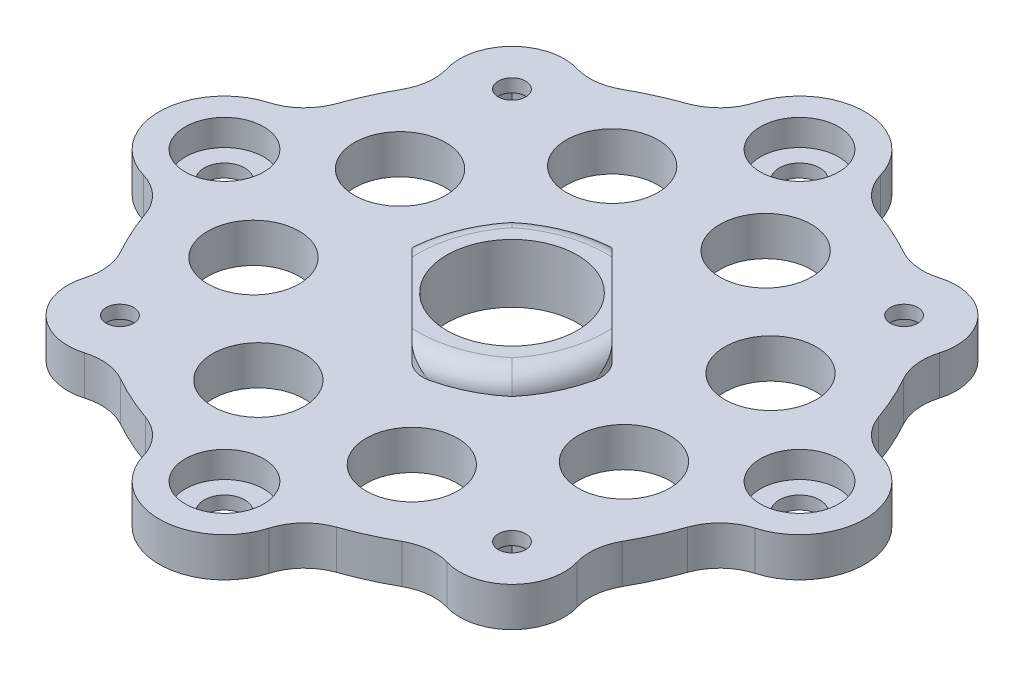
ISO-10303-21;
HEADER;
FILE_DESCRIPTION(('STEP AP214'),'2;1');
FILE_NAME('part.step','',(''),(''),'','','');
FILE_SCHEMA(('AUTOMOTIVE_DESIGN { 1 0 10303 214 1 1 1 1 }'));
ENDSEC;
DATA;
#1=APPLICATION_CONTEXT('core data for automotive mechanical design processes');
#2=APPLICATION_PROTOCOL_DEFINITION('international standard','automotive_design',2000,#1);
#3=PRODUCT_CONTEXT('',#1,'mechanical');
#4=PRODUCT('Part','Part','',(#3));
#5=PRODUCT_RELATED_PRODUCT_CATEGORY('part','',(#4));
#6=PRODUCT_DEFINITION_FORMATION('','',#4);
#7=PRODUCT_DEFINITION_CONTEXT('part definition',#1,'design');
#8=PRODUCT_DEFINITION('design','',#6,#7);
#9=PRODUCT_DEFINITION_SHAPE('','',#8);
#10=(LENGTH_UNIT() NAMED_UNIT(*) SI_UNIT(.MILLI.,.METRE.));
#11=(NAMED_UNIT(*) PLANE_ANGLE_UNIT() SI_UNIT($,.RADIAN.));
#12=(NAMED_UNIT(*) SI_UNIT($,.STERADIAN.) SOLID_ANGLE_UNIT());
#13=UNCERTAINTY_MEASURE_WITH_UNIT(LENGTH_MEASURE(1.E-05),#10,'distance_accuracy_value','');
#14=(GEOMETRIC_REPRESENTATION_CONTEXT(3) GLOBAL_UNCERTAINTY_ASSIGNED_CONTEXT((#13)) GLOBAL_UNIT_ASSIGNED_CONTEXT((#10,
#11,#12)) REPRESENTATION_CONTEXT('',''));
#15=CARTESIAN_POINT('',(0.,0.,0.));
#16=DIRECTION('',(0.,0.,1.));
#17=DIRECTION('',(1.,0.,0.));
#18=AXIS2_PLACEMENT_3D('',#15,#16,#17);
#19=CARTESIAN_POINT('',(15.,3.,15.));
#20=DIRECTION('',(0.,-1.,0.));
#21=DIRECTION('',(0.,0.,-1.));
#22=AXIS2_PLACEMENT_3D('',#19,#20,#21);
#23=CYLINDRICAL_SURFACE('',#22,1.05);
#24=CARTESIAN_POINT('',(15.,3.,15.));
#25=DIRECTION('',(0.,-1.,0.));
#26=DIRECTION('',(0.,0.,-1.));
#27=AXIS2_PLACEMENT_3D('',#24,#25,#26);
#28=CIRCLE('',#27,1.05);
#29=CARTESIAN_POINT('',(15.,3.,13.95));
#30=VERTEX_POINT('',#29);
#31=EDGE_CURVE('E667',#30,#30,#28,.T.);
#32=ORIENTED_EDGE('',*,*,#31,.F.);
#33=EDGE_LOOP('',(#32));
#34=FACE_BOUND('',#33,.T.);
#35=CARTESIAN_POINT('',(15.,2.,15.));
#36=DIRECTION('',(0.,-1.,0.));
#37=DIRECTION('',(0.,0.,-1.));
#38=AXIS2_PLACEMENT_3D('',#35,#36,#37);
#39=CIRCLE('',#38,1.05);
#40=CARTESIAN_POINT('',(15.,2.,13.95));
#41=VERTEX_POINT('',#40);
#42=EDGE_CURVE('E674',#41,#41,#39,.F.);
#43=ORIENTED_EDGE('',*,*,#42,.F.);
#44=EDGE_LOOP('',(#43));
#45=FACE_BOUND('',#44,.T.);
#46=ADVANCED_FACE('F36',(#34,#45),#23,.F.);
#47=CARTESIAN_POINT('',(-15.,3.,15.));
#48=DIRECTION('',(0.,-1.,0.));
#49=DIRECTION('',(0.,0.,-1.));
#50=AXIS2_PLACEMENT_3D('',#47,#48,#49);
#51=CYLINDRICAL_SURFACE('',#50,1.05);
#52=CARTESIAN_POINT('',(-15.,3.,15.));
#53=DIRECTION('',(0.,-1.,0.));
#54=DIRECTION('',(0.,0.,-1.));
#55=AXIS2_PLACEMENT_3D('',#52,#53,#54);
#56=CIRCLE('',#55,1.05);
#57=CARTESIAN_POINT('',(-15.,3.,13.95));
#58=VERTEX_POINT('',#57);
#59=EDGE_CURVE('E664',#58,#58,#56,.T.);
#60=ORIENTED_EDGE('',*,*,#59,.F.);
#61=EDGE_LOOP('',(#60));
#62=FACE_BOUND('',#61,.T.);
#63=CARTESIAN_POINT('',(-15.,2.,15.));
#64=DIRECTION('',(0.,-1.,0.));
#65=DIRECTION('',(0.,0.,-1.));
#66=AXIS2_PLACEMENT_3D('',#63,#64,#65);
#67=CIRCLE('',#66,1.05);
#68=CARTESIAN_POINT('',(-15.,2.,13.95));
#69=VERTEX_POINT('',#68);
#70=EDGE_CURVE('E788',#69,#69,#67,.F.);
#71=ORIENTED_EDGE('',*,*,#70,.F.);
#72=EDGE_LOOP('',(#71));
#73=FACE_BOUND('',#72,.T.);
#74=ADVANCED_FACE('F1194',(#62,#73),#51,.F.);
#75=CARTESIAN_POINT('',(-15.,3.,-15.));
#76=DIRECTION('',(0.,-1.,0.));
#77=DIRECTION('',(0.,0.,-1.));
#78=AXIS2_PLACEMENT_3D('',#75,#76,#77);
#79=CYLINDRICAL_SURFACE('',#78,1.05);
#80=CARTESIAN_POINT('',(-15.,3.,-15.));
#81=DIRECTION('',(0.,-1.,0.));
#82=DIRECTION('',(0.,0.,-1.));
#83=AXIS2_PLACEMENT_3D('',#80,#81,#82);
#84=CIRCLE('',#83,1.05);
#85=CARTESIAN_POINT('',(-15.,3.,-16.05));
#86=VERTEX_POINT('',#85);
#87=EDGE_CURVE('E668',#86,#86,#84,.T.);
#88=ORIENTED_EDGE('',*,*,#87,.F.);
#89=EDGE_LOOP('',(#88));
#90=FACE_BOUND('',#89,.T.);
#91=CARTESIAN_POINT('',(-15.,2.,-15.));
#92=DIRECTION('',(0.,-1.,0.));
#93=DIRECTION('',(0.,0.,-1.));
#94=AXIS2_PLACEMENT_3D('',#91,#92,#93);
#95=CIRCLE('',#94,1.05);
#96=CARTESIAN_POINT('',(-15.,2.,-16.05));
#97=VERTEX_POINT('',#96);
#98=EDGE_CURVE('E785',#97,#97,#95,.F.);
#99=ORIENTED_EDGE('',*,*,#98,.F.);
#100=EDGE_LOOP('',(#99));
#101=FACE_BOUND('',#100,.T.);
#102=ADVANCED_FACE('F1200',(#90,#101),#79,.F.);
#103=CARTESIAN_POINT('',(15.,3.,-15.));
#104=DIRECTION('',(0.,-1.,0.));
#105=DIRECTION('',(0.,0.,-1.));
#106=AXIS2_PLACEMENT_3D('',#103,#104,#105);
#107=CYLINDRICAL_SURFACE('',#106,1.05);
#108=CARTESIAN_POINT('',(15.,3.,-15.));
#109=DIRECTION('',(0.,-1.,0.));
#110=DIRECTION('',(0.,0.,-1.));
#111=AXIS2_PLACEMENT_3D('',#108,#109,#110);
#112=CIRCLE('',#111,1.05);
#113=CARTESIAN_POINT('',(15.,3.,-16.05));
#114=VERTEX_POINT('',#113);
#115=EDGE_CURVE('E671',#114,#114,#112,.T.);
#116=ORIENTED_EDGE('',*,*,#115,.F.);
#117=EDGE_LOOP('',(#116));
#118=FACE_BOUND('',#117,.T.);
#119=CARTESIAN_POINT('',(15.,2.,-15.));
#120=DIRECTION('',(0.,-1.,0.));
#121=DIRECTION('',(0.,0.,-1.));
#122=AXIS2_PLACEMENT_3D('',#119,#120,#121);
#123=CIRCLE('',#122,1.05);
#124=CARTESIAN_POINT('',(15.,2.,-16.05));
#125=VERTEX_POINT('',#124);
#126=EDGE_CURVE('E653',#125,#125,#123,.F.);
#127=ORIENTED_EDGE('',*,*,#126,.F.);
#128=EDGE_LOOP('',(#127));
#129=FACE_BOUND('',#128,.T.);
#130=ADVANCED_FACE('F1207',(#118,#129),#107,.F.);
#131=CARTESIAN_POINT('',(0.,3.,0.));
#132=DIRECTION('',(0.,-1.,0.));
#133=DIRECTION('',(0.,0.,-1.));
#134=AXIS2_PLACEMENT_3D('',#131,#132,#133);
#135=CYLINDRICAL_SURFACE('',#134,22.);
#136=CARTESIAN_POINT('',(0.,3.,0.));
#137=DIRECTION('',(0.,1.,0.));
#138=DIRECTION('',(0.,0.,1.));
#139=AXIS2_PLACEMENT_3D('',#136,#137,#138);
#140=CIRCLE('',#139,22.);
#141=CARTESIAN_POINT('',(7.3100957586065,3.,20.7500000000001));
#142=VERTEX_POINT('',#141);
#143=CARTESIAN_POINT('',(10.7707638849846,3.,19.1830822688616));
#144=VERTEX_POINT('',#143);
#145=EDGE_CURVE('E1430',#142,#144,#140,.T.);
#146=ORIENTED_EDGE('',*,*,#145,.F.);
#147=DIRECTION('',(0.,-1.,0.));
#148=VECTOR('',#147,1.);
#149=CARTESIAN_POINT('',(7.3100957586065,3.,20.7500000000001));
#150=LINE('',#149,#148);
#151=CARTESIAN_POINT('',(7.3100957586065,0.,20.7500000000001));
#152=VERTEX_POINT('',#151);
#153=EDGE_CURVE('E816',#142,#152,#150,.T.);
#154=ORIENTED_EDGE('',*,*,#153,.T.);
#155=CARTESIAN_POINT('',(0.,0.,0.));
#156=DIRECTION('',(0.,1.,0.));
#157=DIRECTION('',(0.,0.,1.));
#158=AXIS2_PLACEMENT_3D('',#155,#156,#157);
#159=CIRCLE('',#158,22.);
#160=CARTESIAN_POINT('',(10.7707638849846,0.,19.1830822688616));
#161=VERTEX_POINT('',#160);
#162=EDGE_CURVE('E1398',#152,#161,#159,.T.);
#163=ORIENTED_EDGE('',*,*,#162,.T.);
#164=DIRECTION('',(0.,-1.,0.));
#165=VECTOR('',#164,1.);
#166=CARTESIAN_POINT('',(10.7707638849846,3.,19.1830822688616));
#167=LINE('',#166,#165);
#168=EDGE_CURVE('E813',#161,#144,#167,.F.);
#169=ORIENTED_EDGE('',*,*,#168,.T.);
#170=EDGE_LOOP('',(#146,#154,#163,#169));
#171=FACE_BOUND('',#170,.T.);
#172=ADVANCED_FACE('F1299',(#171),#135,.T.);
#173=CARTESIAN_POINT('',(-20.75,0.,7.31009575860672));
#174=VERTEX_POINT('',#173);
#175=CARTESIAN_POINT('',(-19.1830822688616,0.,10.7707638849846));
#176=VERTEX_POINT('',#175);
#177=EDGE_CURVE('E768',#174,#176,#159,.T.);
#178=ORIENTED_EDGE('',*,*,#177,.T.);
#179=DIRECTION('',(0.,-1.,0.));
#180=VECTOR('',#179,1.);
#181=CARTESIAN_POINT('',(-19.1830822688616,3.,10.7707638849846));
#182=LINE('',#181,#180);
#183=CARTESIAN_POINT('',(-19.1830822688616,3.,10.7707638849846));
#184=VERTEX_POINT('',#183);
#185=EDGE_CURVE('E796',#176,#184,#182,.F.);
#186=ORIENTED_EDGE('',*,*,#185,.T.);
#187=CARTESIAN_POINT('',(-20.75,3.,7.31009575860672));
#188=VERTEX_POINT('',#187);
#189=EDGE_CURVE('E769',#188,#184,#140,.T.);
#190=ORIENTED_EDGE('',*,*,#189,.F.);
#191=DIRECTION('',(0.,-1.,0.));
#192=VECTOR('',#191,1.);
#193=CARTESIAN_POINT('',(-20.75,3.,7.31009575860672));
#194=LINE('',#193,#192);
#195=EDGE_CURVE('E793',#188,#174,#194,.T.);
#196=ORIENTED_EDGE('',*,*,#195,.T.);
#197=EDGE_LOOP('',(#178,#186,#190,#196));
#198=FACE_BOUND('',#197,.T.);
#199=ADVANCED_FACE('F1414',(#198),#135,.T.);
#200=CARTESIAN_POINT('',(-7.31009575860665,3.,-20.75));
#201=VERTEX_POINT('',#200);
#202=CARTESIAN_POINT('',(-10.7707638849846,3.,-19.1830822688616));
#203=VERTEX_POINT('',#202);
#204=EDGE_CURVE('E767',#201,#203,#140,.T.);
#205=ORIENTED_EDGE('',*,*,#204,.F.);
#206=DIRECTION('',(0.,-1.,0.));
#207=VECTOR('',#206,1.);
#208=CARTESIAN_POINT('',(-7.31009575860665,3.,-20.75));
#209=LINE('',#208,#207);
#210=CARTESIAN_POINT('',(-7.31009575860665,0.,-20.75));
#211=VERTEX_POINT('',#210);
#212=EDGE_CURVE('E856',#201,#211,#209,.T.);
#213=ORIENTED_EDGE('',*,*,#212,.T.);
#214=CARTESIAN_POINT('',(-10.7707638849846,0.,-19.1830822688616));
#215=VERTEX_POINT('',#214);
#216=EDGE_CURVE('E772',#211,#215,#159,.T.);
#217=ORIENTED_EDGE('',*,*,#216,.T.);
#218=DIRECTION('',(0.,-1.,0.));
#219=VECTOR('',#218,1.);
#220=CARTESIAN_POINT('',(-10.7707638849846,3.,-19.1830822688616));
#221=LINE('',#220,#219);
#222=EDGE_CURVE('E853',#215,#203,#221,.F.);
#223=ORIENTED_EDGE('',*,*,#222,.T.);
#224=EDGE_LOOP('',(#205,#213,#217,#223));
#225=FACE_BOUND('',#224,.T.);
#226=ADVANCED_FACE('F1383',(#225),#135,.T.);
#227=CARTESIAN_POINT('',(20.75,3.,-7.31009575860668));
#228=VERTEX_POINT('',#227);
#229=CARTESIAN_POINT('',(19.1830822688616,3.,-10.7707638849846));
#230=VERTEX_POINT('',#229);
#231=EDGE_CURVE('E1435',#228,#230,#140,.T.);
#232=ORIENTED_EDGE('',*,*,#231,.F.);
#233=DIRECTION('',(0.,-1.,0.));
#234=VECTOR('',#233,1.);
#235=CARTESIAN_POINT('',(20.75,3.,-7.31009575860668));
#236=LINE('',#235,#234);
#237=CARTESIAN_POINT('',(20.75,0.,-7.31009575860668));
#238=VERTEX_POINT('',#237);
#239=EDGE_CURVE('E836',#228,#238,#236,.T.);
#240=ORIENTED_EDGE('',*,*,#239,.T.);
#241=CARTESIAN_POINT('',(19.1830822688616,0.,-10.7707638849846));
#242=VERTEX_POINT('',#241);
#243=EDGE_CURVE('E1388',#238,#242,#159,.T.);
#244=ORIENTED_EDGE('',*,*,#243,.T.);
#245=DIRECTION('',(0.,-1.,0.));
#246=VECTOR('',#245,1.);
#247=CARTESIAN_POINT('',(19.1830822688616,3.,-10.7707638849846));
#248=LINE('',#247,#246);
#249=EDGE_CURVE('E833',#242,#230,#248,.F.);
#250=ORIENTED_EDGE('',*,*,#249,.T.);
#251=EDGE_LOOP('',(#232,#240,#244,#250));
#252=FACE_BOUND('',#251,.T.);
#253=ADVANCED_FACE('F1275',(#252),#135,.T.);
#254=CARTESIAN_POINT('',(-2.30284541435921E-13,0.,22.));
#255=DIRECTION('',(0.,1.,0.));
#256=DIRECTION('',(0.,0.,1.));
#257=AXIS2_PLACEMENT_3D('',#254,#255,#256);
#258=CYLINDRICAL_SURFACE('',#257,1.55);
#259=CARTESIAN_POINT('',(-2.30284541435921E-13,0.,22.));
#260=DIRECTION('',(0.,1.,0.));
#261=DIRECTION('',(0.,0.,1.));
#262=AXIS2_PLACEMENT_3D('',#259,#260,#261);
#263=CIRCLE('',#262,1.55);
#264=CARTESIAN_POINT('',(-2.30284541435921E-13,0.,23.55));
#265=VERTEX_POINT('',#264);
#266=EDGE_CURVE('E736',#265,#265,#263,.T.);
#267=ORIENTED_EDGE('',*,*,#266,.F.);
#268=EDGE_LOOP('',(#267));
#269=FACE_BOUND('',#268,.T.);
#270=CARTESIAN_POINT('',(-2.30284541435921E-13,1.,22.));
#271=DIRECTION('',(0.,1.,0.));
#272=DIRECTION('',(0.,0.,1.));
#273=AXIS2_PLACEMENT_3D('',#270,#271,#272);
#274=CIRCLE('',#273,1.55);
#275=CARTESIAN_POINT('',(-2.30284541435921E-13,1.,23.55));
#276=VERTEX_POINT('',#275);
#277=EDGE_CURVE('E739',#276,#276,#274,.F.);
#278=ORIENTED_EDGE('',*,*,#277,.F.);
#279=EDGE_LOOP('',(#278));
#280=FACE_BOUND('',#279,.T.);
#281=ADVANCED_FACE('F1271',(#269,#280),#258,.F.);
#282=CARTESIAN_POINT('',(0.,0.,-22.));
#283=DIRECTION('',(0.,1.,0.));
#284=DIRECTION('',(0.,0.,1.));
#285=AXIS2_PLACEMENT_3D('',#282,#283,#284);
#286=CYLINDRICAL_SURFACE('',#285,1.55);
#287=CARTESIAN_POINT('',(0.,0.,-22.));
#288=DIRECTION('',(0.,1.,0.));
#289=DIRECTION('',(0.,0.,1.));
#290=AXIS2_PLACEMENT_3D('',#287,#288,#289);
#291=CIRCLE('',#290,1.55);
#292=CARTESIAN_POINT('',(0.,0.,-20.45));
#293=VERTEX_POINT('',#292);
#294=EDGE_CURVE('E733',#293,#293,#291,.T.);
#295=ORIENTED_EDGE('',*,*,#294,.F.);
#296=EDGE_LOOP('',(#295));
#297=FACE_BOUND('',#296,.T.);
#298=CARTESIAN_POINT('',(0.,1.,-22.));
#299=DIRECTION('',(0.,1.,0.));
#300=DIRECTION('',(0.,0.,1.));
#301=AXIS2_PLACEMENT_3D('',#298,#299,#300);
#302=CIRCLE('',#301,1.55);
#303=CARTESIAN_POINT('',(0.,1.,-20.45));
#304=VERTEX_POINT('',#303);
#305=EDGE_CURVE('E778',#304,#304,#302,.F.);
#306=ORIENTED_EDGE('',*,*,#305,.F.);
#307=EDGE_LOOP('',(#306));
#308=FACE_BOUND('',#307,.T.);
#309=ADVANCED_FACE('F1267',(#297,#308),#286,.F.);
#310=CARTESIAN_POINT('',(22.,0.,0.));
#311=DIRECTION('',(0.,1.,0.));
#312=DIRECTION('',(0.,0.,1.));
#313=AXIS2_PLACEMENT_3D('',#310,#311,#312);
#314=CYLINDRICAL_SURFACE('',#313,1.55);
#315=CARTESIAN_POINT('',(22.,0.,0.));
#316=DIRECTION('',(0.,1.,0.));
#317=DIRECTION('',(0.,0.,1.));
#318=AXIS2_PLACEMENT_3D('',#315,#316,#317);
#319=CIRCLE('',#318,1.55);
#320=CARTESIAN_POINT('',(22.,0.,1.54999999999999));
#321=VERTEX_POINT('',#320);
#322=EDGE_CURVE('E730',#321,#321,#319,.T.);
#323=ORIENTED_EDGE('',*,*,#322,.F.);
#324=EDGE_LOOP('',(#323));
#325=FACE_BOUND('',#324,.T.);
#326=CARTESIAN_POINT('',(22.,1.,0.));
#327=DIRECTION('',(0.,1.,0.));
#328=DIRECTION('',(0.,0.,1.));
#329=AXIS2_PLACEMENT_3D('',#326,#327,#328);
#330=CIRCLE('',#329,1.55);
#331=CARTESIAN_POINT('',(22.,1.,1.54999999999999));
#332=VERTEX_POINT('',#331);
#333=EDGE_CURVE('E775',#332,#332,#330,.F.);
#334=ORIENTED_EDGE('',*,*,#333,.F.);
#335=EDGE_LOOP('',(#334));
#336=FACE_BOUND('',#335,.T.);
#337=ADVANCED_FACE('F1263',(#325,#336),#314,.F.);
#338=CARTESIAN_POINT('',(-22.,0.,0.));
#339=DIRECTION('',(0.,1.,0.));
#340=DIRECTION('',(0.,0.,1.));
#341=AXIS2_PLACEMENT_3D('',#338,#339,#340);
#342=CYLINDRICAL_SURFACE('',#341,1.55);
#343=CARTESIAN_POINT('',(-22.,0.,0.));
#344=DIRECTION('',(0.,1.,0.));
#345=DIRECTION('',(0.,0.,1.));
#346=AXIS2_PLACEMENT_3D('',#343,#344,#345);
#347=CIRCLE('',#346,1.55);
#348=CARTESIAN_POINT('',(-22.,0.,1.55));
#349=VERTEX_POINT('',#348);
#350=EDGE_CURVE('E726',#349,#349,#347,.T.);
#351=ORIENTED_EDGE('',*,*,#350,.F.);
#352=EDGE_LOOP('',(#351));
#353=FACE_BOUND('',#352,.T.);
#354=CARTESIAN_POINT('',(-22.,1.,0.));
#355=DIRECTION('',(0.,1.,0.));
#356=DIRECTION('',(0.,0.,1.));
#357=AXIS2_PLACEMENT_3D('',#354,#355,#356);
#358=CIRCLE('',#357,1.55);
#359=CARTESIAN_POINT('',(-22.,1.,1.55));
#360=VERTEX_POINT('',#359);
#361=EDGE_CURVE('E705',#360,#360,#358,.F.);
#362=ORIENTED_EDGE('',*,*,#361,.F.);
#363=EDGE_LOOP('',(#362));
#364=FACE_BOUND('',#363,.T.);
#365=ADVANCED_FACE('F1259',(#353,#364),#342,.F.);
#366=CARTESIAN_POINT('',(-10.7707638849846,3.,19.1830822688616));
#367=VERTEX_POINT('',#366);
#368=CARTESIAN_POINT('',(-7.31009575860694,3.,20.7499999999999));
#369=VERTEX_POINT('',#368);
#370=EDGE_CURVE('E1429',#367,#369,#140,.T.);
#371=ORIENTED_EDGE('',*,*,#370,.F.);
#372=DIRECTION('',(0.,-1.,0.));
#373=VECTOR('',#372,1.);
#374=CARTESIAN_POINT('',(-10.7707638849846,3.,19.1830822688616));
#375=LINE('',#374,#373);
#376=CARTESIAN_POINT('',(-10.7707638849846,0.,19.1830822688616));
#377=VERTEX_POINT('',#376);
#378=EDGE_CURVE('E806',#367,#377,#375,.T.);
#379=ORIENTED_EDGE('',*,*,#378,.T.);
#380=CARTESIAN_POINT('',(-7.31009575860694,0.,20.7499999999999));
#381=VERTEX_POINT('',#380);
#382=EDGE_CURVE('E1402',#377,#381,#159,.T.);
#383=ORIENTED_EDGE('',*,*,#382,.T.);
#384=DIRECTION('',(0.,-1.,0.));
#385=VECTOR('',#384,1.);
#386=CARTESIAN_POINT('',(-7.31009575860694,3.,20.7499999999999));
#387=LINE('',#386,#385);
#388=EDGE_CURVE('E803',#381,#369,#387,.F.);
#389=ORIENTED_EDGE('',*,*,#388,.T.);
#390=EDGE_LOOP('',(#371,#379,#383,#389));
#391=FACE_BOUND('',#390,.T.);
#392=ADVANCED_FACE('F1262',(#391),#135,.T.);
#393=CARTESIAN_POINT('',(19.1830822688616,3.,10.7707638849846));
#394=VERTEX_POINT('',#393);
#395=CARTESIAN_POINT('',(20.75,3.,7.31009575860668));
#396=VERTEX_POINT('',#395);
#397=EDGE_CURVE('E1432',#394,#396,#140,.T.);
#398=ORIENTED_EDGE('',*,*,#397,.F.);
#399=DIRECTION('',(0.,-1.,0.));
#400=VECTOR('',#399,1.);
#401=CARTESIAN_POINT('',(19.1830822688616,3.,10.7707638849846));
#402=LINE('',#401,#400);
#403=CARTESIAN_POINT('',(19.1830822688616,0.,10.7707638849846));
#404=VERTEX_POINT('',#403);
#405=EDGE_CURVE('E826',#394,#404,#402,.T.);
#406=ORIENTED_EDGE('',*,*,#405,.T.);
#407=CARTESIAN_POINT('',(20.75,0.,7.31009575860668));
#408=VERTEX_POINT('',#407);
#409=EDGE_CURVE('E1393',#404,#408,#159,.T.);
#410=ORIENTED_EDGE('',*,*,#409,.T.);
#411=DIRECTION('',(0.,-1.,0.));
#412=VECTOR('',#411,1.);
#413=CARTESIAN_POINT('',(20.75,3.,7.31009575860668));
#414=LINE('',#413,#412);
#415=EDGE_CURVE('E823',#408,#396,#414,.F.);
#416=ORIENTED_EDGE('',*,*,#415,.T.);
#417=EDGE_LOOP('',(#398,#406,#410,#416));
#418=FACE_BOUND('',#417,.T.);
#419=ADVANCED_FACE('F1456',(#418),#135,.T.);
#420=CARTESIAN_POINT('',(10.7707638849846,3.,-19.1830822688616));
#421=VERTEX_POINT('',#420);
#422=CARTESIAN_POINT('',(7.31009575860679,3.,-20.75));
#423=VERTEX_POINT('',#422);
#424=EDGE_CURVE('E1438',#421,#423,#140,.T.);
#425=ORIENTED_EDGE('',*,*,#424,.F.);
#426=DIRECTION('',(0.,-1.,0.));
#427=VECTOR('',#426,1.);
#428=CARTESIAN_POINT('',(10.7707638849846,3.,-19.1830822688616));
#429=LINE('',#428,#427);
#430=CARTESIAN_POINT('',(10.7707638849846,0.,-19.1830822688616));
#431=VERTEX_POINT('',#430);
#432=EDGE_CURVE('E846',#421,#431,#429,.T.);
#433=ORIENTED_EDGE('',*,*,#432,.T.);
#434=CARTESIAN_POINT('',(7.31009575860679,0.,-20.75));
#435=VERTEX_POINT('',#434);
#436=EDGE_CURVE('E1386',#431,#435,#159,.T.);
#437=ORIENTED_EDGE('',*,*,#436,.T.);
#438=DIRECTION('',(0.,-1.,0.));
#439=VECTOR('',#438,1.);
#440=CARTESIAN_POINT('',(7.3100957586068,3.,-20.75));
#441=LINE('',#440,#439);
#442=EDGE_CURVE('E843',#435,#423,#441,.F.);
#443=ORIENTED_EDGE('',*,*,#442,.T.);
#444=EDGE_LOOP('',(#425,#433,#437,#443));
#445=FACE_BOUND('',#444,.T.);
#446=ADVANCED_FACE('F1297',(#445),#135,.T.);
#447=CARTESIAN_POINT('',(-19.1830822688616,3.,-10.7707638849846));
#448=VERTEX_POINT('',#447);
#449=CARTESIAN_POINT('',(-20.75,3.,-7.31009575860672));
#450=VERTEX_POINT('',#449);
#451=EDGE_CURVE('E764',#448,#450,#140,.T.);
#452=ORIENTED_EDGE('',*,*,#451,.F.);
#453=DIRECTION('',(0.,-1.,0.));
#454=VECTOR('',#453,1.);
#455=CARTESIAN_POINT('',(-19.1830822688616,3.,-10.7707638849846));
#456=LINE('',#455,#454);
#457=CARTESIAN_POINT('',(-19.1830822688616,0.,-10.7707638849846));
#458=VERTEX_POINT('',#457);
#459=EDGE_CURVE('E866',#448,#458,#456,.T.);
#460=ORIENTED_EDGE('',*,*,#459,.T.);
#461=CARTESIAN_POINT('',(-20.75,0.,-7.31009575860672));
#462=VERTEX_POINT('',#461);
#463=EDGE_CURVE('E761',#458,#462,#159,.T.);
#464=ORIENTED_EDGE('',*,*,#463,.T.);
#465=DIRECTION('',(0.,-1.,0.));
#466=VECTOR('',#465,1.);
#467=CARTESIAN_POINT('',(-20.75,3.,-7.31009575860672));
#468=LINE('',#467,#466);
#469=EDGE_CURVE('E863',#462,#450,#468,.F.);
#470=ORIENTED_EDGE('',*,*,#469,.T.);
#471=EDGE_LOOP('',(#452,#460,#464,#470));
#472=FACE_BOUND('',#471,.T.);
#473=ADVANCED_FACE('F1178',(#472),#135,.T.);
#474=CARTESIAN_POINT('',(0.,3.,0.));
#475=DIRECTION('',(0.,1.,0.));
#476=DIRECTION('',(0.,0.,1.));
#477=AXIS2_PLACEMENT_3D('',#474,#475,#476);
#478=PLANE('',#477);
#479=CARTESIAN_POINT('',(5.42021525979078,3.,-13.9864672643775));
#480=DIRECTION('',(0.,1.,0.));
#481=DIRECTION('',(0.,0.,1.));
#482=AXIS2_PLACEMENT_3D('',#479,#480,#481);
#483=CIRCLE('',#482,3.50000000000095);
#484=CARTESIAN_POINT('',(5.42021525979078,3.,-10.4864672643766));
#485=VERTEX_POINT('',#484);
#486=EDGE_CURVE('E1025',#485,#485,#483,.T.);
#487=ORIENTED_EDGE('',*,*,#486,.F.);
#488=EDGE_LOOP('',(#487));
#489=FACE_BOUND('',#488,.T.);
#490=CARTESIAN_POINT('',(-6.05725488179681,3.,-13.7225968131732));
#491=DIRECTION('',(0.,1.,0.));
#492=DIRECTION('',(0.,0.,1.));
#493=AXIS2_PLACEMENT_3D('',#490,#491,#492);
#494=CIRCLE('',#493,3.50000000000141);
#495=CARTESIAN_POINT('',(-6.05725488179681,3.,-10.2225968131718));
#496=VERTEX_POINT('',#495);
#497=EDGE_CURVE('E1129',#496,#496,#494,.T.);
#498=ORIENTED_EDGE('',*,*,#497,.F.);
#499=EDGE_LOOP('',(#498));
#500=FACE_BOUND('',#499,.T.);
#501=CARTESIAN_POINT('',(-13.9864672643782,3.,-5.42021525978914));
#502=DIRECTION('',(0.,1.,0.));
#503=DIRECTION('',(0.,0.,1.));
#504=AXIS2_PLACEMENT_3D('',#501,#502,#503);
#505=CIRCLE('',#504,3.50000000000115);
#506=CARTESIAN_POINT('',(-13.9864672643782,3.,-1.92021525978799));
#507=VERTEX_POINT('',#506);
#508=EDGE_CURVE('E1135',#507,#507,#505,.T.);
#509=ORIENTED_EDGE('',*,*,#508,.F.);
#510=EDGE_LOOP('',(#509));
#511=FACE_BOUND('',#510,.T.);
#512=CARTESIAN_POINT('',(-13.7225968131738,3.,6.05725488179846));
#513=DIRECTION('',(0.,1.,0.));
#514=DIRECTION('',(0.,0.,1.));
#515=AXIS2_PLACEMENT_3D('',#512,#513,#514);
#516=CIRCLE('',#515,3.50000000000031);
#517=CARTESIAN_POINT('',(-13.7225968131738,3.,9.55725488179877));
#518=VERTEX_POINT('',#517);
#519=EDGE_CURVE('E1141',#518,#518,#516,.T.);
#520=ORIENTED_EDGE('',*,*,#519,.F.);
#521=EDGE_LOOP('',(#520));
#522=FACE_BOUND('',#521,.T.);
#523=CARTESIAN_POINT('',(-5.42021525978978,3.,13.9864672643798));
#524=DIRECTION('',(0.,1.,0.));
#525=DIRECTION('',(0.,0.,1.));
#526=AXIS2_PLACEMENT_3D('',#523,#524,#525);
#527=CIRCLE('',#526,3.49999999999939);
#528=CARTESIAN_POINT('',(-5.42021525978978,3.,17.4864672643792));
#529=VERTEX_POINT('',#528);
#530=EDGE_CURVE('E1147',#529,#529,#527,.T.);
#531=ORIENTED_EDGE('',*,*,#530,.F.);
#532=EDGE_LOOP('',(#531));
#533=FACE_BOUND('',#532,.T.);
#534=CARTESIAN_POINT('',(6.05725488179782,3.,13.7225968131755));
#535=DIRECTION('',(0.,1.,0.));
#536=DIRECTION('',(0.,0.,1.));
#537=AXIS2_PLACEMENT_3D('',#534,#535,#536);
#538=CIRCLE('',#537,3.49999999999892);
#539=CARTESIAN_POINT('',(6.05725488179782,3.,17.2225968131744));
#540=VERTEX_POINT('',#539);
#541=EDGE_CURVE('E1153',#540,#540,#538,.T.);
#542=ORIENTED_EDGE('',*,*,#541,.F.);
#543=EDGE_LOOP('',(#542));
#544=FACE_BOUND('',#543,.T.);
#545=CARTESIAN_POINT('',(13.9864672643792,3.,5.42021525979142));
#546=DIRECTION('',(0.,1.,0.));
#547=DIRECTION('',(0.,0.,1.));
#548=AXIS2_PLACEMENT_3D('',#545,#546,#547);
#549=CIRCLE('',#548,3.49999999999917);
#550=CARTESIAN_POINT('',(13.9864672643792,3.,8.9202152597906));
#551=VERTEX_POINT('',#550);
#552=EDGE_CURVE('E1159',#551,#551,#549,.T.);
#553=ORIENTED_EDGE('',*,*,#552,.F.);
#554=EDGE_LOOP('',(#553));
#555=FACE_BOUND('',#554,.T.);
#556=CARTESIAN_POINT('',(13.7225968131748,3.,-6.05725488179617));
#557=DIRECTION('',(0.,1.,0.));
#558=DIRECTION('',(0.,0.,1.));
#559=AXIS2_PLACEMENT_3D('',#556,#557,#558);
#560=CIRCLE('',#559,3.5);
#561=CARTESIAN_POINT('',(13.7225968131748,3.,-2.55725488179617));
#562=VERTEX_POINT('',#561);
#563=EDGE_CURVE('E1118',#562,#562,#560,.T.);
#564=ORIENTED_EDGE('',*,*,#563,.F.);
#565=EDGE_LOOP('',(#564));
#566=FACE_BOUND('',#565,.T.);
#567=DIRECTION('',(-0.707106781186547,0.,-0.707106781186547));
#568=VECTOR('',#567,1.);
#569=CARTESIAN_POINT('',(0.,3.,-7.65));
#570=LINE('',#569,#568);
#571=CARTESIAN_POINT('',(6.92985998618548,3.,-0.720140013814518));
#572=VERTEX_POINT('',#571);
#573=CARTESIAN_POINT('',(0.720140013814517,3.,-6.92985998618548));
#574=VERTEX_POINT('',#573);
#575=EDGE_CURVE('E1105',#572,#574,#570,.T.);
#576=ORIENTED_EDGE('',*,*,#575,.F.);
#577=CARTESIAN_POINT('',(5.51564642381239,3.,0.694073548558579));
#578=DIRECTION('',(0.,1.,0.));
#579=DIRECTION('',(0.,0.,1.));
#580=AXIS2_PLACEMENT_3D('',#577,#578,#579);
#581=CIRCLE('',#580,2.);
#582=CARTESIAN_POINT('',(7.46885973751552,3.,1.12414069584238));
#583=VERTEX_POINT('',#582);
#584=EDGE_CURVE('E958',#572,#583,#581,.F.);
#585=ORIENTED_EDGE('',*,*,#584,.T.);
#586=CARTESIAN_POINT('',(-2.29720683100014,3.,-1.02619504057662));
#587=DIRECTION('',(0.,1.,0.));
#588=DIRECTION('',(0.,0.,1.));
#589=AXIS2_PLACEMENT_3D('',#586,#587,#588);
#590=CIRCLE('',#589,10.);
#591=CARTESIAN_POINT('',(5.38075121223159,3.,5.38075121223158));
#592=VERTEX_POINT('',#591);
#593=EDGE_CURVE('E942',#583,#592,#590,.F.);
#594=ORIENTED_EDGE('',*,*,#593,.T.);
#595=CARTESIAN_POINT('',(-1.02619504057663,3.,-2.29720683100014));
#596=DIRECTION('',(0.,1.,0.));
#597=DIRECTION('',(0.,0.,1.));
#598=AXIS2_PLACEMENT_3D('',#595,#596,#597);
#599=CIRCLE('',#598,10.);
#600=CARTESIAN_POINT('',(1.12414069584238,3.,7.46885973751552));
#601=VERTEX_POINT('',#600);
#602=EDGE_CURVE('E944',#592,#601,#599,.F.);
#603=ORIENTED_EDGE('',*,*,#602,.T.);
#604=CARTESIAN_POINT('',(0.694073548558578,3.,5.51564642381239));
#605=DIRECTION('',(0.,1.,0.));
#606=DIRECTION('',(0.,0.,1.));
#607=AXIS2_PLACEMENT_3D('',#604,#605,#606);
#608=CIRCLE('',#607,2.);
#609=CARTESIAN_POINT('',(-0.720140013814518,3.,6.92985998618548));
#610=VERTEX_POINT('',#609);
#611=EDGE_CURVE('E964',#601,#610,#608,.F.);
#612=ORIENTED_EDGE('',*,*,#611,.T.);
#613=DIRECTION('',(0.707106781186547,0.,0.707106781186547));
#614=VECTOR('',#613,1.);
#615=CARTESIAN_POINT('',(-7.65,3.,0.));
#616=LINE('',#615,#614);
#617=CARTESIAN_POINT('',(-6.92985998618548,3.,0.720140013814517));
#618=VERTEX_POINT('',#617);
#619=EDGE_CURVE('E488',#618,#610,#616,.T.);
#620=ORIENTED_EDGE('',*,*,#619,.F.);
#621=CARTESIAN_POINT('',(-5.51564642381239,3.,-0.694073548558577));
#622=DIRECTION('',(0.,1.,0.));
#623=DIRECTION('',(0.,0.,1.));
#624=AXIS2_PLACEMENT_3D('',#621,#622,#623);
#625=CIRCLE('',#624,2.);
#626=CARTESIAN_POINT('',(-7.46885973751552,3.,-1.12414069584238));
#627=VERTEX_POINT('',#626);
#628=EDGE_CURVE('E961',#618,#627,#625,.F.);
#629=ORIENTED_EDGE('',*,*,#628,.T.);
#630=CARTESIAN_POINT('',(2.29720683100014,3.,1.02619504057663));
#631=DIRECTION('',(0.,1.,0.));
#632=DIRECTION('',(0.,0.,1.));
#633=AXIS2_PLACEMENT_3D('',#630,#631,#632);
#634=CIRCLE('',#633,10.);
#635=CARTESIAN_POINT('',(-5.38075121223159,3.,-5.38075121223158));
#636=VERTEX_POINT('',#635);
#637=EDGE_CURVE('E940',#627,#636,#634,.F.);
#638=ORIENTED_EDGE('',*,*,#637,.T.);
#639=CARTESIAN_POINT('',(1.02619504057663,3.,2.29720683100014));
#640=DIRECTION('',(0.,1.,0.));
#641=DIRECTION('',(0.,0.,1.));
#642=AXIS2_PLACEMENT_3D('',#639,#640,#641);
#643=CIRCLE('',#642,10.);
#644=CARTESIAN_POINT('',(-1.12414069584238,3.,-7.46885973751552));
#645=VERTEX_POINT('',#644);
#646=EDGE_CURVE('E937',#636,#645,#643,.F.);
#647=ORIENTED_EDGE('',*,*,#646,.T.);
#648=CARTESIAN_POINT('',(-0.694073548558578,3.,-5.51564642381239));
#649=DIRECTION('',(0.,1.,0.));
#650=DIRECTION('',(0.,0.,1.));
#651=AXIS2_PLACEMENT_3D('',#648,#649,#650);
#652=CIRCLE('',#651,2.);
#653=EDGE_CURVE('E956',#645,#574,#652,.F.);
#654=ORIENTED_EDGE('',*,*,#653,.T.);
#655=EDGE_LOOP('',(#576,#585,#594,#603,#612,#620,#629,#638,#647,#654));
#656=FACE_BOUND('',#655,.T.);
#657=ORIENTED_EDGE('',*,*,#115,.T.);
#658=EDGE_LOOP('',(#657));
#659=FACE_BOUND('',#658,.T.);
#660=ORIENTED_EDGE('',*,*,#87,.T.);
#661=EDGE_LOOP('',(#660));
#662=FACE_BOUND('',#661,.T.);
#663=ORIENTED_EDGE('',*,*,#59,.T.);
#664=EDGE_LOOP('',(#663));
#665=FACE_BOUND('',#664,.T.);
#666=ORIENTED_EDGE('',*,*,#31,.T.);
#667=EDGE_LOOP('',(#666));
#668=FACE_BOUND('',#667,.T.);
#669=CARTESIAN_POINT('',(-2.30284541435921E-13,3.,22.));
#670=DIRECTION('',(0.,1.,0.));
#671=DIRECTION('',(0.,0.,1.));
#672=AXIS2_PLACEMENT_3D('',#669,#670,#671);
#673=CIRCLE('',#672,5.);
#674=CARTESIAN_POINT('',(-4.79955782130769,3.,23.4015151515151));
#675=VERTEX_POINT('',#674);
#676=CARTESIAN_POINT('',(4.7995578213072,3.,23.4015151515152));
#677=VERTEX_POINT('',#676);
#678=EDGE_CURVE('E729',#675,#677,#673,.T.);
#679=ORIENTED_EDGE('',*,*,#678,.T.);
#680=CARTESIAN_POINT('',(8.63920407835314,3.,24.5227272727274));
#681=DIRECTION('',(0.,1.,0.));
#682=DIRECTION('',(0.,0.,1.));
#683=AXIS2_PLACEMENT_3D('',#680,#681,#682);
#684=CIRCLE('',#683,4.);
#685=EDGE_CURVE('E887',#677,#142,#684,.F.);
#686=ORIENTED_EDGE('',*,*,#685,.T.);
#687=ORIENTED_EDGE('',*,*,#145,.T.);
#688=CARTESIAN_POINT('',(12.7290845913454,3.,22.6709154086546));
#689=DIRECTION('',(0.,1.,0.));
#690=DIRECTION('',(0.,0.,1.));
#691=AXIS2_PLACEMENT_3D('',#688,#689,#690);
#692=CIRCLE('',#691,4.);
#693=CARTESIAN_POINT('',(13.8645422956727,3.,18.8354577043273));
#694=VERTEX_POINT('',#693);
#695=EDGE_CURVE('E889',#144,#694,#692,.F.);
#696=ORIENTED_EDGE('',*,*,#695,.T.);
#697=CARTESIAN_POINT('',(15.,3.,15.));
#698=DIRECTION('',(0.,-1.,0.));
#699=DIRECTION('',(0.,0.,-1.));
#700=AXIS2_PLACEMENT_3D('',#697,#698,#699);
#701=CIRCLE('',#700,4.);
#702=CARTESIAN_POINT('',(18.8354577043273,3.,13.8645422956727));
#703=VERTEX_POINT('',#702);
#704=EDGE_CURVE('E678',#703,#694,#701,.T.);
#705=ORIENTED_EDGE('',*,*,#704,.F.);
#706=CARTESIAN_POINT('',(22.6709154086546,3.,12.7290845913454));
#707=DIRECTION('',(0.,1.,0.));
#708=DIRECTION('',(0.,0.,1.));
#709=AXIS2_PLACEMENT_3D('',#706,#707,#708);
#710=CIRCLE('',#709,4.);
#711=EDGE_CURVE('E895',#703,#394,#710,.F.);
#712=ORIENTED_EDGE('',*,*,#711,.T.);
#713=ORIENTED_EDGE('',*,*,#397,.T.);
#714=CARTESIAN_POINT('',(24.5227272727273,3.,8.63920407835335));
#715=DIRECTION('',(0.,1.,0.));
#716=DIRECTION('',(0.,0.,1.));
#717=AXIS2_PLACEMENT_3D('',#714,#715,#716);
#718=CIRCLE('',#717,4.);
#719=CARTESIAN_POINT('',(23.4015151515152,3.,4.7995578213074));
#720=VERTEX_POINT('',#719);
#721=EDGE_CURVE('E897',#396,#720,#718,.F.);
#722=ORIENTED_EDGE('',*,*,#721,.T.);
#723=CARTESIAN_POINT('',(22.,3.,0.));
#724=DIRECTION('',(0.,1.,0.));
#725=DIRECTION('',(0.,0.,1.));
#726=AXIS2_PLACEMENT_3D('',#723,#724,#725);
#727=CIRCLE('',#726,4.99999999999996);
#728=CARTESIAN_POINT('',(23.4015151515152,3.,-4.7995578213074));
#729=VERTEX_POINT('',#728);
#730=EDGE_CURVE('E743',#720,#729,#727,.T.);
#731=ORIENTED_EDGE('',*,*,#730,.T.);
#732=CARTESIAN_POINT('',(24.5227272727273,3.,-8.63920407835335));
#733=DIRECTION('',(0.,1.,0.));
#734=DIRECTION('',(0.,0.,1.));
#735=AXIS2_PLACEMENT_3D('',#732,#733,#734);
#736=CIRCLE('',#735,4.);
#737=EDGE_CURVE('E903',#729,#228,#736,.F.);
#738=ORIENTED_EDGE('',*,*,#737,.T.);
#739=ORIENTED_EDGE('',*,*,#231,.T.);
#740=CARTESIAN_POINT('',(22.6709154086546,3.,-12.7290845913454));
#741=DIRECTION('',(0.,1.,0.));
#742=DIRECTION('',(0.,0.,1.));
#743=AXIS2_PLACEMENT_3D('',#740,#741,#742);
#744=CIRCLE('',#743,4.);
#745=CARTESIAN_POINT('',(18.8354577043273,3.,-13.8645422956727));
#746=VERTEX_POINT('',#745);
#747=EDGE_CURVE('E905',#230,#746,#744,.F.);
#748=ORIENTED_EDGE('',*,*,#747,.T.);
#749=CARTESIAN_POINT('',(15.,3.,-15.));
#750=DIRECTION('',(0.,-1.,0.));
#751=DIRECTION('',(0.,0.,-1.));
#752=AXIS2_PLACEMENT_3D('',#749,#750,#751);
#753=CIRCLE('',#752,4.);
#754=CARTESIAN_POINT('',(13.8645422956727,3.,-18.8354577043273));
#755=VERTEX_POINT('',#754);
#756=EDGE_CURVE('E696',#755,#746,#753,.T.);
#757=ORIENTED_EDGE('',*,*,#756,.F.);
#758=CARTESIAN_POINT('',(12.7290845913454,3.,-22.6709154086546));
#759=DIRECTION('',(0.,1.,0.));
#760=DIRECTION('',(0.,0.,1.));
#761=AXIS2_PLACEMENT_3D('',#758,#759,#760);
#762=CIRCLE('',#761,4.);
#763=EDGE_CURVE('E911',#755,#421,#762,.F.);
#764=ORIENTED_EDGE('',*,*,#763,.T.);
#765=ORIENTED_EDGE('',*,*,#424,.T.);
#766=CARTESIAN_POINT('',(8.63920407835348,3.,-24.5227272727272));
#767=DIRECTION('',(0.,1.,0.));
#768=DIRECTION('',(0.,0.,1.));
#769=AXIS2_PLACEMENT_3D('',#766,#767,#768);
#770=CIRCLE('',#769,4.);
#771=CARTESIAN_POINT('',(4.79955782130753,3.,-23.4015151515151));
#772=VERTEX_POINT('',#771);
#773=EDGE_CURVE('E913',#423,#772,#770,.F.);
#774=ORIENTED_EDGE('',*,*,#773,.T.);
#775=CARTESIAN_POINT('',(0.,3.,-22.));
#776=DIRECTION('',(0.,1.,0.));
#777=DIRECTION('',(0.,0.,1.));
#778=AXIS2_PLACEMENT_3D('',#775,#776,#777);
#779=CIRCLE('',#778,5.);
#780=CARTESIAN_POINT('',(-4.79955782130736,3.,-23.4015151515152));
#781=VERTEX_POINT('',#780);
#782=EDGE_CURVE('E749',#772,#781,#779,.T.);
#783=ORIENTED_EDGE('',*,*,#782,.T.);
#784=CARTESIAN_POINT('',(-8.63920407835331,3.,-24.5227272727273));
#785=DIRECTION('',(0.,1.,0.));
#786=DIRECTION('',(0.,0.,1.));
#787=AXIS2_PLACEMENT_3D('',#784,#785,#786);
#788=CIRCLE('',#787,4.);
#789=EDGE_CURVE('E919',#781,#201,#788,.F.);
#790=ORIENTED_EDGE('',*,*,#789,.T.);
#791=ORIENTED_EDGE('',*,*,#204,.T.);
#792=CARTESIAN_POINT('',(-12.7290845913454,3.,-22.6709154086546));
#793=DIRECTION('',(0.,1.,0.));
#794=DIRECTION('',(0.,0.,1.));
#795=AXIS2_PLACEMENT_3D('',#792,#793,#794);
#796=CIRCLE('',#795,4.);
#797=CARTESIAN_POINT('',(-13.8645422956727,3.,-18.8354577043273));
#798=VERTEX_POINT('',#797);
#799=EDGE_CURVE('E921',#203,#798,#796,.F.);
#800=ORIENTED_EDGE('',*,*,#799,.T.);
#801=CARTESIAN_POINT('',(-15.,3.,-15.));
#802=DIRECTION('',(0.,-1.,0.));
#803=DIRECTION('',(0.,0.,-1.));
#804=AXIS2_PLACEMENT_3D('',#801,#802,#803);
#805=CIRCLE('',#804,4.);
#806=CARTESIAN_POINT('',(-18.8354577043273,3.,-13.8645422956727));
#807=VERTEX_POINT('',#806);
#808=EDGE_CURVE('E690',#807,#798,#805,.T.);
#809=ORIENTED_EDGE('',*,*,#808,.F.);
#810=CARTESIAN_POINT('',(-22.6709154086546,3.,-12.7290845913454));
#811=DIRECTION('',(0.,1.,0.));
#812=DIRECTION('',(0.,0.,1.));
#813=AXIS2_PLACEMENT_3D('',#810,#811,#812);
#814=CIRCLE('',#813,4.);
#815=EDGE_CURVE('E927',#807,#448,#814,.F.);
#816=ORIENTED_EDGE('',*,*,#815,.T.);
#817=ORIENTED_EDGE('',*,*,#451,.T.);
#818=CARTESIAN_POINT('',(-24.5227272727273,3.,-8.6392040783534));
#819=DIRECTION('',(0.,1.,0.));
#820=DIRECTION('',(0.,0.,1.));
#821=AXIS2_PLACEMENT_3D('',#818,#819,#820);
#822=CIRCLE('',#821,4.);
#823=CARTESIAN_POINT('',(-23.4015151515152,3.,-4.79955782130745));
#824=VERTEX_POINT('',#823);
#825=EDGE_CURVE('E929',#450,#824,#822,.F.);
#826=ORIENTED_EDGE('',*,*,#825,.T.);
#827=CARTESIAN_POINT('',(-22.,3.,0.));
#828=DIRECTION('',(0.,1.,0.));
#829=DIRECTION('',(0.,0.,1.));
#830=AXIS2_PLACEMENT_3D('',#827,#828,#829);
#831=CIRCLE('',#830,5.);
#832=CARTESIAN_POINT('',(-23.4015151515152,3.,4.79955782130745));
#833=VERTEX_POINT('',#832);
#834=EDGE_CURVE('E755',#824,#833,#831,.T.);
#835=ORIENTED_EDGE('',*,*,#834,.T.);
#836=CARTESIAN_POINT('',(-24.5227272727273,3.,8.6392040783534));
#837=DIRECTION('',(0.,1.,0.));
#838=DIRECTION('',(0.,0.,1.));
#839=AXIS2_PLACEMENT_3D('',#836,#837,#838);
#840=CIRCLE('',#839,4.);
#841=EDGE_CURVE('E935',#833,#188,#840,.F.);
#842=ORIENTED_EDGE('',*,*,#841,.T.);
#843=ORIENTED_EDGE('',*,*,#189,.T.);
#844=CARTESIAN_POINT('',(-22.6709154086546,3.,12.7290845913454));
#845=DIRECTION('',(0.,1.,0.));
#846=DIRECTION('',(0.,0.,1.));
#847=AXIS2_PLACEMENT_3D('',#844,#845,#846);
#848=CIRCLE('',#847,4.);
#849=CARTESIAN_POINT('',(-18.8354577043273,3.,13.8645422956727));
#850=VERTEX_POINT('',#849);
#851=EDGE_CURVE('E873',#184,#850,#848,.F.);
#852=ORIENTED_EDGE('',*,*,#851,.T.);
#853=CARTESIAN_POINT('',(-15.,3.,15.));
#854=DIRECTION('',(0.,-1.,0.));
#855=DIRECTION('',(0.,0.,-1.));
#856=AXIS2_PLACEMENT_3D('',#853,#854,#855);
#857=CIRCLE('',#856,4.);
#858=CARTESIAN_POINT('',(-13.8645422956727,3.,18.8354577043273));
#859=VERTEX_POINT('',#858);
#860=EDGE_CURVE('E684',#859,#850,#857,.T.);
#861=ORIENTED_EDGE('',*,*,#860,.F.);
#862=CARTESIAN_POINT('',(-12.7290845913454,3.,22.6709154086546));
#863=DIRECTION('',(0.,1.,0.));
#864=DIRECTION('',(0.,0.,1.));
#865=AXIS2_PLACEMENT_3D('',#862,#863,#864);
#866=CIRCLE('',#865,4.);
#867=EDGE_CURVE('E879',#859,#367,#866,.F.);
#868=ORIENTED_EDGE('',*,*,#867,.T.);
#869=ORIENTED_EDGE('',*,*,#370,.T.);
#870=CARTESIAN_POINT('',(-8.63920407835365,3.,24.5227272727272));
#871=DIRECTION('',(0.,1.,0.));
#872=DIRECTION('',(0.,0.,1.));
#873=AXIS2_PLACEMENT_3D('',#870,#871,#872);
#874=CIRCLE('',#873,4.);
#875=EDGE_CURVE('E881',#369,#675,#874,.F.);
#876=ORIENTED_EDGE('',*,*,#875,.T.);
#877=EDGE_LOOP('',(#679,#686,#687,#696,#705,#712,#713,#722,#731,#738,#739,#748,#757,#764,#765,
#774,#783,#790,#791,#800,#809,#816,#817,#826,#835,#842,#843,#852,#861,#868,#869,#876));
#878=FACE_BOUND('',#877,.T.);
#879=CARTESIAN_POINT('',(0.,3.,-22.));
#880=DIRECTION('',(0.,1.,0.));
#881=DIRECTION('',(0.,0.,1.));
#882=AXIS2_PLACEMENT_3D('',#879,#880,#881);
#883=CIRCLE('',#882,3.);
#884=CARTESIAN_POINT('',(0.,3.,-19.));
#885=VERTEX_POINT('',#884);
#886=EDGE_CURVE('E706',#885,#885,#883,.T.);
#887=ORIENTED_EDGE('',*,*,#886,.F.);
#888=EDGE_LOOP('',(#887));
#889=FACE_BOUND('',#888,.T.);
#890=CARTESIAN_POINT('',(22.,3.,0.));
#891=DIRECTION('',(0.,1.,0.));
#892=DIRECTION('',(0.,0.,1.));
#893=AXIS2_PLACEMENT_3D('',#890,#891,#892);
#894=CIRCLE('',#893,3.);
#895=CARTESIAN_POINT('',(22.,3.,2.99999999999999));
#896=VERTEX_POINT('',#895);
#897=EDGE_CURVE('E712',#896,#896,#894,.T.);
#898=ORIENTED_EDGE('',*,*,#897,.F.);
#899=EDGE_LOOP('',(#898));
#900=FACE_BOUND('',#899,.T.);
#901=CARTESIAN_POINT('',(-22.,3.,0.));
#902=DIRECTION('',(0.,1.,0.));
#903=DIRECTION('',(0.,0.,1.));
#904=AXIS2_PLACEMENT_3D('',#901,#902,#903);
#905=CIRCLE('',#904,3.);
#906=CARTESIAN_POINT('',(-22.,3.,3.));
#907=VERTEX_POINT('',#906);
#908=EDGE_CURVE('E718',#907,#907,#905,.T.);
#909=ORIENTED_EDGE('',*,*,#908,.F.);
#910=EDGE_LOOP('',(#909));
#911=FACE_BOUND('',#910,.T.);
#912=CARTESIAN_POINT('',(-2.30284541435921E-13,3.,22.));
#913=DIRECTION('',(0.,1.,0.));
#914=DIRECTION('',(0.,0.,1.));
#915=AXIS2_PLACEMENT_3D('',#912,#913,#914);
#916=CIRCLE('',#915,3.);
#917=CARTESIAN_POINT('',(-2.30284541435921E-13,3.,25.));
#918=VERTEX_POINT('',#917);
#919=EDGE_CURVE('E699',#918,#918,#916,.T.);
#920=ORIENTED_EDGE('',*,*,#919,.F.);
#921=EDGE_LOOP('',(#920));
#922=FACE_BOUND('',#921,.T.);
#923=ADVANCED_FACE('F1088',(#489,#500,#511,#522,#533,#544,#555,#566,#656,#659,#662,#665,#668,
#878,#889,#900,#911,#922),#478,.T.);
#924=CARTESIAN_POINT('',(0.,0.,0.));
#925=DIRECTION('',(0.,1.,0.));
#926=DIRECTION('',(0.,0.,1.));
#927=AXIS2_PLACEMENT_3D('',#924,#925,#926);
#928=PLANE('',#927);
#929=CARTESIAN_POINT('',(5.42021525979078,0.,-13.9864672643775));
#930=DIRECTION('',(0.,1.,0.));
#931=DIRECTION('',(0.,0.,1.));
#932=AXIS2_PLACEMENT_3D('',#929,#930,#931);
#933=CIRCLE('',#932,3.50000000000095);
#934=CARTESIAN_POINT('',(5.42021525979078,0.,-10.4864672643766));
#935=VERTEX_POINT('',#934);
#936=EDGE_CURVE('E1126',#935,#935,#933,.T.);
#937=ORIENTED_EDGE('',*,*,#936,.T.);
#938=EDGE_LOOP('',(#937));
#939=FACE_BOUND('',#938,.T.);
#940=CARTESIAN_POINT('',(-6.05725488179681,0.,-13.7225968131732));
#941=DIRECTION('',(0.,1.,0.));
#942=DIRECTION('',(0.,0.,1.));
#943=AXIS2_PLACEMENT_3D('',#940,#941,#942);
#944=CIRCLE('',#943,3.50000000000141);
#945=CARTESIAN_POINT('',(-6.05725488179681,0.,-10.2225968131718));
#946=VERTEX_POINT('',#945);
#947=EDGE_CURVE('E1132',#946,#946,#944,.T.);
#948=ORIENTED_EDGE('',*,*,#947,.T.);
#949=EDGE_LOOP('',(#948));
#950=FACE_BOUND('',#949,.T.);
#951=CARTESIAN_POINT('',(-13.9864672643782,0.,-5.42021525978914));
#952=DIRECTION('',(0.,1.,0.));
#953=DIRECTION('',(0.,0.,1.));
#954=AXIS2_PLACEMENT_3D('',#951,#952,#953);
#955=CIRCLE('',#954,3.50000000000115);
#956=CARTESIAN_POINT('',(-13.9864672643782,0.,-1.92021525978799));
#957=VERTEX_POINT('',#956);
#958=EDGE_CURVE('E1138',#957,#957,#955,.T.);
#959=ORIENTED_EDGE('',*,*,#958,.T.);
#960=EDGE_LOOP('',(#959));
#961=FACE_BOUND('',#960,.T.);
#962=CARTESIAN_POINT('',(-13.7225968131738,0.,6.05725488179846));
#963=DIRECTION('',(0.,1.,0.));
#964=DIRECTION('',(0.,0.,1.));
#965=AXIS2_PLACEMENT_3D('',#962,#963,#964);
#966=CIRCLE('',#965,3.50000000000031);
#967=CARTESIAN_POINT('',(-13.7225968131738,0.,9.55725488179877));
#968=VERTEX_POINT('',#967);
#969=EDGE_CURVE('E1144',#968,#968,#966,.T.);
#970=ORIENTED_EDGE('',*,*,#969,.T.);
#971=EDGE_LOOP('',(#970));
#972=FACE_BOUND('',#971,.T.);
#973=CARTESIAN_POINT('',(-5.42021525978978,0.,13.9864672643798));
#974=DIRECTION('',(0.,1.,0.));
#975=DIRECTION('',(0.,0.,1.));
#976=AXIS2_PLACEMENT_3D('',#973,#974,#975);
#977=CIRCLE('',#976,3.49999999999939);
#978=CARTESIAN_POINT('',(-5.42021525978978,0.,17.4864672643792));
#979=VERTEX_POINT('',#978);
#980=EDGE_CURVE('E1150',#979,#979,#977,.T.);
#981=ORIENTED_EDGE('',*,*,#980,.T.);
#982=EDGE_LOOP('',(#981));
#983=FACE_BOUND('',#982,.T.);
#984=CARTESIAN_POINT('',(6.05725488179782,0.,13.7225968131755));
#985=DIRECTION('',(0.,1.,0.));
#986=DIRECTION('',(0.,0.,1.));
#987=AXIS2_PLACEMENT_3D('',#984,#985,#986);
#988=CIRCLE('',#987,3.49999999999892);
#989=CARTESIAN_POINT('',(6.05725488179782,0.,17.2225968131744));
#990=VERTEX_POINT('',#989);
#991=EDGE_CURVE('E1156',#990,#990,#988,.T.);
#992=ORIENTED_EDGE('',*,*,#991,.T.);
#993=EDGE_LOOP('',(#992));
#994=FACE_BOUND('',#993,.T.);
#995=CARTESIAN_POINT('',(13.9864672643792,0.,5.42021525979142));
#996=DIRECTION('',(0.,1.,0.));
#997=DIRECTION('',(0.,0.,1.));
#998=AXIS2_PLACEMENT_3D('',#995,#996,#997);
#999=CIRCLE('',#998,3.49999999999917);
#1000=CARTESIAN_POINT('',(13.9864672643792,0.,8.9202152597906));
#1001=VERTEX_POINT('',#1000);
#1002=EDGE_CURVE('E1121',#1001,#1001,#999,.T.);
#1003=ORIENTED_EDGE('',*,*,#1002,.T.);
#1004=EDGE_LOOP('',(#1003));
#1005=FACE_BOUND('',#1004,.T.);
#1006=CARTESIAN_POINT('',(13.7225968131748,0.,-6.05725488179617));
#1007=DIRECTION('',(0.,1.,0.));
#1008=DIRECTION('',(0.,0.,1.));
#1009=AXIS2_PLACEMENT_3D('',#1006,#1007,#1008);
#1010=CIRCLE('',#1009,3.5);
#1011=CARTESIAN_POINT('',(13.7225968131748,0.,-2.55725488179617));
#1012=VERTEX_POINT('',#1011);
#1013=EDGE_CURVE('E1116',#1012,#1012,#1010,.T.);
#1014=ORIENTED_EDGE('',*,*,#1013,.T.);
#1015=EDGE_LOOP('',(#1014));
#1016=FACE_BOUND('',#1015,.T.);
#1017=CARTESIAN_POINT('',(0.,0.,0.));
#1018=DIRECTION('',(0.,1.,0.));
#1019=DIRECTION('',(0.,0.,1.));
#1020=AXIS2_PLACEMENT_3D('',#1017,#1018,#1019);
#1021=CIRCLE('',#1020,5.);
#1022=CARTESIAN_POINT('',(0.,0.,5.));
#1023=VERTEX_POINT('',#1022);
#1024=EDGE_CURVE('E1107',#1023,#1023,#1021,.T.);
#1025=ORIENTED_EDGE('',*,*,#1024,.T.);
#1026=EDGE_LOOP('',(#1025));
#1027=FACE_BOUND('',#1026,.T.);
#1028=DIRECTION('',(-0.258819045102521,0.,-0.965925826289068));
#1029=VECTOR('',#1028,1.);
#1030=CARTESIAN_POINT('',(13.3670068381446,0.,-13.3670068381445));
#1031=LINE('',#1030,#1029);
#1032=CARTESIAN_POINT('',(13.3670068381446,0.,-13.3670068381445));
#1033=VERTEX_POINT('',#1032);
#1034=CARTESIAN_POINT('',(12.7692898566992,0.,-15.5977169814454));
#1035=VERTEX_POINT('',#1034);
#1036=EDGE_CURVE('E590',#1033,#1035,#1031,.T.);
#1037=ORIENTED_EDGE('',*,*,#1036,.F.);
#1038=DIRECTION('',(-0.965925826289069,0.,-0.25881904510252));
#1039=VECTOR('',#1038,1.);
#1040=CARTESIAN_POINT('',(15.5977169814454,0.,-12.7692898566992));
#1041=LINE('',#1040,#1039);
#1042=CARTESIAN_POINT('',(15.5977169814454,0.,-12.7692898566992));
#1043=VERTEX_POINT('',#1042);
#1044=EDGE_CURVE('E588',#1043,#1033,#1041,.T.);
#1045=ORIENTED_EDGE('',*,*,#1044,.F.);
#1046=DIRECTION('',(-0.707106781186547,0.,0.707106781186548));
#1047=VECTOR('',#1046,1.);
#1048=CARTESIAN_POINT('',(17.2307101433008,0.,-14.4022830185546));
#1049=LINE('',#1048,#1047);
#1050=CARTESIAN_POINT('',(17.2307101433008,0.,-14.4022830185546));
#1051=VERTEX_POINT('',#1050);
#1052=EDGE_CURVE('E572',#1051,#1043,#1049,.T.);
#1053=ORIENTED_EDGE('',*,*,#1052,.F.);
#1054=DIRECTION('',(0.258819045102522,0.,0.965925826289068));
#1055=VECTOR('',#1054,1.);
#1056=CARTESIAN_POINT('',(16.6329931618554,0.,-16.6329931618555));
#1057=LINE('',#1056,#1055);
#1058=CARTESIAN_POINT('',(16.6329931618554,0.,-16.6329931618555));
#1059=VERTEX_POINT('',#1058);
#1060=EDGE_CURVE('E600',#1059,#1051,#1057,.T.);
#1061=ORIENTED_EDGE('',*,*,#1060,.F.);
#1062=DIRECTION('',(0.965925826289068,0.,0.258819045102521));
#1063=VECTOR('',#1062,1.);
#1064=CARTESIAN_POINT('',(14.4022830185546,0.,-17.2307101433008));
#1065=LINE('',#1064,#1063);
#1066=CARTESIAN_POINT('',(14.4022830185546,0.,-17.2307101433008));
#1067=VERTEX_POINT('',#1066);
#1068=EDGE_CURVE('E597',#1067,#1059,#1065,.T.);
#1069=ORIENTED_EDGE('',*,*,#1068,.F.);
#1070=DIRECTION('',(0.707106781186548,0.,-0.707106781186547));
#1071=VECTOR('',#1070,1.);
#1072=CARTESIAN_POINT('',(12.7692898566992,0.,-15.5977169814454));
#1073=LINE('',#1072,#1071);
#1074=EDGE_CURVE('E594',#1035,#1067,#1073,.T.);
#1075=ORIENTED_EDGE('',*,*,#1074,.F.);
#1076=EDGE_LOOP('',(#1037,#1045,#1053,#1061,#1069,#1075));
#1077=FACE_BOUND('',#1076,.T.);
#1078=DIRECTION('',(0.25881904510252,0.,0.965925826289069));
#1079=VECTOR('',#1078,1.);
#1080=CARTESIAN_POINT('',(-13.3670068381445,0.,13.3670068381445));
#1081=LINE('',#1080,#1079);
#1082=CARTESIAN_POINT('',(-13.3670068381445,0.,13.3670068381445));
#1083=VERTEX_POINT('',#1082);
#1084=CARTESIAN_POINT('',(-12.7692898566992,0.,15.5977169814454));
#1085=VERTEX_POINT('',#1084);
#1086=EDGE_CURVE('E542',#1083,#1085,#1081,.T.);
#1087=ORIENTED_EDGE('',*,*,#1086,.F.);
#1088=DIRECTION('',(0.965925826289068,0.,0.258819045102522));
#1089=VECTOR('',#1088,1.);
#1090=CARTESIAN_POINT('',(-15.5977169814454,0.,12.7692898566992));
#1091=LINE('',#1090,#1089);
#1092=CARTESIAN_POINT('',(-15.5977169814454,0.,12.7692898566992));
#1093=VERTEX_POINT('',#1092);
#1094=EDGE_CURVE('E540',#1093,#1083,#1091,.T.);
#1095=ORIENTED_EDGE('',*,*,#1094,.F.);
#1096=DIRECTION('',(0.707106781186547,0.,-0.707106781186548));
#1097=VECTOR('',#1096,1.);
#1098=CARTESIAN_POINT('',(-17.2307101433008,0.,14.4022830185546));
#1099=LINE('',#1098,#1097);
#1100=CARTESIAN_POINT('',(-17.2307101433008,0.,14.4022830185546));
#1101=VERTEX_POINT('',#1100);
#1102=EDGE_CURVE('E524',#1101,#1093,#1099,.T.);
#1103=ORIENTED_EDGE('',*,*,#1102,.F.);
#1104=DIRECTION('',(-0.25881904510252,0.,-0.965925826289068));
#1105=VECTOR('',#1104,1.);
#1106=CARTESIAN_POINT('',(-16.6329931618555,0.,16.6329931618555));
#1107=LINE('',#1106,#1105);
#1108=CARTESIAN_POINT('',(-16.6329931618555,0.,16.6329931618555));
#1109=VERTEX_POINT('',#1108);
#1110=EDGE_CURVE('E552',#1109,#1101,#1107,.T.);
#1111=ORIENTED_EDGE('',*,*,#1110,.F.);
#1112=DIRECTION('',(-0.965925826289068,0.,-0.258819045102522));
#1113=VECTOR('',#1112,1.);
#1114=CARTESIAN_POINT('',(-14.4022830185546,0.,17.2307101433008));
#1115=LINE('',#1114,#1113);
#1116=CARTESIAN_POINT('',(-14.4022830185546,0.,17.2307101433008));
#1117=VERTEX_POINT('',#1116);
#1118=EDGE_CURVE('E549',#1117,#1109,#1115,.T.);
#1119=ORIENTED_EDGE('',*,*,#1118,.F.);
#1120=DIRECTION('',(-0.707106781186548,0.,0.707106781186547));
#1121=VECTOR('',#1120,1.);
#1122=CARTESIAN_POINT('',(-12.7692898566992,0.,15.5977169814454));
#1123=LINE('',#1122,#1121);
#1124=EDGE_CURVE('E546',#1085,#1117,#1123,.T.);
#1125=ORIENTED_EDGE('',*,*,#1124,.F.);
#1126=EDGE_LOOP('',(#1087,#1095,#1103,#1111,#1119,#1125));
#1127=FACE_BOUND('',#1126,.T.);
#1128=DIRECTION('',(-0.96592582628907,0.,0.258819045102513));
#1129=VECTOR('',#1128,1.);
#1130=CARTESIAN_POINT('',(-13.3670068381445,0.,-13.3670068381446));
#1131=LINE('',#1130,#1129);
#1132=CARTESIAN_POINT('',(-13.3670068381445,0.,-13.3670068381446));
#1133=VERTEX_POINT('',#1132);
#1134=CARTESIAN_POINT('',(-15.5977169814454,0.,-12.7692898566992));
#1135=VERTEX_POINT('',#1134);
#1136=EDGE_CURVE('E499',#1133,#1135,#1131,.T.);
#1137=ORIENTED_EDGE('',*,*,#1136,.F.);
#1138=DIRECTION('',(-0.258819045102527,0.,0.965925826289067));
#1139=VECTOR('',#1138,1.);
#1140=CARTESIAN_POINT('',(-12.7692898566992,0.,-15.5977169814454));
#1141=LINE('',#1140,#1139);
#1142=CARTESIAN_POINT('',(-12.7692898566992,0.,-15.5977169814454));
#1143=VERTEX_POINT('',#1142);
#1144=EDGE_CURVE('E463',#1143,#1133,#1141,.T.);
#1145=ORIENTED_EDGE('',*,*,#1144,.F.);
#1146=DIRECTION('',(0.707106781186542,0.,0.707106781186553));
#1147=VECTOR('',#1146,1.);
#1148=CARTESIAN_POINT('',(-14.4022830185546,0.,-17.2307101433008));
#1149=LINE('',#1148,#1147);
#1150=CARTESIAN_POINT('',(-14.4022830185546,0.,-17.2307101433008));
#1151=VERTEX_POINT('',#1150);
#1152=EDGE_CURVE('E482',#1151,#1143,#1149,.T.);
#1153=ORIENTED_EDGE('',*,*,#1152,.F.);
#1154=DIRECTION('',(0.96592582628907,0.,-0.258819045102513));
#1155=VECTOR('',#1154,1.);
#1156=CARTESIAN_POINT('',(-16.6329931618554,0.,-16.6329931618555));
#1157=LINE('',#1156,#1155);
#1158=CARTESIAN_POINT('',(-16.6329931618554,0.,-16.6329931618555));
#1159=VERTEX_POINT('',#1158);
#1160=EDGE_CURVE('E485',#1159,#1151,#1157,.T.);
#1161=ORIENTED_EDGE('',*,*,#1160,.F.);
#1162=DIRECTION('',(0.258819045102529,0.,-0.965925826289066));
#1163=VECTOR('',#1162,1.);
#1164=CARTESIAN_POINT('',(-17.2307101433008,0.,-14.4022830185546));
#1165=LINE('',#1164,#1163);
#1166=CARTESIAN_POINT('',(-17.2307101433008,0.,-14.4022830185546));
#1167=VERTEX_POINT('',#1166);
#1168=EDGE_CURVE('E505',#1167,#1159,#1165,.T.);
#1169=ORIENTED_EDGE('',*,*,#1168,.F.);
#1170=DIRECTION('',(-0.707106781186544,0.,-0.707106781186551));
#1171=VECTOR('',#1170,1.);
#1172=CARTESIAN_POINT('',(-15.5977169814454,0.,-12.7692898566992));
#1173=LINE('',#1172,#1171);
#1174=EDGE_CURVE('E502',#1135,#1167,#1173,.T.);
#1175=ORIENTED_EDGE('',*,*,#1174,.F.);
#1176=EDGE_LOOP('',(#1137,#1145,#1153,#1161,#1169,#1175));
#1177=FACE_BOUND('',#1176,.T.);
#1178=DIRECTION('',(-0.965925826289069,0.,0.258819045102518));
#1179=VECTOR('',#1178,1.);
#1180=CARTESIAN_POINT('',(16.6329931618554,0.,16.6329931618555));
#1181=LINE('',#1180,#1179);
#1182=CARTESIAN_POINT('',(16.6329931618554,0.,16.6329931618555));
#1183=VERTEX_POINT('',#1182);
#1184=CARTESIAN_POINT('',(14.4022830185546,0.,17.2307101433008));
#1185=VERTEX_POINT('',#1184);
#1186=EDGE_CURVE('E637',#1183,#1185,#1181,.T.);
#1187=ORIENTED_EDGE('',*,*,#1186,.F.);
#1188=DIRECTION('',(-0.258819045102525,0.,0.965925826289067));
#1189=VECTOR('',#1188,1.);
#1190=CARTESIAN_POINT('',(17.2307101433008,0.,14.4022830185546));
#1191=LINE('',#1190,#1189);
#1192=CARTESIAN_POINT('',(17.2307101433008,0.,14.4022830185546));
#1193=VERTEX_POINT('',#1192);
#1194=EDGE_CURVE('E512',#1193,#1183,#1191,.T.);
#1195=ORIENTED_EDGE('',*,*,#1194,.F.);
#1196=DIRECTION('',(0.707106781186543,0.,0.707106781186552));
#1197=VECTOR('',#1196,1.);
#1198=CARTESIAN_POINT('',(15.5977169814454,0.,12.7692898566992));
#1199=LINE('',#1198,#1197);
#1200=CARTESIAN_POINT('',(15.5977169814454,0.,12.7692898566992));
#1201=VERTEX_POINT('',#1200);
#1202=EDGE_CURVE('E620',#1201,#1193,#1199,.T.);
#1203=ORIENTED_EDGE('',*,*,#1202,.F.);
#1204=DIRECTION('',(0.965925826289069,0.,-0.258819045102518));
#1205=VECTOR('',#1204,1.);
#1206=CARTESIAN_POINT('',(13.3670068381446,0.,13.3670068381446));
#1207=LINE('',#1206,#1205);
#1208=CARTESIAN_POINT('',(13.3670068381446,0.,13.3670068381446));
#1209=VERTEX_POINT('',#1208);
#1210=EDGE_CURVE('E646',#1209,#1201,#1207,.T.);
#1211=ORIENTED_EDGE('',*,*,#1210,.F.);
#1212=DIRECTION('',(0.258819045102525,0.,-0.965925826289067));
#1213=VECTOR('',#1212,1.);
#1214=CARTESIAN_POINT('',(12.7692898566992,0.,15.5977169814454));
#1215=LINE('',#1214,#1213);
#1216=CARTESIAN_POINT('',(12.7692898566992,0.,15.5977169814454));
#1217=VERTEX_POINT('',#1216);
#1218=EDGE_CURVE('E643',#1217,#1209,#1215,.T.);
#1219=ORIENTED_EDGE('',*,*,#1218,.F.);
#1220=DIRECTION('',(-0.707106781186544,0.,-0.707106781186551));
#1221=VECTOR('',#1220,1.);
#1222=CARTESIAN_POINT('',(14.4022830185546,0.,17.2307101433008));
#1223=LINE('',#1222,#1221);
#1224=EDGE_CURVE('E640',#1185,#1217,#1223,.T.);
#1225=ORIENTED_EDGE('',*,*,#1224,.F.);
#1226=EDGE_LOOP('',(#1187,#1195,#1203,#1211,#1219,#1225));
#1227=FACE_BOUND('',#1226,.T.);
#1228=ORIENTED_EDGE('',*,*,#350,.T.);
#1229=EDGE_LOOP('',(#1228));
#1230=FACE_BOUND('',#1229,.T.);
#1231=ORIENTED_EDGE('',*,*,#322,.T.);
#1232=EDGE_LOOP('',(#1231));
#1233=FACE_BOUND('',#1232,.T.);
#1234=ORIENTED_EDGE('',*,*,#294,.T.);
#1235=EDGE_LOOP('',(#1234));
#1236=FACE_BOUND('',#1235,.T.);
#1237=ORIENTED_EDGE('',*,*,#266,.T.);
#1238=EDGE_LOOP('',(#1237));
#1239=FACE_BOUND('',#1238,.T.);
#1240=ORIENTED_EDGE('',*,*,#409,.F.);
#1241=CARTESIAN_POINT('',(22.6709154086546,0.,12.7290845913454));
#1242=DIRECTION('',(0.,1.,0.));
#1243=DIRECTION('',(0.,0.,1.));
#1244=AXIS2_PLACEMENT_3D('',#1241,#1242,#1243);
#1245=CIRCLE('',#1244,4.);
#1246=CARTESIAN_POINT('',(18.8354577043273,0.,13.8645422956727));
#1247=VERTEX_POINT('',#1246);
#1248=EDGE_CURVE('E893',#404,#1247,#1245,.T.);
#1249=ORIENTED_EDGE('',*,*,#1248,.T.);
#1250=CARTESIAN_POINT('',(15.,0.,15.));
#1251=DIRECTION('',(0.,-1.,0.));
#1252=DIRECTION('',(0.,0.,-1.));
#1253=AXIS2_PLACEMENT_3D('',#1250,#1251,#1252);
#1254=CIRCLE('',#1253,4.);
#1255=CARTESIAN_POINT('',(13.8645422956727,0.,18.8354577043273));
#1256=VERTEX_POINT('',#1255);
#1257=EDGE_CURVE('E677',#1247,#1256,#1254,.T.);
#1258=ORIENTED_EDGE('',*,*,#1257,.T.);
#1259=CARTESIAN_POINT('',(12.7290845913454,0.,22.6709154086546));
#1260=DIRECTION('',(0.,1.,0.));
#1261=DIRECTION('',(0.,0.,1.));
#1262=AXIS2_PLACEMENT_3D('',#1259,#1260,#1261);
#1263=CIRCLE('',#1262,4.);
#1264=EDGE_CURVE('E891',#1256,#161,#1263,.T.);
#1265=ORIENTED_EDGE('',*,*,#1264,.T.);
#1266=ORIENTED_EDGE('',*,*,#162,.F.);
#1267=CARTESIAN_POINT('',(8.63920407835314,0.,24.5227272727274));
#1268=DIRECTION('',(0.,1.,0.));
#1269=DIRECTION('',(0.,0.,1.));
#1270=AXIS2_PLACEMENT_3D('',#1267,#1268,#1269);
#1271=CIRCLE('',#1270,4.);
#1272=CARTESIAN_POINT('',(4.7995578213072,0.,23.4015151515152));
#1273=VERTEX_POINT('',#1272);
#1274=EDGE_CURVE('E885',#152,#1273,#1271,.T.);
#1275=ORIENTED_EDGE('',*,*,#1274,.T.);
#1276=CARTESIAN_POINT('',(-2.30284541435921E-13,0.,22.));
#1277=DIRECTION('',(0.,1.,0.));
#1278=DIRECTION('',(0.,0.,1.));
#1279=AXIS2_PLACEMENT_3D('',#1276,#1277,#1278);
#1280=CIRCLE('',#1279,5.);
#1281=CARTESIAN_POINT('',(-4.79955782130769,0.,23.4015151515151));
#1282=VERTEX_POINT('',#1281);
#1283=EDGE_CURVE('E740',#1282,#1273,#1280,.T.);
#1284=ORIENTED_EDGE('',*,*,#1283,.F.);
#1285=CARTESIAN_POINT('',(-8.63920407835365,0.,24.5227272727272));
#1286=DIRECTION('',(0.,1.,0.));
#1287=DIRECTION('',(0.,0.,1.));
#1288=AXIS2_PLACEMENT_3D('',#1285,#1286,#1287);
#1289=CIRCLE('',#1288,4.);
#1290=EDGE_CURVE('E883',#1282,#381,#1289,.T.);
#1291=ORIENTED_EDGE('',*,*,#1290,.T.);
#1292=ORIENTED_EDGE('',*,*,#382,.F.);
#1293=CARTESIAN_POINT('',(-12.7290845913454,0.,22.6709154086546));
#1294=DIRECTION('',(0.,1.,0.));
#1295=DIRECTION('',(0.,0.,1.));
#1296=AXIS2_PLACEMENT_3D('',#1293,#1294,#1295);
#1297=CIRCLE('',#1296,4.);
#1298=CARTESIAN_POINT('',(-13.8645422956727,0.,18.8354577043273));
#1299=VERTEX_POINT('',#1298);
#1300=EDGE_CURVE('E877',#377,#1299,#1297,.T.);
#1301=ORIENTED_EDGE('',*,*,#1300,.T.);
#1302=CARTESIAN_POINT('',(-15.,0.,15.));
#1303=DIRECTION('',(0.,-1.,0.));
#1304=DIRECTION('',(0.,0.,-1.));
#1305=AXIS2_PLACEMENT_3D('',#1302,#1303,#1304);
#1306=CIRCLE('',#1305,4.);
#1307=CARTESIAN_POINT('',(-18.8354577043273,0.,13.8645422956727));
#1308=VERTEX_POINT('',#1307);
#1309=EDGE_CURVE('E681',#1299,#1308,#1306,.T.);
#1310=ORIENTED_EDGE('',*,*,#1309,.T.);
#1311=CARTESIAN_POINT('',(-22.6709154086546,0.,12.7290845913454));
#1312=DIRECTION('',(0.,1.,0.));
#1313=DIRECTION('',(0.,0.,1.));
#1314=AXIS2_PLACEMENT_3D('',#1311,#1312,#1313);
#1315=CIRCLE('',#1314,4.);
#1316=EDGE_CURVE('E875',#1308,#176,#1315,.T.);
#1317=ORIENTED_EDGE('',*,*,#1316,.T.);
#1318=ORIENTED_EDGE('',*,*,#177,.F.);
#1319=CARTESIAN_POINT('',(-24.5227272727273,0.,8.6392040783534));
#1320=DIRECTION('',(0.,1.,0.));
#1321=DIRECTION('',(0.,0.,1.));
#1322=AXIS2_PLACEMENT_3D('',#1319,#1320,#1321);
#1323=CIRCLE('',#1322,4.);
#1324=CARTESIAN_POINT('',(-23.4015151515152,0.,4.79955782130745));
#1325=VERTEX_POINT('',#1324);
#1326=EDGE_CURVE('E933',#174,#1325,#1323,.T.);
#1327=ORIENTED_EDGE('',*,*,#1326,.T.);
#1328=CARTESIAN_POINT('',(-22.,0.,0.));
#1329=DIRECTION('',(0.,1.,0.));
#1330=DIRECTION('',(0.,0.,1.));
#1331=AXIS2_PLACEMENT_3D('',#1328,#1329,#1330);
#1332=CIRCLE('',#1331,5.);
#1333=CARTESIAN_POINT('',(-23.4015151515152,0.,-4.79955782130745));
#1334=VERTEX_POINT('',#1333);
#1335=EDGE_CURVE('E758',#1334,#1325,#1332,.T.);
#1336=ORIENTED_EDGE('',*,*,#1335,.F.);
#1337=CARTESIAN_POINT('',(-24.5227272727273,0.,-8.6392040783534));
#1338=DIRECTION('',(0.,1.,0.));
#1339=DIRECTION('',(0.,0.,1.));
#1340=AXIS2_PLACEMENT_3D('',#1337,#1338,#1339);
#1341=CIRCLE('',#1340,4.);
#1342=EDGE_CURVE('E931',#1334,#462,#1341,.T.);
#1343=ORIENTED_EDGE('',*,*,#1342,.T.);
#1344=ORIENTED_EDGE('',*,*,#463,.F.);
#1345=CARTESIAN_POINT('',(-22.6709154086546,0.,-12.7290845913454));
#1346=DIRECTION('',(0.,1.,0.));
#1347=DIRECTION('',(0.,0.,1.));
#1348=AXIS2_PLACEMENT_3D('',#1345,#1346,#1347);
#1349=CIRCLE('',#1348,4.);
#1350=CARTESIAN_POINT('',(-18.8354577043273,0.,-13.8645422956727));
#1351=VERTEX_POINT('',#1350);
#1352=EDGE_CURVE('E925',#458,#1351,#1349,.T.);
#1353=ORIENTED_EDGE('',*,*,#1352,.T.);
#1354=CARTESIAN_POINT('',(-15.,0.,-15.));
#1355=DIRECTION('',(0.,-1.,0.));
#1356=DIRECTION('',(0.,0.,-1.));
#1357=AXIS2_PLACEMENT_3D('',#1354,#1355,#1356);
#1358=CIRCLE('',#1357,4.);
#1359=CARTESIAN_POINT('',(-13.8645422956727,0.,-18.8354577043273));
#1360=VERTEX_POINT('',#1359);
#1361=EDGE_CURVE('E687',#1351,#1360,#1358,.T.);
#1362=ORIENTED_EDGE('',*,*,#1361,.T.);
#1363=CARTESIAN_POINT('',(-12.7290845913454,0.,-22.6709154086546));
#1364=DIRECTION('',(0.,1.,0.));
#1365=DIRECTION('',(0.,0.,1.));
#1366=AXIS2_PLACEMENT_3D('',#1363,#1364,#1365);
#1367=CIRCLE('',#1366,4.);
#1368=EDGE_CURVE('E923',#1360,#215,#1367,.T.);
#1369=ORIENTED_EDGE('',*,*,#1368,.T.);
#1370=ORIENTED_EDGE('',*,*,#216,.F.);
#1371=CARTESIAN_POINT('',(-8.63920407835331,0.,-24.5227272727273));
#1372=DIRECTION('',(0.,1.,0.));
#1373=DIRECTION('',(0.,0.,1.));
#1374=AXIS2_PLACEMENT_3D('',#1371,#1372,#1373);
#1375=CIRCLE('',#1374,4.);
#1376=CARTESIAN_POINT('',(-4.79955782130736,0.,-23.4015151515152));
#1377=VERTEX_POINT('',#1376);
#1378=EDGE_CURVE('E917',#211,#1377,#1375,.T.);
#1379=ORIENTED_EDGE('',*,*,#1378,.T.);
#1380=CARTESIAN_POINT('',(0.,0.,-22.));
#1381=DIRECTION('',(0.,1.,0.));
#1382=DIRECTION('',(0.,0.,1.));
#1383=AXIS2_PLACEMENT_3D('',#1380,#1381,#1382);
#1384=CIRCLE('',#1383,5.);
#1385=CARTESIAN_POINT('',(4.79955782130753,0.,-23.4015151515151));
#1386=VERTEX_POINT('',#1385);
#1387=EDGE_CURVE('E752',#1386,#1377,#1384,.T.);
#1388=ORIENTED_EDGE('',*,*,#1387,.F.);
#1389=CARTESIAN_POINT('',(8.63920407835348,0.,-24.5227272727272));
#1390=DIRECTION('',(0.,1.,0.));
#1391=DIRECTION('',(0.,0.,1.));
#1392=AXIS2_PLACEMENT_3D('',#1389,#1390,#1391);
#1393=CIRCLE('',#1392,4.);
#1394=EDGE_CURVE('E915',#1386,#435,#1393,.T.);
#1395=ORIENTED_EDGE('',*,*,#1394,.T.);
#1396=ORIENTED_EDGE('',*,*,#436,.F.);
#1397=CARTESIAN_POINT('',(12.7290845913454,0.,-22.6709154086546));
#1398=DIRECTION('',(0.,1.,0.));
#1399=DIRECTION('',(0.,0.,1.));
#1400=AXIS2_PLACEMENT_3D('',#1397,#1398,#1399);
#1401=CIRCLE('',#1400,4.);
#1402=CARTESIAN_POINT('',(13.8645422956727,0.,-18.8354577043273));
#1403=VERTEX_POINT('',#1402);
#1404=EDGE_CURVE('E909',#431,#1403,#1401,.T.);
#1405=ORIENTED_EDGE('',*,*,#1404,.T.);
#1406=CARTESIAN_POINT('',(15.,0.,-15.));
#1407=DIRECTION('',(0.,-1.,0.));
#1408=DIRECTION('',(0.,0.,-1.));
#1409=AXIS2_PLACEMENT_3D('',#1406,#1407,#1408);
#1410=CIRCLE('',#1409,4.);
#1411=CARTESIAN_POINT('',(18.8354577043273,0.,-13.8645422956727));
#1412=VERTEX_POINT('',#1411);
#1413=EDGE_CURVE('E693',#1403,#1412,#1410,.T.);
#1414=ORIENTED_EDGE('',*,*,#1413,.T.);
#1415=CARTESIAN_POINT('',(22.6709154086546,0.,-12.7290845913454));
#1416=DIRECTION('',(0.,1.,0.));
#1417=DIRECTION('',(0.,0.,1.));
#1418=AXIS2_PLACEMENT_3D('',#1415,#1416,#1417);
#1419=CIRCLE('',#1418,4.);
#1420=EDGE_CURVE('E907',#1412,#242,#1419,.T.);
#1421=ORIENTED_EDGE('',*,*,#1420,.T.);
#1422=ORIENTED_EDGE('',*,*,#243,.F.);
#1423=CARTESIAN_POINT('',(24.5227272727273,0.,-8.63920407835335));
#1424=DIRECTION('',(0.,1.,0.));
#1425=DIRECTION('',(0.,0.,1.));
#1426=AXIS2_PLACEMENT_3D('',#1423,#1424,#1425);
#1427=CIRCLE('',#1426,4.);
#1428=CARTESIAN_POINT('',(23.4015151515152,0.,-4.7995578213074));
#1429=VERTEX_POINT('',#1428);
#1430=EDGE_CURVE('E901',#238,#1429,#1427,.T.);
#1431=ORIENTED_EDGE('',*,*,#1430,.T.);
#1432=CARTESIAN_POINT('',(22.,0.,0.));
#1433=DIRECTION('',(0.,1.,0.));
#1434=DIRECTION('',(0.,0.,1.));
#1435=AXIS2_PLACEMENT_3D('',#1432,#1433,#1434);
#1436=CIRCLE('',#1435,4.99999999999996);
#1437=CARTESIAN_POINT('',(23.4015151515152,0.,4.7995578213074));
#1438=VERTEX_POINT('',#1437);
#1439=EDGE_CURVE('E746',#1438,#1429,#1436,.T.);
#1440=ORIENTED_EDGE('',*,*,#1439,.F.);
#1441=CARTESIAN_POINT('',(24.5227272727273,0.,8.63920407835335));
#1442=DIRECTION('',(0.,1.,0.));
#1443=DIRECTION('',(0.,0.,1.));
#1444=AXIS2_PLACEMENT_3D('',#1441,#1442,#1443);
#1445=CIRCLE('',#1444,4.);
#1446=EDGE_CURVE('E899',#1438,#408,#1445,.T.);
#1447=ORIENTED_EDGE('',*,*,#1446,.T.);
#1448=EDGE_LOOP('',(#1240,#1249,#1258,#1265,#1266,#1275,#1284,#1291,#1292,#1301,#1310,#1317,
#1318,#1327,#1336,#1343,#1344,#1353,#1362,#1369,#1370,#1379,#1388,#1395,#1396,#1405,#1414,#1421,
#1422,#1431,#1440,#1447));
#1449=FACE_BOUND('',#1448,.T.);
#1450=ADVANCED_FACE('F1165',(#939,#950,#961,#972,#983,#994,#1005,#1016,#1027,#1077,#1127,#1177,
#1227,#1230,#1233,#1236,#1239,#1449),#928,.F.);
#1451=CARTESIAN_POINT('',(-22.,0.,0.));
#1452=DIRECTION('',(0.,1.,0.));
#1453=DIRECTION('',(0.,0.,1.));
#1454=AXIS2_PLACEMENT_3D('',#1451,#1452,#1453);
#1455=CYLINDRICAL_SURFACE('',#1454,5.);
#1456=ORIENTED_EDGE('',*,*,#834,.F.);
#1457=DIRECTION('',(0.,1.,0.));
#1458=VECTOR('',#1457,1.);
#1459=CARTESIAN_POINT('',(-23.4015151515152,0.,-4.79955782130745));
#1460=LINE('',#1459,#1458);
#1461=EDGE_CURVE('E871',#824,#1334,#1460,.F.);
#1462=ORIENTED_EDGE('',*,*,#1461,.T.);
#1463=ORIENTED_EDGE('',*,*,#1335,.T.);
#1464=DIRECTION('',(0.,1.,0.));
#1465=VECTOR('',#1464,1.);
#1466=CARTESIAN_POINT('',(-23.4015151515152,0.,4.79955782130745));
#1467=LINE('',#1466,#1465);
#1468=EDGE_CURVE('E869',#1325,#833,#1467,.T.);
#1469=ORIENTED_EDGE('',*,*,#1468,.T.);
#1470=EDGE_LOOP('',(#1456,#1462,#1463,#1469));
#1471=FACE_BOUND('',#1470,.T.);
#1472=ADVANCED_FACE('F1287',(#1471),#1455,.T.);
#1473=CARTESIAN_POINT('',(0.,0.,-22.));
#1474=DIRECTION('',(0.,1.,0.));
#1475=DIRECTION('',(0.,0.,1.));
#1476=AXIS2_PLACEMENT_3D('',#1473,#1474,#1475);
#1477=CYLINDRICAL_SURFACE('',#1476,5.);
#1478=ORIENTED_EDGE('',*,*,#782,.F.);
#1479=DIRECTION('',(0.,1.,0.));
#1480=VECTOR('',#1479,1.);
#1481=CARTESIAN_POINT('',(4.79955782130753,0.,-23.4015151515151));
#1482=LINE('',#1481,#1480);
#1483=EDGE_CURVE('E851',#772,#1386,#1482,.F.);
#1484=ORIENTED_EDGE('',*,*,#1483,.T.);
#1485=ORIENTED_EDGE('',*,*,#1387,.T.);
#1486=DIRECTION('',(0.,1.,0.));
#1487=VECTOR('',#1486,1.);
#1488=CARTESIAN_POINT('',(-4.79955782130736,0.,-23.4015151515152));
#1489=LINE('',#1488,#1487);
#1490=EDGE_CURVE('E849',#1377,#781,#1489,.T.);
#1491=ORIENTED_EDGE('',*,*,#1490,.T.);
#1492=EDGE_LOOP('',(#1478,#1484,#1485,#1491));
#1493=FACE_BOUND('',#1492,.T.);
#1494=ADVANCED_FACE('F1283',(#1493),#1477,.T.);
#1495=CARTESIAN_POINT('',(22.,0.,0.));
#1496=DIRECTION('',(0.,1.,0.));
#1497=DIRECTION('',(0.,0.,1.));
#1498=AXIS2_PLACEMENT_3D('',#1495,#1496,#1497);
#1499=CYLINDRICAL_SURFACE('',#1498,4.99999999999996);
#1500=ORIENTED_EDGE('',*,*,#730,.F.);
#1501=DIRECTION('',(0.,1.,0.));
#1502=VECTOR('',#1501,1.);
#1503=CARTESIAN_POINT('',(23.4015151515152,0.,4.7995578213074));
#1504=LINE('',#1503,#1502);
#1505=EDGE_CURVE('E831',#720,#1438,#1504,.F.);
#1506=ORIENTED_EDGE('',*,*,#1505,.T.);
#1507=ORIENTED_EDGE('',*,*,#1439,.T.);
#1508=DIRECTION('',(0.,1.,0.));
#1509=VECTOR('',#1508,1.);
#1510=CARTESIAN_POINT('',(23.4015151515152,0.,-4.7995578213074));
#1511=LINE('',#1510,#1509);
#1512=EDGE_CURVE('E829',#1429,#729,#1511,.T.);
#1513=ORIENTED_EDGE('',*,*,#1512,.T.);
#1514=EDGE_LOOP('',(#1500,#1506,#1507,#1513));
#1515=FACE_BOUND('',#1514,.T.);
#1516=ADVANCED_FACE('F1279',(#1515),#1499,.T.);
#1517=CARTESIAN_POINT('',(-2.30284541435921E-13,0.,22.));
#1518=DIRECTION('',(0.,1.,0.));
#1519=DIRECTION('',(0.,0.,1.));
#1520=AXIS2_PLACEMENT_3D('',#1517,#1518,#1519);
#1521=CYLINDRICAL_SURFACE('',#1520,5.);
#1522=ORIENTED_EDGE('',*,*,#678,.F.);
#1523=DIRECTION('',(0.,1.,0.));
#1524=VECTOR('',#1523,1.);
#1525=CARTESIAN_POINT('',(-4.79955782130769,0.,23.4015151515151));
#1526=LINE('',#1525,#1524);
#1527=EDGE_CURVE('E811',#675,#1282,#1526,.F.);
#1528=ORIENTED_EDGE('',*,*,#1527,.T.);
#1529=ORIENTED_EDGE('',*,*,#1283,.T.);
#1530=DIRECTION('',(0.,1.,0.));
#1531=VECTOR('',#1530,1.);
#1532=CARTESIAN_POINT('',(4.7995578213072,0.,23.4015151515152));
#1533=LINE('',#1532,#1531);
#1534=EDGE_CURVE('E809',#1273,#677,#1533,.T.);
#1535=ORIENTED_EDGE('',*,*,#1534,.T.);
#1536=EDGE_LOOP('',(#1522,#1528,#1529,#1535));
#1537=FACE_BOUND('',#1536,.T.);
#1538=ADVANCED_FACE('F1248',(#1537),#1521,.T.);
#1539=CARTESIAN_POINT('',(-22.,1.,0.));
#1540=DIRECTION('',(0.,1.,0.));
#1541=DIRECTION('',(0.,0.,1.));
#1542=AXIS2_PLACEMENT_3D('',#1539,#1540,#1541);
#1543=PLANE('',#1542);
#1544=CARTESIAN_POINT('',(-22.,1.,0.));
#1545=DIRECTION('',(0.,1.,0.));
#1546=DIRECTION('',(0.,0.,1.));
#1547=AXIS2_PLACEMENT_3D('',#1544,#1545,#1546);
#1548=CIRCLE('',#1547,3.);
#1549=CARTESIAN_POINT('',(-22.,1.,3.));
#1550=VERTEX_POINT('',#1549);
#1551=EDGE_CURVE('E715',#1550,#1550,#1548,.T.);
#1552=ORIENTED_EDGE('',*,*,#1551,.T.);
#1553=EDGE_LOOP('',(#1552));
#1554=FACE_BOUND('',#1553,.T.);
#1555=ORIENTED_EDGE('',*,*,#361,.T.);
#1556=EDGE_LOOP('',(#1555));
#1557=FACE_BOUND('',#1556,.T.);
#1558=ADVANCED_FACE('F1245',(#1554,#1557),#1543,.T.);
#1559=CARTESIAN_POINT('',(-22.,1.,0.));
#1560=DIRECTION('',(0.,1.,0.));
#1561=DIRECTION('',(0.,0.,1.));
#1562=AXIS2_PLACEMENT_3D('',#1559,#1560,#1561);
#1563=CYLINDRICAL_SURFACE('',#1562,3.);
#1564=ORIENTED_EDGE('',*,*,#1551,.F.);
#1565=EDGE_LOOP('',(#1564));
#1566=FACE_BOUND('',#1565,.T.);
#1567=ORIENTED_EDGE('',*,*,#908,.T.);
#1568=EDGE_LOOP('',(#1567));
#1569=FACE_BOUND('',#1568,.T.);
#1570=ADVANCED_FACE('F1240',(#1566,#1569),#1563,.F.);
#1571=CARTESIAN_POINT('',(22.,1.,0.));
#1572=DIRECTION('',(0.,1.,0.));
#1573=DIRECTION('',(0.,0.,1.));
#1574=AXIS2_PLACEMENT_3D('',#1571,#1572,#1573);
#1575=PLANE('',#1574);
#1576=CARTESIAN_POINT('',(22.,1.,0.));
#1577=DIRECTION('',(0.,1.,0.));
#1578=DIRECTION('',(0.,0.,1.));
#1579=AXIS2_PLACEMENT_3D('',#1576,#1577,#1578);
#1580=CIRCLE('',#1579,3.);
#1581=CARTESIAN_POINT('',(22.,1.,2.99999999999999));
#1582=VERTEX_POINT('',#1581);
#1583=EDGE_CURVE('E709',#1582,#1582,#1580,.T.);
#1584=ORIENTED_EDGE('',*,*,#1583,.T.);
#1585=EDGE_LOOP('',(#1584));
#1586=FACE_BOUND('',#1585,.T.);
#1587=ORIENTED_EDGE('',*,*,#333,.T.);
#1588=EDGE_LOOP('',(#1587));
#1589=FACE_BOUND('',#1588,.T.);
#1590=ADVANCED_FACE('F1237',(#1586,#1589),#1575,.T.);
#1591=CARTESIAN_POINT('',(22.,1.,0.));
#1592=DIRECTION('',(0.,1.,0.));
#1593=DIRECTION('',(0.,0.,1.));
#1594=AXIS2_PLACEMENT_3D('',#1591,#1592,#1593);
#1595=CYLINDRICAL_SURFACE('',#1594,3.);
#1596=ORIENTED_EDGE('',*,*,#1583,.F.);
#1597=EDGE_LOOP('',(#1596));
#1598=FACE_BOUND('',#1597,.T.);
#1599=ORIENTED_EDGE('',*,*,#897,.T.);
#1600=EDGE_LOOP('',(#1599));
#1601=FACE_BOUND('',#1600,.T.);
#1602=ADVANCED_FACE('F1231',(#1598,#1601),#1595,.F.);
#1603=CARTESIAN_POINT('',(0.,1.,-22.));
#1604=DIRECTION('',(0.,1.,0.));
#1605=DIRECTION('',(0.,0.,1.));
#1606=AXIS2_PLACEMENT_3D('',#1603,#1604,#1605);
#1607=PLANE('',#1606);
#1608=CARTESIAN_POINT('',(0.,1.,-22.));
#1609=DIRECTION('',(0.,1.,0.));
#1610=DIRECTION('',(0.,0.,1.));
#1611=AXIS2_PLACEMENT_3D('',#1608,#1609,#1610);
#1612=CIRCLE('',#1611,3.);
#1613=CARTESIAN_POINT('',(0.,1.,-19.));
#1614=VERTEX_POINT('',#1613);
#1615=EDGE_CURVE('E702',#1614,#1614,#1612,.T.);
#1616=ORIENTED_EDGE('',*,*,#1615,.T.);
#1617=EDGE_LOOP('',(#1616));
#1618=FACE_BOUND('',#1617,.T.);
#1619=ORIENTED_EDGE('',*,*,#305,.T.);
#1620=EDGE_LOOP('',(#1619));
#1621=FACE_BOUND('',#1620,.T.);
#1622=ADVANCED_FACE('F1227',(#1618,#1621),#1607,.T.);
#1623=CARTESIAN_POINT('',(0.,1.,-22.));
#1624=DIRECTION('',(0.,1.,0.));
#1625=DIRECTION('',(0.,0.,1.));
#1626=AXIS2_PLACEMENT_3D('',#1623,#1624,#1625);
#1627=CYLINDRICAL_SURFACE('',#1626,3.);
#1628=ORIENTED_EDGE('',*,*,#1615,.F.);
#1629=EDGE_LOOP('',(#1628));
#1630=FACE_BOUND('',#1629,.T.);
#1631=ORIENTED_EDGE('',*,*,#886,.T.);
#1632=EDGE_LOOP('',(#1631));
#1633=FACE_BOUND('',#1632,.T.);
#1634=ADVANCED_FACE('F1230',(#1630,#1633),#1627,.F.);
#1635=CARTESIAN_POINT('',(-2.30284541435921E-13,1.,22.));
#1636=DIRECTION('',(0.,1.,0.));
#1637=DIRECTION('',(0.,0.,1.));
#1638=AXIS2_PLACEMENT_3D('',#1635,#1636,#1637);
#1639=PLANE('',#1638);
#1640=CARTESIAN_POINT('',(-2.30284541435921E-13,1.,22.));
#1641=DIRECTION('',(0.,1.,0.));
#1642=DIRECTION('',(0.,0.,1.));
#1643=AXIS2_PLACEMENT_3D('',#1640,#1641,#1642);
#1644=CIRCLE('',#1643,3.);
#1645=CARTESIAN_POINT('',(-2.30284541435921E-13,1.,25.));
#1646=VERTEX_POINT('',#1645);
#1647=EDGE_CURVE('E721',#1646,#1646,#1644,.T.);
#1648=ORIENTED_EDGE('',*,*,#1647,.T.);
#1649=EDGE_LOOP('',(#1648));
#1650=FACE_BOUND('',#1649,.T.);
#1651=ORIENTED_EDGE('',*,*,#277,.T.);
#1652=EDGE_LOOP('',(#1651));
#1653=FACE_BOUND('',#1652,.T.);
#1654=ADVANCED_FACE('F1235',(#1650,#1653),#1639,.T.);
#1655=CARTESIAN_POINT('',(-2.30284541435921E-13,1.,22.));
#1656=DIRECTION('',(0.,1.,0.));
#1657=DIRECTION('',(0.,0.,1.));
#1658=AXIS2_PLACEMENT_3D('',#1655,#1656,#1657);
#1659=CYLINDRICAL_SURFACE('',#1658,3.);
#1660=ORIENTED_EDGE('',*,*,#1647,.F.);
#1661=EDGE_LOOP('',(#1660));
#1662=FACE_BOUND('',#1661,.T.);
#1663=ORIENTED_EDGE('',*,*,#919,.T.);
#1664=EDGE_LOOP('',(#1663));
#1665=FACE_BOUND('',#1664,.T.);
#1666=ADVANCED_FACE('F1225',(#1662,#1665),#1659,.F.);
#1667=CARTESIAN_POINT('',(15.,3.,-15.));
#1668=DIRECTION('',(0.,-1.,0.));
#1669=DIRECTION('',(0.,0.,-1.));
#1670=AXIS2_PLACEMENT_3D('',#1667,#1668,#1669);
#1671=CYLINDRICAL_SURFACE('',#1670,4.);
#1672=ORIENTED_EDGE('',*,*,#756,.T.);
#1673=DIRECTION('',(0.,-1.,0.));
#1674=VECTOR('',#1673,1.);
#1675=CARTESIAN_POINT('',(18.8354577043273,3.,-13.8645422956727));
#1676=LINE('',#1675,#1674);
#1677=EDGE_CURVE('E841',#746,#1412,#1676,.T.);
#1678=ORIENTED_EDGE('',*,*,#1677,.T.);
#1679=ORIENTED_EDGE('',*,*,#1413,.F.);
#1680=DIRECTION('',(0.,-1.,0.));
#1681=VECTOR('',#1680,1.);
#1682=CARTESIAN_POINT('',(13.8645422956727,3.,-18.8354577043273));
#1683=LINE('',#1682,#1681);
#1684=EDGE_CURVE('E839',#1403,#755,#1683,.F.);
#1685=ORIENTED_EDGE('',*,*,#1684,.T.);
#1686=EDGE_LOOP('',(#1672,#1678,#1679,#1685));
#1687=FACE_BOUND('',#1686,.T.);
#1688=ADVANCED_FACE('F1221',(#1687),#1671,.T.);
#1689=CARTESIAN_POINT('',(-15.,3.,-15.));
#1690=DIRECTION('',(0.,-1.,0.));
#1691=DIRECTION('',(0.,0.,-1.));
#1692=AXIS2_PLACEMENT_3D('',#1689,#1690,#1691);
#1693=CYLINDRICAL_SURFACE('',#1692,4.);
#1694=ORIENTED_EDGE('',*,*,#808,.T.);
#1695=DIRECTION('',(0.,-1.,0.));
#1696=VECTOR('',#1695,1.);
#1697=CARTESIAN_POINT('',(-13.8645422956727,3.,-18.8354577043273));
#1698=LINE('',#1697,#1696);
#1699=EDGE_CURVE('E861',#798,#1360,#1698,.T.);
#1700=ORIENTED_EDGE('',*,*,#1699,.T.);
#1701=ORIENTED_EDGE('',*,*,#1361,.F.);
#1702=DIRECTION('',(0.,-1.,0.));
#1703=VECTOR('',#1702,1.);
#1704=CARTESIAN_POINT('',(-18.8354577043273,3.,-13.8645422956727));
#1705=LINE('',#1704,#1703);
#1706=EDGE_CURVE('E859',#1351,#807,#1705,.F.);
#1707=ORIENTED_EDGE('',*,*,#1706,.T.);
#1708=EDGE_LOOP('',(#1694,#1700,#1701,#1707));
#1709=FACE_BOUND('',#1708,.T.);
#1710=ADVANCED_FACE('F1217',(#1709),#1693,.T.);
#1711=CARTESIAN_POINT('',(-15.,3.,15.));
#1712=DIRECTION('',(0.,-1.,0.));
#1713=DIRECTION('',(0.,0.,-1.));
#1714=AXIS2_PLACEMENT_3D('',#1711,#1712,#1713);
#1715=CYLINDRICAL_SURFACE('',#1714,4.);
#1716=ORIENTED_EDGE('',*,*,#860,.T.);
#1717=DIRECTION('',(0.,-1.,0.));
#1718=VECTOR('',#1717,1.);
#1719=CARTESIAN_POINT('',(-18.8354577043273,3.,13.8645422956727));
#1720=LINE('',#1719,#1718);
#1721=EDGE_CURVE('E801',#850,#1308,#1720,.T.);
#1722=ORIENTED_EDGE('',*,*,#1721,.T.);
#1723=ORIENTED_EDGE('',*,*,#1309,.F.);
#1724=DIRECTION('',(0.,-1.,0.));
#1725=VECTOR('',#1724,1.);
#1726=CARTESIAN_POINT('',(-13.8645422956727,3.,18.8354577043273));
#1727=LINE('',#1726,#1725);
#1728=EDGE_CURVE('E799',#1299,#859,#1727,.F.);
#1729=ORIENTED_EDGE('',*,*,#1728,.T.);
#1730=EDGE_LOOP('',(#1716,#1722,#1723,#1729));
#1731=FACE_BOUND('',#1730,.T.);
#1732=ADVANCED_FACE('F1213',(#1731),#1715,.T.);
#1733=CARTESIAN_POINT('',(15.,3.,15.));
#1734=DIRECTION('',(0.,-1.,0.));
#1735=DIRECTION('',(0.,0.,-1.));
#1736=AXIS2_PLACEMENT_3D('',#1733,#1734,#1735);
#1737=CYLINDRICAL_SURFACE('',#1736,4.);
#1738=ORIENTED_EDGE('',*,*,#704,.T.);
#1739=DIRECTION('',(0.,-1.,0.));
#1740=VECTOR('',#1739,1.);
#1741=CARTESIAN_POINT('',(13.8645422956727,3.,18.8354577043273));
#1742=LINE('',#1741,#1740);
#1743=EDGE_CURVE('E821',#694,#1256,#1742,.T.);
#1744=ORIENTED_EDGE('',*,*,#1743,.T.);
#1745=ORIENTED_EDGE('',*,*,#1257,.F.);
#1746=DIRECTION('',(0.,-1.,0.));
#1747=VECTOR('',#1746,1.);
#1748=CARTESIAN_POINT('',(18.8354577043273,3.,13.8645422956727));
#1749=LINE('',#1748,#1747);
#1750=EDGE_CURVE('E819',#1247,#703,#1749,.F.);
#1751=ORIENTED_EDGE('',*,*,#1750,.T.);
#1752=EDGE_LOOP('',(#1738,#1744,#1745,#1751));
#1753=FACE_BOUND('',#1752,.T.);
#1754=ADVANCED_FACE('F1209',(#1753),#1737,.T.);
#1755=CARTESIAN_POINT('',(0.,2.,0.));
#1756=DIRECTION('',(0.,-1.,0.));
#1757=DIRECTION('',(0.,0.,-1.));
#1758=AXIS2_PLACEMENT_3D('',#1755,#1756,#1757);
#1759=PLANE('',#1758);
#1760=DIRECTION('',(-0.965925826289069,0.,-0.25881904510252));
#1761=VECTOR('',#1760,1.);
#1762=CARTESIAN_POINT('',(15.5977169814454,2.,-12.7692898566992));
#1763=LINE('',#1762,#1761);
#1764=CARTESIAN_POINT('',(15.5977169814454,2.,-12.7692898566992));
#1765=VERTEX_POINT('',#1764);
#1766=CARTESIAN_POINT('',(13.3670068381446,2.,-13.3670068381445));
#1767=VERTEX_POINT('',#1766);
#1768=EDGE_CURVE('E568',#1765,#1767,#1763,.T.);
#1769=ORIENTED_EDGE('',*,*,#1768,.T.);
#1770=DIRECTION('',(-0.258819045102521,0.,-0.965925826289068));
#1771=VECTOR('',#1770,1.);
#1772=CARTESIAN_POINT('',(13.3670068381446,2.,-13.3670068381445));
#1773=LINE('',#1772,#1771);
#1774=CARTESIAN_POINT('',(12.7692898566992,2.,-15.5977169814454));
#1775=VERTEX_POINT('',#1774);
#1776=EDGE_CURVE('E571',#1767,#1775,#1773,.T.);
#1777=ORIENTED_EDGE('',*,*,#1776,.T.);
#1778=DIRECTION('',(0.707106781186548,0.,-0.707106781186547));
#1779=VECTOR('',#1778,1.);
#1780=CARTESIAN_POINT('',(12.7692898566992,2.,-15.5977169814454));
#1781=LINE('',#1780,#1779);
#1782=CARTESIAN_POINT('',(14.4022830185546,2.,-17.2307101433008));
#1783=VERTEX_POINT('',#1782);
#1784=EDGE_CURVE('E575',#1775,#1783,#1781,.T.);
#1785=ORIENTED_EDGE('',*,*,#1784,.T.);
#1786=DIRECTION('',(0.965925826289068,0.,0.258819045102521));
#1787=VECTOR('',#1786,1.);
#1788=CARTESIAN_POINT('',(14.4022830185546,2.,-17.2307101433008));
#1789=LINE('',#1788,#1787);
#1790=CARTESIAN_POINT('',(16.6329931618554,2.,-16.6329931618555));
#1791=VERTEX_POINT('',#1790);
#1792=EDGE_CURVE('E578',#1783,#1791,#1789,.T.);
#1793=ORIENTED_EDGE('',*,*,#1792,.T.);
#1794=DIRECTION('',(0.258819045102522,0.,0.965925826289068));
#1795=VECTOR('',#1794,1.);
#1796=CARTESIAN_POINT('',(16.6329931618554,2.,-16.6329931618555));
#1797=LINE('',#1796,#1795);
#1798=CARTESIAN_POINT('',(17.2307101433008,2.,-14.4022830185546));
#1799=VERTEX_POINT('',#1798);
#1800=EDGE_CURVE('E581',#1791,#1799,#1797,.T.);
#1801=ORIENTED_EDGE('',*,*,#1800,.T.);
#1802=DIRECTION('',(-0.707106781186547,0.,0.707106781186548));
#1803=VECTOR('',#1802,1.);
#1804=CARTESIAN_POINT('',(17.2307101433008,2.,-14.4022830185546));
#1805=LINE('',#1804,#1803);
#1806=EDGE_CURVE('E584',#1799,#1765,#1805,.T.);
#1807=ORIENTED_EDGE('',*,*,#1806,.T.);
#1808=EDGE_LOOP('',(#1769,#1777,#1785,#1793,#1801,#1807));
#1809=FACE_BOUND('',#1808,.T.);
#1810=ORIENTED_EDGE('',*,*,#126,.T.);
#1811=EDGE_LOOP('',(#1810));
#1812=FACE_BOUND('',#1811,.T.);
#1813=ADVANCED_FACE('F1212',(#1809,#1812),#1759,.T.);
#1814=CARTESIAN_POINT('',(15.5977169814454,2.,-12.7692898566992));
#1815=DIRECTION('',(-0.25881904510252,0.,0.965925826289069));
#1816=DIRECTION('',(0.965925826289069,0.,0.25881904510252));
#1817=AXIS2_PLACEMENT_3D('',#1814,#1815,#1816);
#1818=PLANE('',#1817);
#1819=ORIENTED_EDGE('',*,*,#1044,.T.);
#1820=DIRECTION('',(0.,-1.,0.));
#1821=VECTOR('',#1820,1.);
#1822=CARTESIAN_POINT('',(13.3670068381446,2.,-13.3670068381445));
#1823=LINE('',#1822,#1821);
#1824=EDGE_CURVE('E587',#1767,#1033,#1823,.T.);
#1825=ORIENTED_EDGE('',*,*,#1824,.F.);
#1826=ORIENTED_EDGE('',*,*,#1768,.F.);
#1827=DIRECTION('',(0.,-1.,0.));
#1828=VECTOR('',#1827,1.);
#1829=CARTESIAN_POINT('',(15.5977169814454,2.,-12.7692898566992));
#1830=LINE('',#1829,#1828);
#1831=EDGE_CURVE('E543',#1765,#1043,#1830,.T.);
#1832=ORIENTED_EDGE('',*,*,#1831,.T.);
#1833=EDGE_LOOP('',(#1819,#1825,#1826,#1832));
#1834=FACE_BOUND('',#1833,.T.);
#1835=ADVANCED_FACE('F1492',(#1834),#1818,.F.);
#1836=CARTESIAN_POINT('',(17.2307101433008,2.,-14.4022830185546));
#1837=DIRECTION('',(0.707106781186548,0.,0.707106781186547));
#1838=DIRECTION('',(0.707106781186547,0.,-0.707106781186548));
#1839=AXIS2_PLACEMENT_3D('',#1836,#1837,#1838);
#1840=PLANE('',#1839);
#1841=ORIENTED_EDGE('',*,*,#1052,.T.);
#1842=ORIENTED_EDGE('',*,*,#1831,.F.);
#1843=ORIENTED_EDGE('',*,*,#1806,.F.);
#1844=DIRECTION('',(0.,-1.,0.));
#1845=VECTOR('',#1844,1.);
#1846=CARTESIAN_POINT('',(17.2307101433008,2.,-14.4022830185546));
#1847=LINE('',#1846,#1845);
#1848=EDGE_CURVE('E606',#1799,#1051,#1847,.T.);
#1849=ORIENTED_EDGE('',*,*,#1848,.T.);
#1850=EDGE_LOOP('',(#1841,#1842,#1843,#1849));
#1851=FACE_BOUND('',#1850,.T.);
#1852=ADVANCED_FACE('F1498',(#1851),#1840,.F.);
#1853=CARTESIAN_POINT('',(16.6329931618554,2.,-16.6329931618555));
#1854=DIRECTION('',(0.965925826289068,0.,-0.258819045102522));
#1855=DIRECTION('',(-0.258819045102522,0.,-0.965925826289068));
#1856=AXIS2_PLACEMENT_3D('',#1853,#1854,#1855);
#1857=PLANE('',#1856);
#1858=ORIENTED_EDGE('',*,*,#1060,.T.);
#1859=ORIENTED_EDGE('',*,*,#1848,.F.);
#1860=ORIENTED_EDGE('',*,*,#1800,.F.);
#1861=DIRECTION('',(0.,-1.,0.));
#1862=VECTOR('',#1861,1.);
#1863=CARTESIAN_POINT('',(16.6329931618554,2.,-16.6329931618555));
#1864=LINE('',#1863,#1862);
#1865=EDGE_CURVE('E608',#1791,#1059,#1864,.T.);
#1866=ORIENTED_EDGE('',*,*,#1865,.T.);
#1867=EDGE_LOOP('',(#1858,#1859,#1860,#1866));
#1868=FACE_BOUND('',#1867,.T.);
#1869=ADVANCED_FACE('F1507',(#1868),#1857,.F.);
#1870=CARTESIAN_POINT('',(14.4022830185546,2.,-17.2307101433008));
#1871=DIRECTION('',(0.258819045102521,0.,-0.965925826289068));
#1872=DIRECTION('',(-0.965925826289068,0.,-0.258819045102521));
#1873=AXIS2_PLACEMENT_3D('',#1870,#1871,#1872);
#1874=PLANE('',#1873);
#1875=ORIENTED_EDGE('',*,*,#1068,.T.);
#1876=ORIENTED_EDGE('',*,*,#1865,.F.);
#1877=ORIENTED_EDGE('',*,*,#1792,.F.);
#1878=DIRECTION('',(0.,-1.,0.));
#1879=VECTOR('',#1878,1.);
#1880=CARTESIAN_POINT('',(14.4022830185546,2.,-17.2307101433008));
#1881=LINE('',#1880,#1879);
#1882=EDGE_CURVE('E610',#1783,#1067,#1881,.T.);
#1883=ORIENTED_EDGE('',*,*,#1882,.T.);
#1884=EDGE_LOOP('',(#1875,#1876,#1877,#1883));
#1885=FACE_BOUND('',#1884,.T.);
#1886=ADVANCED_FACE('F1511',(#1885),#1874,.F.);
#1887=CARTESIAN_POINT('',(12.7692898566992,2.,-15.5977169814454));
#1888=DIRECTION('',(-0.707106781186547,0.,-0.707106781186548));
#1889=DIRECTION('',(-0.707106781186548,0.,0.707106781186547));
#1890=AXIS2_PLACEMENT_3D('',#1887,#1888,#1889);
#1891=PLANE('',#1890);
#1892=ORIENTED_EDGE('',*,*,#1074,.T.);
#1893=ORIENTED_EDGE('',*,*,#1882,.F.);
#1894=ORIENTED_EDGE('',*,*,#1784,.F.);
#1895=DIRECTION('',(0.,-1.,0.));
#1896=VECTOR('',#1895,1.);
#1897=CARTESIAN_POINT('',(12.7692898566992,2.,-15.5977169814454));
#1898=LINE('',#1897,#1896);
#1899=EDGE_CURVE('E612',#1775,#1035,#1898,.T.);
#1900=ORIENTED_EDGE('',*,*,#1899,.T.);
#1901=EDGE_LOOP('',(#1892,#1893,#1894,#1900));
#1902=FACE_BOUND('',#1901,.T.);
#1903=ADVANCED_FACE('F1515',(#1902),#1891,.F.);
#1904=CARTESIAN_POINT('',(13.3670068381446,2.,-13.3670068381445));
#1905=DIRECTION('',(-0.965925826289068,0.,0.258819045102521));
#1906=DIRECTION('',(0.258819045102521,0.,0.965925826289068));
#1907=AXIS2_PLACEMENT_3D('',#1904,#1905,#1906);
#1908=PLANE('',#1907);
#1909=ORIENTED_EDGE('',*,*,#1036,.T.);
#1910=ORIENTED_EDGE('',*,*,#1899,.F.);
#1911=ORIENTED_EDGE('',*,*,#1776,.F.);
#1912=ORIENTED_EDGE('',*,*,#1824,.T.);
#1913=EDGE_LOOP('',(#1909,#1910,#1911,#1912));
#1914=FACE_BOUND('',#1913,.T.);
#1915=ADVANCED_FACE('F1519',(#1914),#1908,.F.);
#1916=CARTESIAN_POINT('',(0.,2.,0.));
#1917=DIRECTION('',(0.,-1.,0.));
#1918=DIRECTION('',(0.,0.,-1.));
#1919=AXIS2_PLACEMENT_3D('',#1916,#1917,#1918);
#1920=PLANE('',#1919);
#1921=DIRECTION('',(-0.258819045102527,0.,0.965925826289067));
#1922=VECTOR('',#1921,1.);
#1923=CARTESIAN_POINT('',(-12.7692898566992,2.,-15.5977169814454));
#1924=LINE('',#1923,#1922);
#1925=CARTESIAN_POINT('',(-12.7692898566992,2.,-15.5977169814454));
#1926=VERTEX_POINT('',#1925);
#1927=CARTESIAN_POINT('',(-13.3670068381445,2.,-13.3670068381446));
#1928=VERTEX_POINT('',#1927);
#1929=EDGE_CURVE('E460',#1926,#1928,#1924,.T.);
#1930=ORIENTED_EDGE('',*,*,#1929,.T.);
#1931=DIRECTION('',(-0.96592582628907,0.,0.258819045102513));
#1932=VECTOR('',#1931,1.);
#1933=CARTESIAN_POINT('',(-13.3670068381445,2.,-13.3670068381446));
#1934=LINE('',#1933,#1932);
#1935=CARTESIAN_POINT('',(-15.5977169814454,2.,-12.7692898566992));
#1936=VERTEX_POINT('',#1935);
#1937=EDGE_CURVE('E471',#1928,#1936,#1934,.T.);
#1938=ORIENTED_EDGE('',*,*,#1937,.T.);
#1939=DIRECTION('',(-0.707106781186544,0.,-0.707106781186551));
#1940=VECTOR('',#1939,1.);
#1941=CARTESIAN_POINT('',(-15.5977169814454,2.,-12.7692898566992));
#1942=LINE('',#1941,#1940);
#1943=CARTESIAN_POINT('',(-17.2307101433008,2.,-14.4022830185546));
#1944=VERTEX_POINT('',#1943);
#1945=EDGE_CURVE('E476',#1936,#1944,#1942,.T.);
#1946=ORIENTED_EDGE('',*,*,#1945,.T.);
#1947=DIRECTION('',(0.258819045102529,0.,-0.965925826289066));
#1948=VECTOR('',#1947,1.);
#1949=CARTESIAN_POINT('',(-17.2307101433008,2.,-14.4022830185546));
#1950=LINE('',#1949,#1948);
#1951=CARTESIAN_POINT('',(-16.6329931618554,2.,-16.6329931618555));
#1952=VERTEX_POINT('',#1951);
#1953=EDGE_CURVE('E492',#1944,#1952,#1950,.T.);
#1954=ORIENTED_EDGE('',*,*,#1953,.T.);
#1955=DIRECTION('',(0.96592582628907,0.,-0.258819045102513));
#1956=VECTOR('',#1955,1.);
#1957=CARTESIAN_POINT('',(-16.6329931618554,2.,-16.6329931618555));
#1958=LINE('',#1957,#1956);
#1959=CARTESIAN_POINT('',(-14.4022830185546,2.,-17.2307101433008));
#1960=VERTEX_POINT('',#1959);
#1961=EDGE_CURVE('E495',#1952,#1960,#1958,.T.);
#1962=ORIENTED_EDGE('',*,*,#1961,.T.);
#1963=DIRECTION('',(0.707106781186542,0.,0.707106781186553));
#1964=VECTOR('',#1963,1.);
#1965=CARTESIAN_POINT('',(-14.4022830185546,2.,-17.2307101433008));
#1966=LINE('',#1965,#1964);
#1967=EDGE_CURVE('E468',#1960,#1926,#1966,.T.);
#1968=ORIENTED_EDGE('',*,*,#1967,.T.);
#1969=EDGE_LOOP('',(#1930,#1938,#1946,#1954,#1962,#1968));
#1970=FACE_BOUND('',#1969,.T.);
#1971=ORIENTED_EDGE('',*,*,#98,.T.);
#1972=EDGE_LOOP('',(#1971));
#1973=FACE_BOUND('',#1972,.T.);
#1974=ADVANCED_FACE('F478',(#1970,#1973),#1920,.T.);
#1975=CARTESIAN_POINT('',(-12.7692898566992,2.,-15.5977169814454));
#1976=DIRECTION('',(0.965925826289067,0.,0.258819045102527));
#1977=DIRECTION('',(0.258819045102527,0.,-0.965925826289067));
#1978=AXIS2_PLACEMENT_3D('',#1975,#1976,#1977);
#1979=PLANE('',#1978);
#1980=ORIENTED_EDGE('',*,*,#1144,.T.);
#1981=DIRECTION('',(0.,-1.,0.));
#1982=VECTOR('',#1981,1.);
#1983=CARTESIAN_POINT('',(-13.3670068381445,2.,-13.3670068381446));
#1984=LINE('',#1983,#1982);
#1985=EDGE_CURVE('E456',#1928,#1133,#1984,.T.);
#1986=ORIENTED_EDGE('',*,*,#1985,.F.);
#1987=ORIENTED_EDGE('',*,*,#1929,.F.);
#1988=DIRECTION('',(0.,-1.,0.));
#1989=VECTOR('',#1988,1.);
#1990=CARTESIAN_POINT('',(-12.7692898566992,2.,-15.5977169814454));
#1991=LINE('',#1990,#1989);
#1992=EDGE_CURVE('E510',#1926,#1143,#1991,.T.);
#1993=ORIENTED_EDGE('',*,*,#1992,.T.);
#1994=EDGE_LOOP('',(#1980,#1986,#1987,#1993));
#1995=FACE_BOUND('',#1994,.T.);
#1996=ADVANCED_FACE('F458',(#1995),#1979,.F.);
#1997=CARTESIAN_POINT('',(-14.4022830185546,2.,-17.2307101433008));
#1998=DIRECTION('',(0.707106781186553,0.,-0.707106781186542));
#1999=DIRECTION('',(-0.707106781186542,0.,-0.707106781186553));
#2000=AXIS2_PLACEMENT_3D('',#1997,#1998,#1999);
#2001=PLANE('',#2000);
#2002=ORIENTED_EDGE('',*,*,#1152,.T.);
#2003=ORIENTED_EDGE('',*,*,#1992,.F.);
#2004=ORIENTED_EDGE('',*,*,#1967,.F.);
#2005=DIRECTION('',(0.,-1.,0.));
#2006=VECTOR('',#2005,1.);
#2007=CARTESIAN_POINT('',(-14.4022830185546,2.,-17.2307101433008));
#2008=LINE('',#2007,#2006);
#2009=EDGE_CURVE('E513',#1960,#1151,#2008,.T.);
#2010=ORIENTED_EDGE('',*,*,#2009,.T.);
#2011=EDGE_LOOP('',(#2002,#2003,#2004,#2010));
#2012=FACE_BOUND('',#2011,.T.);
#2013=ADVANCED_FACE('F2076',(#2012),#2001,.F.);
#2014=CARTESIAN_POINT('',(-16.6329931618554,2.,-16.6329931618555));
#2015=DIRECTION('',(-0.258819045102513,0.,-0.96592582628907));
#2016=DIRECTION('',(-0.96592582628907,0.,0.258819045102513));
#2017=AXIS2_PLACEMENT_3D('',#2014,#2015,#2016);
#2018=PLANE('',#2017);
#2019=ORIENTED_EDGE('',*,*,#1160,.T.);
#2020=ORIENTED_EDGE('',*,*,#2009,.F.);
#2021=ORIENTED_EDGE('',*,*,#1961,.F.);
#2022=DIRECTION('',(0.,-1.,0.));
#2023=VECTOR('',#2022,1.);
#2024=CARTESIAN_POINT('',(-16.6329931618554,2.,-16.6329931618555));
#2025=LINE('',#2024,#2023);
#2026=EDGE_CURVE('E515',#1952,#1159,#2025,.T.);
#2027=ORIENTED_EDGE('',*,*,#2026,.T.);
#2028=EDGE_LOOP('',(#2019,#2020,#2021,#2027));
#2029=FACE_BOUND('',#2028,.T.);
#2030=ADVANCED_FACE('F2084',(#2029),#2018,.F.);
#2031=CARTESIAN_POINT('',(-17.2307101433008,2.,-14.4022830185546));
#2032=DIRECTION('',(-0.965925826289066,0.,-0.258819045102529));
#2033=DIRECTION('',(-0.258819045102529,0.,0.965925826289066));
#2034=AXIS2_PLACEMENT_3D('',#2031,#2032,#2033);
#2035=PLANE('',#2034);
#2036=ORIENTED_EDGE('',*,*,#1168,.T.);
#2037=ORIENTED_EDGE('',*,*,#2026,.F.);
#2038=ORIENTED_EDGE('',*,*,#1953,.F.);
#2039=DIRECTION('',(0.,-1.,0.));
#2040=VECTOR('',#2039,1.);
#2041=CARTESIAN_POINT('',(-17.2307101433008,2.,-14.4022830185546));
#2042=LINE('',#2041,#2040);
#2043=EDGE_CURVE('E517',#1944,#1167,#2042,.T.);
#2044=ORIENTED_EDGE('',*,*,#2043,.T.);
#2045=EDGE_LOOP('',(#2036,#2037,#2038,#2044));
#2046=FACE_BOUND('',#2045,.T.);
#2047=ADVANCED_FACE('F2092',(#2046),#2035,.F.);
#2048=CARTESIAN_POINT('',(-15.5977169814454,2.,-12.7692898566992));
#2049=DIRECTION('',(-0.707106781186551,0.,0.707106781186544));
#2050=DIRECTION('',(0.707106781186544,0.,0.707106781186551));
#2051=AXIS2_PLACEMENT_3D('',#2048,#2049,#2050);
#2052=PLANE('',#2051);
#2053=ORIENTED_EDGE('',*,*,#1174,.T.);
#2054=ORIENTED_EDGE('',*,*,#2043,.F.);
#2055=ORIENTED_EDGE('',*,*,#1945,.F.);
#2056=DIRECTION('',(0.,-1.,0.));
#2057=VECTOR('',#2056,1.);
#2058=CARTESIAN_POINT('',(-15.5977169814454,2.,-12.7692898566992));
#2059=LINE('',#2058,#2057);
#2060=EDGE_CURVE('E467',#1936,#1135,#2059,.T.);
#2061=ORIENTED_EDGE('',*,*,#2060,.T.);
#2062=EDGE_LOOP('',(#2053,#2054,#2055,#2061));
#2063=FACE_BOUND('',#2062,.T.);
#2064=ADVANCED_FACE('F2101',(#2063),#2052,.F.);
#2065=CARTESIAN_POINT('',(-13.3670068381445,2.,-13.3670068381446));
#2066=DIRECTION('',(0.258819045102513,0.,0.96592582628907));
#2067=DIRECTION('',(0.96592582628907,0.,-0.258819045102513));
#2068=AXIS2_PLACEMENT_3D('',#2065,#2066,#2067);
#2069=PLANE('',#2068);
#2070=ORIENTED_EDGE('',*,*,#1136,.T.);
#2071=ORIENTED_EDGE('',*,*,#2060,.F.);
#2072=ORIENTED_EDGE('',*,*,#1937,.F.);
#2073=ORIENTED_EDGE('',*,*,#1985,.T.);
#2074=EDGE_LOOP('',(#2070,#2071,#2072,#2073));
#2075=FACE_BOUND('',#2074,.T.);
#2076=ADVANCED_FACE('F472',(#2075),#2069,.F.);
#2077=CARTESIAN_POINT('',(0.,2.,0.));
#2078=DIRECTION('',(0.,-1.,0.));
#2079=DIRECTION('',(0.,0.,-1.));
#2080=AXIS2_PLACEMENT_3D('',#2077,#2078,#2079);
#2081=PLANE('',#2080);
#2082=DIRECTION('',(0.965925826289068,0.,0.258819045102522));
#2083=VECTOR('',#2082,1.);
#2084=CARTESIAN_POINT('',(-15.5977169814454,2.,12.7692898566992));
#2085=LINE('',#2084,#2083);
#2086=CARTESIAN_POINT('',(-15.5977169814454,2.,12.7692898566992));
#2087=VERTEX_POINT('',#2086);
#2088=CARTESIAN_POINT('',(-13.3670068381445,2.,13.3670068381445));
#2089=VERTEX_POINT('',#2088);
#2090=EDGE_CURVE('E520',#2087,#2089,#2085,.T.);
#2091=ORIENTED_EDGE('',*,*,#2090,.T.);
#2092=DIRECTION('',(0.25881904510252,0.,0.965925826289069));
#2093=VECTOR('',#2092,1.);
#2094=CARTESIAN_POINT('',(-13.3670068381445,2.,13.3670068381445));
#2095=LINE('',#2094,#2093);
#2096=CARTESIAN_POINT('',(-12.7692898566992,2.,15.5977169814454));
#2097=VERTEX_POINT('',#2096);
#2098=EDGE_CURVE('E523',#2089,#2097,#2095,.T.);
#2099=ORIENTED_EDGE('',*,*,#2098,.T.);
#2100=DIRECTION('',(-0.707106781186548,0.,0.707106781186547));
#2101=VECTOR('',#2100,1.);
#2102=CARTESIAN_POINT('',(-12.7692898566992,2.,15.5977169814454));
#2103=LINE('',#2102,#2101);
#2104=CARTESIAN_POINT('',(-14.4022830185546,2.,17.2307101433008));
#2105=VERTEX_POINT('',#2104);
#2106=EDGE_CURVE('E527',#2097,#2105,#2103,.T.);
#2107=ORIENTED_EDGE('',*,*,#2106,.T.);
#2108=DIRECTION('',(-0.965925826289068,0.,-0.258819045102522));
#2109=VECTOR('',#2108,1.);
#2110=CARTESIAN_POINT('',(-14.4022830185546,2.,17.2307101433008));
#2111=LINE('',#2110,#2109);
#2112=CARTESIAN_POINT('',(-16.6329931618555,2.,16.6329931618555));
#2113=VERTEX_POINT('',#2112);
#2114=EDGE_CURVE('E530',#2105,#2113,#2111,.T.);
#2115=ORIENTED_EDGE('',*,*,#2114,.T.);
#2116=DIRECTION('',(-0.25881904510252,0.,-0.965925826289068));
#2117=VECTOR('',#2116,1.);
#2118=CARTESIAN_POINT('',(-16.6329931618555,2.,16.6329931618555));
#2119=LINE('',#2118,#2117);
#2120=CARTESIAN_POINT('',(-17.2307101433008,2.,14.4022830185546));
#2121=VERTEX_POINT('',#2120);
#2122=EDGE_CURVE('E533',#2113,#2121,#2119,.T.);
#2123=ORIENTED_EDGE('',*,*,#2122,.T.);
#2124=DIRECTION('',(0.707106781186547,0.,-0.707106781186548));
#2125=VECTOR('',#2124,1.);
#2126=CARTESIAN_POINT('',(-17.2307101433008,2.,14.4022830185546));
#2127=LINE('',#2126,#2125);
#2128=EDGE_CURVE('E536',#2121,#2087,#2127,.T.);
#2129=ORIENTED_EDGE('',*,*,#2128,.T.);
#2130=EDGE_LOOP('',(#2091,#2099,#2107,#2115,#2123,#2129));
#2131=FACE_BOUND('',#2130,.T.);
#2132=ORIENTED_EDGE('',*,*,#70,.T.);
#2133=EDGE_LOOP('',(#2132));
#2134=FACE_BOUND('',#2133,.T.);
#2135=ADVANCED_FACE('F2118',(#2131,#2134),#2081,.T.);
#2136=CARTESIAN_POINT('',(-15.5977169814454,2.,12.7692898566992));
#2137=DIRECTION('',(0.258819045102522,0.,-0.965925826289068));
#2138=DIRECTION('',(-0.965925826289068,0.,-0.258819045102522));
#2139=AXIS2_PLACEMENT_3D('',#2136,#2137,#2138);
#2140=PLANE('',#2139);
#2141=ORIENTED_EDGE('',*,*,#1094,.T.);
#2142=DIRECTION('',(0.,-1.,0.));
#2143=VECTOR('',#2142,1.);
#2144=CARTESIAN_POINT('',(-13.3670068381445,2.,13.3670068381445));
#2145=LINE('',#2144,#2143);
#2146=EDGE_CURVE('E539',#2089,#1083,#2145,.T.);
#2147=ORIENTED_EDGE('',*,*,#2146,.F.);
#2148=ORIENTED_EDGE('',*,*,#2090,.F.);
#2149=DIRECTION('',(0.,-1.,0.));
#2150=VECTOR('',#2149,1.);
#2151=CARTESIAN_POINT('',(-15.5977169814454,2.,12.7692898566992));
#2152=LINE('',#2151,#2150);
#2153=EDGE_CURVE('E500',#2087,#1093,#2152,.T.);
#2154=ORIENTED_EDGE('',*,*,#2153,.T.);
#2155=EDGE_LOOP('',(#2141,#2147,#2148,#2154));
#2156=FACE_BOUND('',#2155,.T.);
#2157=ADVANCED_FACE('F1503',(#2156),#2140,.F.);
#2158=CARTESIAN_POINT('',(-17.2307101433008,2.,14.4022830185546));
#2159=DIRECTION('',(-0.707106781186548,0.,-0.707106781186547));
#2160=DIRECTION('',(-0.707106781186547,0.,0.707106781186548));
#2161=AXIS2_PLACEMENT_3D('',#2158,#2159,#2160);
#2162=PLANE('',#2161);
#2163=ORIENTED_EDGE('',*,*,#1102,.T.);
#2164=ORIENTED_EDGE('',*,*,#2153,.F.);
#2165=ORIENTED_EDGE('',*,*,#2128,.F.);
#2166=DIRECTION('',(0.,-1.,0.));
#2167=VECTOR('',#2166,1.);
#2168=CARTESIAN_POINT('',(-17.2307101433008,2.,14.4022830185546));
#2169=LINE('',#2168,#2167);
#2170=EDGE_CURVE('E558',#2121,#1101,#2169,.T.);
#2171=ORIENTED_EDGE('',*,*,#2170,.T.);
#2172=EDGE_LOOP('',(#2163,#2164,#2165,#2171));
#2173=FACE_BOUND('',#2172,.T.);
#2174=ADVANCED_FACE('F2134',(#2173),#2162,.F.);
#2175=CARTESIAN_POINT('',(-16.6329931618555,2.,16.6329931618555));
#2176=DIRECTION('',(-0.965925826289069,0.,0.25881904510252));
#2177=DIRECTION('',(0.25881904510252,0.,0.965925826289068));
#2178=AXIS2_PLACEMENT_3D('',#2175,#2176,#2177);
#2179=PLANE('',#2178);
#2180=ORIENTED_EDGE('',*,*,#1110,.T.);
#2181=ORIENTED_EDGE('',*,*,#2170,.F.);
#2182=ORIENTED_EDGE('',*,*,#2122,.F.);
#2183=DIRECTION('',(0.,-1.,0.));
#2184=VECTOR('',#2183,1.);
#2185=CARTESIAN_POINT('',(-16.6329931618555,2.,16.6329931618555));
#2186=LINE('',#2185,#2184);
#2187=EDGE_CURVE('E560',#2113,#1109,#2186,.T.);
#2188=ORIENTED_EDGE('',*,*,#2187,.T.);
#2189=EDGE_LOOP('',(#2180,#2181,#2182,#2188));
#2190=FACE_BOUND('',#2189,.T.);
#2191=ADVANCED_FACE('F2142',(#2190),#2179,.F.);
#2192=CARTESIAN_POINT('',(-14.4022830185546,2.,17.2307101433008));
#2193=DIRECTION('',(-0.258819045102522,0.,0.965925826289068));
#2194=DIRECTION('',(0.965925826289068,0.,0.258819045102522));
#2195=AXIS2_PLACEMENT_3D('',#2192,#2193,#2194);
#2196=PLANE('',#2195);
#2197=ORIENTED_EDGE('',*,*,#1118,.T.);
#2198=ORIENTED_EDGE('',*,*,#2187,.F.);
#2199=ORIENTED_EDGE('',*,*,#2114,.F.);
#2200=DIRECTION('',(0.,-1.,0.));
#2201=VECTOR('',#2200,1.);
#2202=CARTESIAN_POINT('',(-14.4022830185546,2.,17.2307101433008));
#2203=LINE('',#2202,#2201);
#2204=EDGE_CURVE('E562',#2105,#1117,#2203,.T.);
#2205=ORIENTED_EDGE('',*,*,#2204,.T.);
#2206=EDGE_LOOP('',(#2197,#2198,#2199,#2205));
#2207=FACE_BOUND('',#2206,.T.);
#2208=ADVANCED_FACE('F2151',(#2207),#2196,.F.);
#2209=CARTESIAN_POINT('',(-12.7692898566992,2.,15.5977169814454));
#2210=DIRECTION('',(0.707106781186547,0.,0.707106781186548));
#2211=DIRECTION('',(0.707106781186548,0.,-0.707106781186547));
#2212=AXIS2_PLACEMENT_3D('',#2209,#2210,#2211);
#2213=PLANE('',#2212);
#2214=ORIENTED_EDGE('',*,*,#1124,.T.);
#2215=ORIENTED_EDGE('',*,*,#2204,.F.);
#2216=ORIENTED_EDGE('',*,*,#2106,.F.);
#2217=DIRECTION('',(0.,-1.,0.));
#2218=VECTOR('',#2217,1.);
#2219=CARTESIAN_POINT('',(-12.7692898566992,2.,15.5977169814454));
#2220=LINE('',#2219,#2218);
#2221=EDGE_CURVE('E564',#2097,#1085,#2220,.T.);
#2222=ORIENTED_EDGE('',*,*,#2221,.T.);
#2223=EDGE_LOOP('',(#2214,#2215,#2216,#2222));
#2224=FACE_BOUND('',#2223,.T.);
#2225=ADVANCED_FACE('F2160',(#2224),#2213,.F.);
#2226=CARTESIAN_POINT('',(-13.3670068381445,2.,13.3670068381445));
#2227=DIRECTION('',(0.965925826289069,0.,-0.25881904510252));
#2228=DIRECTION('',(-0.25881904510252,0.,-0.965925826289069));
#2229=AXIS2_PLACEMENT_3D('',#2226,#2227,#2228);
#2230=PLANE('',#2229);
#2231=ORIENTED_EDGE('',*,*,#1086,.T.);
#2232=ORIENTED_EDGE('',*,*,#2221,.F.);
#2233=ORIENTED_EDGE('',*,*,#2098,.F.);
#2234=ORIENTED_EDGE('',*,*,#2146,.T.);
#2235=EDGE_LOOP('',(#2231,#2232,#2233,#2234));
#2236=FACE_BOUND('',#2235,.T.);
#2237=ADVANCED_FACE('F1528',(#2236),#2230,.F.);
#2238=CARTESIAN_POINT('',(0.,2.,0.));
#2239=DIRECTION('',(0.,-1.,0.));
#2240=DIRECTION('',(0.,0.,-1.));
#2241=AXIS2_PLACEMENT_3D('',#2238,#2239,#2240);
#2242=PLANE('',#2241);
#2243=DIRECTION('',(-0.258819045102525,0.,0.965925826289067));
#2244=VECTOR('',#2243,1.);
#2245=CARTESIAN_POINT('',(17.2307101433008,2.,14.4022830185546));
#2246=LINE('',#2245,#2244);
#2247=CARTESIAN_POINT('',(17.2307101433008,2.,14.4022830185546));
#2248=VERTEX_POINT('',#2247);
#2249=CARTESIAN_POINT('',(16.6329931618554,2.,16.6329931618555));
#2250=VERTEX_POINT('',#2249);
#2251=EDGE_CURVE('E616',#2248,#2250,#2246,.T.);
#2252=ORIENTED_EDGE('',*,*,#2251,.T.);
#2253=DIRECTION('',(-0.965925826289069,0.,0.258819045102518));
#2254=VECTOR('',#2253,1.);
#2255=CARTESIAN_POINT('',(16.6329931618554,2.,16.6329931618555));
#2256=LINE('',#2255,#2254);
#2257=CARTESIAN_POINT('',(14.4022830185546,2.,17.2307101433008));
#2258=VERTEX_POINT('',#2257);
#2259=EDGE_CURVE('E619',#2250,#2258,#2256,.T.);
#2260=ORIENTED_EDGE('',*,*,#2259,.T.);
#2261=DIRECTION('',(-0.707106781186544,0.,-0.707106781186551));
#2262=VECTOR('',#2261,1.);
#2263=CARTESIAN_POINT('',(14.4022830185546,2.,17.2307101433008));
#2264=LINE('',#2263,#2262);
#2265=CARTESIAN_POINT('',(12.7692898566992,2.,15.5977169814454));
#2266=VERTEX_POINT('',#2265);
#2267=EDGE_CURVE('E623',#2258,#2266,#2264,.T.);
#2268=ORIENTED_EDGE('',*,*,#2267,.T.);
#2269=DIRECTION('',(0.258819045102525,0.,-0.965925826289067));
#2270=VECTOR('',#2269,1.);
#2271=CARTESIAN_POINT('',(12.7692898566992,2.,15.5977169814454));
#2272=LINE('',#2271,#2270);
#2273=CARTESIAN_POINT('',(13.3670068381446,2.,13.3670068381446));
#2274=VERTEX_POINT('',#2273);
#2275=EDGE_CURVE('E626',#2266,#2274,#2272,.T.);
#2276=ORIENTED_EDGE('',*,*,#2275,.T.);
#2277=DIRECTION('',(0.965925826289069,0.,-0.258819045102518));
#2278=VECTOR('',#2277,1.);
#2279=CARTESIAN_POINT('',(13.3670068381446,2.,13.3670068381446));
#2280=LINE('',#2279,#2278);
#2281=CARTESIAN_POINT('',(15.5977169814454,2.,12.7692898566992));
#2282=VERTEX_POINT('',#2281);
#2283=EDGE_CURVE('E629',#2274,#2282,#2280,.T.);
#2284=ORIENTED_EDGE('',*,*,#2283,.T.);
#2285=DIRECTION('',(0.707106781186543,0.,0.707106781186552));
#2286=VECTOR('',#2285,1.);
#2287=CARTESIAN_POINT('',(15.5977169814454,2.,12.7692898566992));
#2288=LINE('',#2287,#2286);
#2289=EDGE_CURVE('E632',#2282,#2248,#2288,.T.);
#2290=ORIENTED_EDGE('',*,*,#2289,.T.);
#2291=EDGE_LOOP('',(#2252,#2260,#2268,#2276,#2284,#2290));
#2292=FACE_BOUND('',#2291,.T.);
#2293=ORIENTED_EDGE('',*,*,#42,.T.);
#2294=EDGE_LOOP('',(#2293));
#2295=FACE_BOUND('',#2294,.T.);
#2296=ADVANCED_FACE('F1524',(#2292,#2295),#2242,.T.);
#2297=CARTESIAN_POINT('',(17.2307101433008,2.,14.4022830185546));
#2298=DIRECTION('',(0.965925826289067,0.,0.258819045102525));
#2299=DIRECTION('',(0.258819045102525,0.,-0.965925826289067));
#2300=AXIS2_PLACEMENT_3D('',#2297,#2298,#2299);
#2301=PLANE('',#2300);
#2302=ORIENTED_EDGE('',*,*,#1194,.T.);
#2303=DIRECTION('',(0.,-1.,0.));
#2304=VECTOR('',#2303,1.);
#2305=CARTESIAN_POINT('',(16.6329931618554,2.,16.6329931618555));
#2306=LINE('',#2305,#2304);
#2307=EDGE_CURVE('E635',#2250,#1183,#2306,.T.);
#2308=ORIENTED_EDGE('',*,*,#2307,.F.);
#2309=ORIENTED_EDGE('',*,*,#2251,.F.);
#2310=DIRECTION('',(0.,-1.,0.));
#2311=VECTOR('',#2310,1.);
#2312=CARTESIAN_POINT('',(17.2307101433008,2.,14.4022830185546));
#2313=LINE('',#2312,#2311);
#2314=EDGE_CURVE('E651',#2248,#1193,#2313,.T.);
#2315=ORIENTED_EDGE('',*,*,#2314,.T.);
#2316=EDGE_LOOP('',(#2302,#2308,#2309,#2315));
#2317=FACE_BOUND('',#2316,.T.);
#2318=ADVANCED_FACE('F1527',(#2317),#2301,.F.);
#2319=CARTESIAN_POINT('',(15.5977169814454,2.,12.7692898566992));
#2320=DIRECTION('',(0.707106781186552,0.,-0.707106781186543));
#2321=DIRECTION('',(-0.707106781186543,0.,-0.707106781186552));
#2322=AXIS2_PLACEMENT_3D('',#2319,#2320,#2321);
#2323=PLANE('',#2322);
#2324=ORIENTED_EDGE('',*,*,#1202,.T.);
#2325=ORIENTED_EDGE('',*,*,#2314,.F.);
#2326=ORIENTED_EDGE('',*,*,#2289,.F.);
#2327=DIRECTION('',(0.,-1.,0.));
#2328=VECTOR('',#2327,1.);
#2329=CARTESIAN_POINT('',(15.5977169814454,2.,12.7692898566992));
#2330=LINE('',#2329,#2328);
#2331=EDGE_CURVE('E654',#2282,#1201,#2330,.T.);
#2332=ORIENTED_EDGE('',*,*,#2331,.T.);
#2333=EDGE_LOOP('',(#2324,#2325,#2326,#2332));
#2334=FACE_BOUND('',#2333,.T.);
#2335=ADVANCED_FACE('F1530',(#2334),#2323,.F.);
#2336=CARTESIAN_POINT('',(13.3670068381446,2.,13.3670068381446));
#2337=DIRECTION('',(-0.258819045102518,0.,-0.965925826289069));
#2338=DIRECTION('',(-0.965925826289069,0.,0.258819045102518));
#2339=AXIS2_PLACEMENT_3D('',#2336,#2337,#2338);
#2340=PLANE('',#2339);
#2341=ORIENTED_EDGE('',*,*,#1210,.T.);
#2342=ORIENTED_EDGE('',*,*,#2331,.F.);
#2343=ORIENTED_EDGE('',*,*,#2283,.F.);
#2344=DIRECTION('',(0.,-1.,0.));
#2345=VECTOR('',#2344,1.);
#2346=CARTESIAN_POINT('',(13.3670068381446,2.,13.3670068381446));
#2347=LINE('',#2346,#2345);
#2348=EDGE_CURVE('E656',#2274,#1209,#2347,.T.);
#2349=ORIENTED_EDGE('',*,*,#2348,.T.);
#2350=EDGE_LOOP('',(#2341,#2342,#2343,#2349));
#2351=FACE_BOUND('',#2350,.T.);
#2352=ADVANCED_FACE('F1533',(#2351),#2340,.F.);
#2353=CARTESIAN_POINT('',(12.7692898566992,2.,15.5977169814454));
#2354=DIRECTION('',(-0.965925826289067,0.,-0.258819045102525));
#2355=DIRECTION('',(-0.258819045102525,0.,0.965925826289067));
#2356=AXIS2_PLACEMENT_3D('',#2353,#2354,#2355);
#2357=PLANE('',#2356);
#2358=ORIENTED_EDGE('',*,*,#1218,.T.);
#2359=ORIENTED_EDGE('',*,*,#2348,.F.);
#2360=ORIENTED_EDGE('',*,*,#2275,.F.);
#2361=DIRECTION('',(0.,-1.,0.));
#2362=VECTOR('',#2361,1.);
#2363=CARTESIAN_POINT('',(12.7692898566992,2.,15.5977169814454));
#2364=LINE('',#2363,#2362);
#2365=EDGE_CURVE('E658',#2266,#1217,#2364,.T.);
#2366=ORIENTED_EDGE('',*,*,#2365,.T.);
#2367=EDGE_LOOP('',(#2358,#2359,#2360,#2366));
#2368=FACE_BOUND('',#2367,.T.);
#2369=ADVANCED_FACE('F1537',(#2368),#2357,.F.);
#2370=CARTESIAN_POINT('',(14.4022830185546,2.,17.2307101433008));
#2371=DIRECTION('',(-0.707106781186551,0.,0.707106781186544));
#2372=DIRECTION('',(0.707106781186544,0.,0.707106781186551));
#2373=AXIS2_PLACEMENT_3D('',#2370,#2371,#2372);
#2374=PLANE('',#2373);
#2375=ORIENTED_EDGE('',*,*,#1224,.T.);
#2376=ORIENTED_EDGE('',*,*,#2365,.F.);
#2377=ORIENTED_EDGE('',*,*,#2267,.F.);
#2378=DIRECTION('',(0.,-1.,0.));
#2379=VECTOR('',#2378,1.);
#2380=CARTESIAN_POINT('',(14.4022830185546,2.,17.2307101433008));
#2381=LINE('',#2380,#2379);
#2382=EDGE_CURVE('E660',#2258,#1185,#2381,.T.);
#2383=ORIENTED_EDGE('',*,*,#2382,.T.);
#2384=EDGE_LOOP('',(#2375,#2376,#2377,#2383));
#2385=FACE_BOUND('',#2384,.T.);
#2386=ADVANCED_FACE('F1541',(#2385),#2374,.F.);
#2387=CARTESIAN_POINT('',(16.6329931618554,2.,16.6329931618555));
#2388=DIRECTION('',(0.258819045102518,0.,0.965925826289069));
#2389=DIRECTION('',(0.965925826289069,0.,-0.258819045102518));
#2390=AXIS2_PLACEMENT_3D('',#2387,#2388,#2389);
#2391=PLANE('',#2390);
#2392=ORIENTED_EDGE('',*,*,#1186,.T.);
#2393=ORIENTED_EDGE('',*,*,#2382,.F.);
#2394=ORIENTED_EDGE('',*,*,#2259,.F.);
#2395=ORIENTED_EDGE('',*,*,#2307,.T.);
#2396=EDGE_LOOP('',(#2392,#2393,#2394,#2395));
#2397=FACE_BOUND('',#2396,.T.);
#2398=ADVANCED_FACE('F1063',(#2397),#2391,.F.);
#2399=CARTESIAN_POINT('',(0.,4.5,-7.65));
#2400=DIRECTION('',(-0.707106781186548,0.,0.707106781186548));
#2401=DIRECTION('',(0.707106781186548,0.,0.707106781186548));
#2402=AXIS2_PLACEMENT_3D('',#2399,#2400,#2401);
#2403=PLANE('',#2402);
#2404=DIRECTION('',(0.,1.,0.));
#2405=VECTOR('',#2404,1.);
#2406=CARTESIAN_POINT('',(0.720140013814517,4.5,-6.92985998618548));
#2407=LINE('',#2406,#2405);
#2408=CARTESIAN_POINT('',(0.720140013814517,4.3091864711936,-6.92985998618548));
#2409=VERTEX_POINT('',#2408);
#2410=EDGE_CURVE('E949',#574,#2409,#2407,.T.);
#2411=ORIENTED_EDGE('',*,*,#2410,.T.);
#2412=CARTESIAN_POINT('',(0.720140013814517,4.3091864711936,-6.92985998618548));
#2413=CARTESIAN_POINT('',(0.761992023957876,4.3333451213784,-6.88800797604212));
#2414=CARTESIAN_POINT('',(0.804532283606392,4.35496371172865,-6.84546771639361));
#2415=CARTESIAN_POINT('',(0.89065337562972,4.39338723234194,-6.75934662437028));
#2416=CARTESIAN_POINT('',(0.934233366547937,4.41019592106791,-6.71576663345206));
#2417=CARTESIAN_POINT('',(1.06500923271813,4.45348561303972,-6.58499076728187));
#2418=CARTESIAN_POINT('',(1.15332280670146,4.47342978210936,-6.49667719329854));
#2419=CARTESIAN_POINT('',(1.27789164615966,4.49042086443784,-6.37210835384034));
#2420=CARTESIAN_POINT('',(1.31379142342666,4.49402985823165,-6.33620857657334));
#2421=CARTESIAN_POINT('',(1.38585358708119,4.49882382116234,-6.26414641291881));
#2422=CARTESIAN_POINT('',(1.42201638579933,4.49999649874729,-6.22798361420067));
#2423=CARTESIAN_POINT('',(1.45819163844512,4.5,-6.19180836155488));
#2424=B_SPLINE_CURVE_WITH_KNOTS('',3,(#2412,#2413,#2414,#2415,#2416,#2417,#2418,#2419,#2420,
#2421,#2422,#2423),.UNSPECIFIED.,.F.,.F.,(4,2,2,2,2,4),(0.,0.191628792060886,0.383107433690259,
0.761183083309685,0.913841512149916,1.06726827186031),.UNSPECIFIED.);
#2425=CARTESIAN_POINT('',(1.45819163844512,4.5,-6.19180836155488));
#2426=VERTEX_POINT('',#2425);
#2427=EDGE_CURVE('E1067',#2409,#2426,#2424,.T.);
#2428=ORIENTED_EDGE('',*,*,#2427,.T.);
#2429=DIRECTION('',(-0.707106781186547,0.,-0.707106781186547));
#2430=VECTOR('',#2429,1.);
#2431=CARTESIAN_POINT('',(0.,4.5,-7.65));
#2432=LINE('',#2431,#2430);
#2433=CARTESIAN_POINT('',(6.19180836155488,4.5,-1.45819163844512));
#2434=VERTEX_POINT('',#2433);
#2435=EDGE_CURVE('E1079',#2434,#2426,#2432,.T.);
#2436=ORIENTED_EDGE('',*,*,#2435,.F.);
#2437=CARTESIAN_POINT('',(6.19180836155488,4.5,-1.45819163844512));
#2438=CARTESIAN_POINT('',(6.25494701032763,4.49998581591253,-1.39505298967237));
#2439=CARTESIAN_POINT('',(6.31812715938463,4.4964158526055,-1.33187284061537));
#2440=CARTESIAN_POINT('',(6.443440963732,4.48156775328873,-1.206559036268));
#2441=CARTESIAN_POINT('',(6.50557890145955,4.47036068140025,-1.14442109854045));
#2442=CARTESIAN_POINT('',(6.62892946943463,4.43964732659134,-1.02107053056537));
#2443=CARTESIAN_POINT('',(6.69014094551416,4.42013145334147,-0.959859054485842));
#2444=CARTESIAN_POINT('',(6.81131274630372,4.37185166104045,-0.838687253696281));
#2445=CARTESIAN_POINT('',(6.8712561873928,4.34300359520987,-0.778743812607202));
#2446=CARTESIAN_POINT('',(6.92985998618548,4.30918647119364,-0.720140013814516));
#2447=B_SPLINE_CURVE_WITH_KNOTS('',3,(#2437,#2438,#2439,#2440,#2441,#2442,#2443,#2444,#2445,
#2446),.UNSPECIFIED.,.F.,.F.,(4,2,2,2,4),(0.,0.267888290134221,0.533317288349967,
0.799053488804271,1.06725588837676),.UNSPECIFIED.);
#2448=CARTESIAN_POINT('',(6.92985998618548,4.3091864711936,-0.720140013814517));
#2449=VERTEX_POINT('',#2448);
#2450=EDGE_CURVE('E984',#2434,#2449,#2447,.T.);
#2451=ORIENTED_EDGE('',*,*,#2450,.T.);
#2452=DIRECTION('',(0.,-1.,0.));
#2453=VECTOR('',#2452,1.);
#2454=CARTESIAN_POINT('',(6.92985998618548,3.,-0.720140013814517));
#2455=LINE('',#2454,#2453);
#2456=EDGE_CURVE('E947',#2449,#572,#2455,.T.);
#2457=ORIENTED_EDGE('',*,*,#2456,.T.);
#2458=ORIENTED_EDGE('',*,*,#575,.T.);
#2459=EDGE_LOOP('',(#2411,#2428,#2436,#2451,#2457,#2458));
#2460=FACE_BOUND('',#2459,.T.);
#2461=ADVANCED_FACE('F1057',(#2460),#2403,.F.);
#2462=CARTESIAN_POINT('',(-7.65,4.5,0.));
#2463=DIRECTION('',(0.707106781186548,0.,-0.707106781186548));
#2464=DIRECTION('',(-0.707106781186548,0.,-0.707106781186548));
#2465=AXIS2_PLACEMENT_3D('',#2462,#2463,#2464);
#2466=PLANE('',#2465);
#2467=DIRECTION('',(0.707106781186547,0.,0.707106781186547));
#2468=VECTOR('',#2467,1.);
#2469=CARTESIAN_POINT('',(-7.65,4.5,0.));
#2470=LINE('',#2469,#2468);
#2471=CARTESIAN_POINT('',(-6.19180836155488,4.5,1.45819163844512));
#2472=VERTEX_POINT('',#2471);
#2473=CARTESIAN_POINT('',(-1.45819163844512,4.5,6.19180836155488));
#2474=VERTEX_POINT('',#2473);
#2475=EDGE_CURVE('E591',#2472,#2474,#2470,.T.);
#2476=ORIENTED_EDGE('',*,*,#2475,.F.);
#2477=CARTESIAN_POINT('',(-6.19180836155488,4.5,1.45819163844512));
#2478=CARTESIAN_POINT('',(-6.25494701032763,4.49998581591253,1.39505298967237));
#2479=CARTESIAN_POINT('',(-6.31812715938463,4.4964158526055,1.33187284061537));
#2480=CARTESIAN_POINT('',(-6.443440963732,4.48156775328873,1.206559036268));
#2481=CARTESIAN_POINT('',(-6.50557890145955,4.47036068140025,1.14442109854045));
#2482=CARTESIAN_POINT('',(-6.62892946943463,4.43964732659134,1.02107053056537));
#2483=CARTESIAN_POINT('',(-6.69014094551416,4.42013145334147,0.959859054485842));
#2484=CARTESIAN_POINT('',(-6.81131274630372,4.37185166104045,0.838687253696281));
#2485=CARTESIAN_POINT('',(-6.8712561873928,4.34300359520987,0.778743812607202));
#2486=CARTESIAN_POINT('',(-6.92985998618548,4.30918647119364,0.720140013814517));
#2487=B_SPLINE_CURVE_WITH_KNOTS('',3,(#2477,#2478,#2479,#2480,#2481,#2482,#2483,#2484,#2485,
#2486),.UNSPECIFIED.,.F.,.F.,(4,2,2,2,4),(0.,0.267888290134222,0.533317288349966,
0.799053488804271,1.06725588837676),.UNSPECIFIED.);
#2488=CARTESIAN_POINT('',(-6.92985998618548,4.3091864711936,0.720140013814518));
#2489=VERTEX_POINT('',#2488);
#2490=EDGE_CURVE('E65',#2472,#2489,#2487,.T.);
#2491=ORIENTED_EDGE('',*,*,#2490,.T.);
#2492=DIRECTION('',(0.,-1.,0.));
#2493=VECTOR('',#2492,1.);
#2494=CARTESIAN_POINT('',(-6.92985998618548,3.,0.720140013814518));
#2495=LINE('',#2494,#2493);
#2496=EDGE_CURVE('E954',#2489,#618,#2495,.T.);
#2497=ORIENTED_EDGE('',*,*,#2496,.T.);
#2498=ORIENTED_EDGE('',*,*,#619,.T.);
#2499=DIRECTION('',(0.,1.,0.));
#2500=VECTOR('',#2499,1.);
#2501=CARTESIAN_POINT('',(-0.720140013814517,4.5,6.92985998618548));
#2502=LINE('',#2501,#2500);
#2503=CARTESIAN_POINT('',(-0.720140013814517,4.3091864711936,6.92985998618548));
#2504=VERTEX_POINT('',#2503);
#2505=EDGE_CURVE('E952',#610,#2504,#2502,.T.);
#2506=ORIENTED_EDGE('',*,*,#2505,.T.);
#2507=CARTESIAN_POINT('',(-0.720140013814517,4.3091864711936,6.92985998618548));
#2508=CARTESIAN_POINT('',(-0.761992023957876,4.3333451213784,6.88800797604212));
#2509=CARTESIAN_POINT('',(-0.804532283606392,4.35496371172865,6.84546771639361));
#2510=CARTESIAN_POINT('',(-0.89065337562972,4.39338723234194,6.75934662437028));
#2511=CARTESIAN_POINT('',(-0.934233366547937,4.41019592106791,6.71576663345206));
#2512=CARTESIAN_POINT('',(-1.06500923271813,4.45348561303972,6.58499076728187));
#2513=CARTESIAN_POINT('',(-1.15332280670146,4.47342978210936,6.49667719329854));
#2514=CARTESIAN_POINT('',(-1.27789164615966,4.49042086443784,6.37210835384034));
#2515=CARTESIAN_POINT('',(-1.31379142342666,4.49402985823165,6.33620857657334));
#2516=CARTESIAN_POINT('',(-1.38585358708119,4.49882382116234,6.26414641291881));
#2517=CARTESIAN_POINT('',(-1.42201638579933,4.49999649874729,6.22798361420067));
#2518=CARTESIAN_POINT('',(-1.45819163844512,4.5,6.19180836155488));
#2519=B_SPLINE_CURVE_WITH_KNOTS('',3,(#2507,#2508,#2509,#2510,#2511,#2512,#2513,#2514,#2515,
#2516,#2517,#2518),.UNSPECIFIED.,.F.,.F.,(4,2,2,2,2,4),(0.,0.191628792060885,0.383107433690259,
0.761183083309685,0.913841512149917,1.06726827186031),.UNSPECIFIED.);
#2520=EDGE_CURVE('E1043',#2504,#2474,#2519,.T.);
#2521=ORIENTED_EDGE('',*,*,#2520,.T.);
#2522=EDGE_LOOP('',(#2476,#2491,#2497,#2498,#2506,#2521));
#2523=FACE_BOUND('',#2522,.T.);
#2524=ADVANCED_FACE('F1052',(#2523),#2466,.F.);
#2525=CARTESIAN_POINT('',(0.,4.5,0.));
#2526=DIRECTION('',(0.,-1.,0.));
#2527=DIRECTION('',(0.,0.,-1.));
#2528=AXIS2_PLACEMENT_3D('',#2525,#2526,#2527);
#2529=PLANE('',#2528);
#2530=CARTESIAN_POINT('',(0.,4.5,0.));
#2531=DIRECTION('',(0.,1.,0.));
#2532=DIRECTION('',(0.,0.,1.));
#2533=AXIS2_PLACEMENT_3D('',#2530,#2531,#2532);
#2534=CIRCLE('',#2533,5.);
#2535=CARTESIAN_POINT('',(0.,4.5,5.));
#2536=VERTEX_POINT('',#2535);
#2537=EDGE_CURVE('E1109',#2536,#2536,#2534,.T.);
#2538=ORIENTED_EDGE('',*,*,#2537,.F.);
#2539=EDGE_LOOP('',(#2538));
#2540=FACE_BOUND('',#2539,.T.);
#2541=ORIENTED_EDGE('',*,*,#2435,.T.);
#2542=CARTESIAN_POINT('',(1.02619504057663,4.5,2.29720683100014));
#2543=DIRECTION('',(0.,-1.,0.));
#2544=DIRECTION('',(0.,0.,-1.));
#2545=AXIS2_PLACEMENT_3D('',#2542,#2543,#2544);
#2546=CIRCLE('',#2545,8.5);
#2547=CARTESIAN_POINT('',(-4.31501490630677,4.5,-4.31501490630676));
#2548=VERTEX_POINT('',#2547);
#2549=EDGE_CURVE('E973',#2426,#2548,#2546,.F.);
#2550=ORIENTED_EDGE('',*,*,#2549,.T.);
#2551=CARTESIAN_POINT('',(2.29720683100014,4.5,1.02619504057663));
#2552=DIRECTION('',(0.,-1.,0.));
#2553=DIRECTION('',(0.,0.,-1.));
#2554=AXIS2_PLACEMENT_3D('',#2551,#2552,#2553);
#2555=CIRCLE('',#2554,8.5);
#2556=EDGE_CURVE('E971',#2548,#2472,#2555,.F.);
#2557=ORIENTED_EDGE('',*,*,#2556,.T.);
#2558=ORIENTED_EDGE('',*,*,#2475,.T.);
#2559=CARTESIAN_POINT('',(-1.02619504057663,4.5,-2.29720683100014));
#2560=DIRECTION('',(0.,-1.,0.));
#2561=DIRECTION('',(0.,0.,-1.));
#2562=AXIS2_PLACEMENT_3D('',#2559,#2560,#2561);
#2563=CIRCLE('',#2562,8.5);
#2564=CARTESIAN_POINT('',(4.31501490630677,4.5,4.31501490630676));
#2565=VERTEX_POINT('',#2564);
#2566=EDGE_CURVE('E968',#2474,#2565,#2563,.F.);
#2567=ORIENTED_EDGE('',*,*,#2566,.T.);
#2568=CARTESIAN_POINT('',(-2.29720683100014,4.5,-1.02619504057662));
#2569=DIRECTION('',(0.,-1.,0.));
#2570=DIRECTION('',(0.,0.,-1.));
#2571=AXIS2_PLACEMENT_3D('',#2568,#2569,#2570);
#2572=CIRCLE('',#2571,8.5);
#2573=EDGE_CURVE('E966',#2565,#2434,#2572,.F.);
#2574=ORIENTED_EDGE('',*,*,#2573,.T.);
#2575=EDGE_LOOP('',(#2541,#2550,#2557,#2558,#2567,#2574));
#2576=FACE_BOUND('',#2575,.T.);
#2577=ADVANCED_FACE('F1056',(#2540,#2576),#2529,.F.);
#2578=CARTESIAN_POINT('',(0.,0.,0.));
#2579=DIRECTION('',(0.,1.,0.));
#2580=DIRECTION('',(0.,0.,1.));
#2581=AXIS2_PLACEMENT_3D('',#2578,#2579,#2580);
#2582=CYLINDRICAL_SURFACE('',#2581,5.);
#2583=ORIENTED_EDGE('',*,*,#1024,.F.);
#2584=EDGE_LOOP('',(#2583));
#2585=FACE_BOUND('',#2584,.T.);
#2586=ORIENTED_EDGE('',*,*,#2537,.T.);
#2587=EDGE_LOOP('',(#2586));
#2588=FACE_BOUND('',#2587,.T.);
#2589=ADVANCED_FACE('F1184',(#2585,#2588),#2582,.F.);
#2590=CARTESIAN_POINT('',(13.7225968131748,0.,-6.05725488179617));
#2591=DIRECTION('',(0.,1.,0.));
#2592=DIRECTION('',(0.,0.,1.));
#2593=AXIS2_PLACEMENT_3D('',#2590,#2591,#2592);
#2594=CYLINDRICAL_SURFACE('',#2593,3.5);
#2595=ORIENTED_EDGE('',*,*,#1013,.F.);
#2596=EDGE_LOOP('',(#2595));
#2597=FACE_BOUND('',#2596,.T.);
#2598=ORIENTED_EDGE('',*,*,#563,.T.);
#2599=EDGE_LOOP('',(#2598));
#2600=FACE_BOUND('',#2599,.T.);
#2601=ADVANCED_FACE('F1172',(#2597,#2600),#2594,.F.);
#2602=CARTESIAN_POINT('',(13.9864672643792,0.,5.42021525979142));
#2603=DIRECTION('',(0.,1.,0.));
#2604=DIRECTION('',(0.,0.,1.));
#2605=AXIS2_PLACEMENT_3D('',#2602,#2603,#2604);
#2606=CYLINDRICAL_SURFACE('',#2605,3.49999999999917);
#2607=ORIENTED_EDGE('',*,*,#1002,.F.);
#2608=EDGE_LOOP('',(#2607));
#2609=FACE_BOUND('',#2608,.T.);
#2610=ORIENTED_EDGE('',*,*,#552,.T.);
#2611=EDGE_LOOP('',(#2610));
#2612=FACE_BOUND('',#2611,.T.);
#2613=ADVANCED_FACE('F1168',(#2609,#2612),#2606,.F.);
#2614=CARTESIAN_POINT('',(6.05725488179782,0.,13.7225968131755));
#2615=DIRECTION('',(0.,1.,0.));
#2616=DIRECTION('',(0.,0.,1.));
#2617=AXIS2_PLACEMENT_3D('',#2614,#2615,#2616);
#2618=CYLINDRICAL_SURFACE('',#2617,3.49999999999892);
#2619=ORIENTED_EDGE('',*,*,#991,.F.);
#2620=EDGE_LOOP('',(#2619));
#2621=FACE_BOUND('',#2620,.T.);
#2622=ORIENTED_EDGE('',*,*,#541,.T.);
#2623=EDGE_LOOP('',(#2622));
#2624=FACE_BOUND('',#2623,.T.);
#2625=ADVANCED_FACE('F1171',(#2621,#2624),#2618,.F.);
#2626=CARTESIAN_POINT('',(-5.42021525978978,0.,13.9864672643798));
#2627=DIRECTION('',(0.,1.,0.));
#2628=DIRECTION('',(0.,0.,1.));
#2629=AXIS2_PLACEMENT_3D('',#2626,#2627,#2628);
#2630=CYLINDRICAL_SURFACE('',#2629,3.49999999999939);
#2631=ORIENTED_EDGE('',*,*,#980,.F.);
#2632=EDGE_LOOP('',(#2631));
#2633=FACE_BOUND('',#2632,.T.);
#2634=ORIENTED_EDGE('',*,*,#530,.T.);
#2635=EDGE_LOOP('',(#2634));
#2636=FACE_BOUND('',#2635,.T.);
#2637=ADVANCED_FACE('F1650',(#2633,#2636),#2630,.F.);
#2638=CARTESIAN_POINT('',(-13.7225968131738,0.,6.05725488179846));
#2639=DIRECTION('',(0.,1.,0.));
#2640=DIRECTION('',(0.,0.,1.));
#2641=AXIS2_PLACEMENT_3D('',#2638,#2639,#2640);
#2642=CYLINDRICAL_SURFACE('',#2641,3.50000000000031);
#2643=ORIENTED_EDGE('',*,*,#969,.F.);
#2644=EDGE_LOOP('',(#2643));
#2645=FACE_BOUND('',#2644,.T.);
#2646=ORIENTED_EDGE('',*,*,#519,.T.);
#2647=EDGE_LOOP('',(#2646));
#2648=FACE_BOUND('',#2647,.T.);
#2649=ADVANCED_FACE('F1660',(#2645,#2648),#2642,.F.);
#2650=CARTESIAN_POINT('',(-13.9864672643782,0.,-5.42021525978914));
#2651=DIRECTION('',(0.,1.,0.));
#2652=DIRECTION('',(0.,0.,1.));
#2653=AXIS2_PLACEMENT_3D('',#2650,#2651,#2652);
#2654=CYLINDRICAL_SURFACE('',#2653,3.50000000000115);
#2655=ORIENTED_EDGE('',*,*,#958,.F.);
#2656=EDGE_LOOP('',(#2655));
#2657=FACE_BOUND('',#2656,.T.);
#2658=ORIENTED_EDGE('',*,*,#508,.T.);
#2659=EDGE_LOOP('',(#2658));
#2660=FACE_BOUND('',#2659,.T.);
#2661=ADVANCED_FACE('F1670',(#2657,#2660),#2654,.F.);
#2662=CARTESIAN_POINT('',(-6.05725488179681,0.,-13.7225968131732));
#2663=DIRECTION('',(0.,1.,0.));
#2664=DIRECTION('',(0.,0.,1.));
#2665=AXIS2_PLACEMENT_3D('',#2662,#2663,#2664);
#2666=CYLINDRICAL_SURFACE('',#2665,3.50000000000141);
#2667=ORIENTED_EDGE('',*,*,#947,.F.);
#2668=EDGE_LOOP('',(#2667));
#2669=FACE_BOUND('',#2668,.T.);
#2670=ORIENTED_EDGE('',*,*,#497,.T.);
#2671=EDGE_LOOP('',(#2670));
#2672=FACE_BOUND('',#2671,.T.);
#2673=ADVANCED_FACE('F1680',(#2669,#2672),#2666,.F.);
#2674=CARTESIAN_POINT('',(5.42021525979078,0.,-13.9864672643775));
#2675=DIRECTION('',(0.,1.,0.));
#2676=DIRECTION('',(0.,0.,1.));
#2677=AXIS2_PLACEMENT_3D('',#2674,#2675,#2676);
#2678=CYLINDRICAL_SURFACE('',#2677,3.50000000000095);
#2679=ORIENTED_EDGE('',*,*,#936,.F.);
#2680=EDGE_LOOP('',(#2679));
#2681=FACE_BOUND('',#2680,.T.);
#2682=ORIENTED_EDGE('',*,*,#486,.T.);
#2683=EDGE_LOOP('',(#2682));
#2684=FACE_BOUND('',#2683,.T.);
#2685=ADVANCED_FACE('F1304',(#2681,#2684),#2678,.F.);
#2686=CARTESIAN_POINT('',(-22.6709154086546,3.,12.7290845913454));
#2687=DIRECTION('',(0.,-1.,0.));
#2688=DIRECTION('',(0.,0.,-1.));
#2689=AXIS2_PLACEMENT_3D('',#2686,#2687,#2688);
#2690=CYLINDRICAL_SURFACE('',#2689,4.);
#2691=ORIENTED_EDGE('',*,*,#1316,.F.);
#2692=ORIENTED_EDGE('',*,*,#1721,.F.);
#2693=ORIENTED_EDGE('',*,*,#851,.F.);
#2694=ORIENTED_EDGE('',*,*,#185,.F.);
#2695=EDGE_LOOP('',(#2691,#2692,#2693,#2694));
#2696=FACE_BOUND('',#2695,.T.);
#2697=ADVANCED_FACE('F1300',(#2696),#2690,.F.);
#2698=CARTESIAN_POINT('',(-12.7290845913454,3.,22.6709154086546));
#2699=DIRECTION('',(0.,1.,0.));
#2700=DIRECTION('',(0.,0.,1.));
#2701=AXIS2_PLACEMENT_3D('',#2698,#2699,#2700);
#2702=CYLINDRICAL_SURFACE('',#2701,4.);
#2703=ORIENTED_EDGE('',*,*,#867,.F.);
#2704=ORIENTED_EDGE('',*,*,#1728,.F.);
#2705=ORIENTED_EDGE('',*,*,#1300,.F.);
#2706=ORIENTED_EDGE('',*,*,#378,.F.);
#2707=EDGE_LOOP('',(#2703,#2704,#2705,#2706));
#2708=FACE_BOUND('',#2707,.T.);
#2709=ADVANCED_FACE('F1303',(#2708),#2702,.F.);
#2710=CARTESIAN_POINT('',(-8.63920407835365,0.,24.5227272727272));
#2711=DIRECTION('',(0.,-1.,0.));
#2712=DIRECTION('',(0.,0.,-1.));
#2713=AXIS2_PLACEMENT_3D('',#2710,#2711,#2712);
#2714=CYLINDRICAL_SURFACE('',#2713,4.);
#2715=ORIENTED_EDGE('',*,*,#1290,.F.);
#2716=ORIENTED_EDGE('',*,*,#1527,.F.);
#2717=ORIENTED_EDGE('',*,*,#875,.F.);
#2718=ORIENTED_EDGE('',*,*,#388,.F.);
#2719=EDGE_LOOP('',(#2715,#2716,#2717,#2718));
#2720=FACE_BOUND('',#2719,.T.);
#2721=ADVANCED_FACE('F1308',(#2720),#2714,.F.);
#2722=CARTESIAN_POINT('',(8.63920407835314,0.,24.5227272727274));
#2723=DIRECTION('',(0.,1.,0.));
#2724=DIRECTION('',(0.,0.,1.));
#2725=AXIS2_PLACEMENT_3D('',#2722,#2723,#2724);
#2726=CYLINDRICAL_SURFACE('',#2725,4.);
#2727=ORIENTED_EDGE('',*,*,#685,.F.);
#2728=ORIENTED_EDGE('',*,*,#1534,.F.);
#2729=ORIENTED_EDGE('',*,*,#1274,.F.);
#2730=ORIENTED_EDGE('',*,*,#153,.F.);
#2731=EDGE_LOOP('',(#2727,#2728,#2729,#2730));
#2732=FACE_BOUND('',#2731,.T.);
#2733=ADVANCED_FACE('F1312',(#2732),#2726,.F.);
#2734=CARTESIAN_POINT('',(12.7290845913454,3.,22.6709154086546));
#2735=DIRECTION('',(0.,-1.,0.));
#2736=DIRECTION('',(0.,0.,-1.));
#2737=AXIS2_PLACEMENT_3D('',#2734,#2735,#2736);
#2738=CYLINDRICAL_SURFACE('',#2737,4.);
#2739=ORIENTED_EDGE('',*,*,#1264,.F.);
#2740=ORIENTED_EDGE('',*,*,#1743,.F.);
#2741=ORIENTED_EDGE('',*,*,#695,.F.);
#2742=ORIENTED_EDGE('',*,*,#168,.F.);
#2743=EDGE_LOOP('',(#2739,#2740,#2741,#2742));
#2744=FACE_BOUND('',#2743,.T.);
#2745=ADVANCED_FACE('F1316',(#2744),#2738,.F.);
#2746=CARTESIAN_POINT('',(22.6709154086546,3.,12.7290845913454));
#2747=DIRECTION('',(0.,1.,0.));
#2748=DIRECTION('',(0.,0.,1.));
#2749=AXIS2_PLACEMENT_3D('',#2746,#2747,#2748);
#2750=CYLINDRICAL_SURFACE('',#2749,4.);
#2751=ORIENTED_EDGE('',*,*,#711,.F.);
#2752=ORIENTED_EDGE('',*,*,#1750,.F.);
#2753=ORIENTED_EDGE('',*,*,#1248,.F.);
#2754=ORIENTED_EDGE('',*,*,#405,.F.);
#2755=EDGE_LOOP('',(#2751,#2752,#2753,#2754));
#2756=FACE_BOUND('',#2755,.T.);
#2757=ADVANCED_FACE('F1320',(#2756),#2750,.F.);
#2758=CARTESIAN_POINT('',(24.5227272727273,0.,8.63920407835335));
#2759=DIRECTION('',(0.,-1.,0.));
#2760=DIRECTION('',(0.,0.,-1.));
#2761=AXIS2_PLACEMENT_3D('',#2758,#2759,#2760);
#2762=CYLINDRICAL_SURFACE('',#2761,4.);
#2763=ORIENTED_EDGE('',*,*,#1446,.F.);
#2764=ORIENTED_EDGE('',*,*,#1505,.F.);
#2765=ORIENTED_EDGE('',*,*,#721,.F.);
#2766=ORIENTED_EDGE('',*,*,#415,.F.);
#2767=EDGE_LOOP('',(#2763,#2764,#2765,#2766));
#2768=FACE_BOUND('',#2767,.T.);
#2769=ADVANCED_FACE('F1324',(#2768),#2762,.F.);
#2770=CARTESIAN_POINT('',(24.5227272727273,0.,-8.63920407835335));
#2771=DIRECTION('',(0.,1.,0.));
#2772=DIRECTION('',(0.,0.,1.));
#2773=AXIS2_PLACEMENT_3D('',#2770,#2771,#2772);
#2774=CYLINDRICAL_SURFACE('',#2773,4.);
#2775=ORIENTED_EDGE('',*,*,#737,.F.);
#2776=ORIENTED_EDGE('',*,*,#1512,.F.);
#2777=ORIENTED_EDGE('',*,*,#1430,.F.);
#2778=ORIENTED_EDGE('',*,*,#239,.F.);
#2779=EDGE_LOOP('',(#2775,#2776,#2777,#2778));
#2780=FACE_BOUND('',#2779,.T.);
#2781=ADVANCED_FACE('F1328',(#2780),#2774,.F.);
#2782=CARTESIAN_POINT('',(22.6709154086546,3.,-12.7290845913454));
#2783=DIRECTION('',(0.,-1.,0.));
#2784=DIRECTION('',(0.,0.,-1.));
#2785=AXIS2_PLACEMENT_3D('',#2782,#2783,#2784);
#2786=CYLINDRICAL_SURFACE('',#2785,4.);
#2787=ORIENTED_EDGE('',*,*,#1420,.F.);
#2788=ORIENTED_EDGE('',*,*,#1677,.F.);
#2789=ORIENTED_EDGE('',*,*,#747,.F.);
#2790=ORIENTED_EDGE('',*,*,#249,.F.);
#2791=EDGE_LOOP('',(#2787,#2788,#2789,#2790));
#2792=FACE_BOUND('',#2791,.T.);
#2793=ADVANCED_FACE('F1332',(#2792),#2786,.F.);
#2794=CARTESIAN_POINT('',(12.7290845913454,3.,-22.6709154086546));
#2795=DIRECTION('',(0.,1.,0.));
#2796=DIRECTION('',(0.,0.,1.));
#2797=AXIS2_PLACEMENT_3D('',#2794,#2795,#2796);
#2798=CYLINDRICAL_SURFACE('',#2797,4.);
#2799=ORIENTED_EDGE('',*,*,#763,.F.);
#2800=ORIENTED_EDGE('',*,*,#1684,.F.);
#2801=ORIENTED_EDGE('',*,*,#1404,.F.);
#2802=ORIENTED_EDGE('',*,*,#432,.F.);
#2803=EDGE_LOOP('',(#2799,#2800,#2801,#2802));
#2804=FACE_BOUND('',#2803,.T.);
#2805=ADVANCED_FACE('F1336',(#2804),#2798,.F.);
#2806=CARTESIAN_POINT('',(8.63920407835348,0.,-24.5227272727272));
#2807=DIRECTION('',(0.,-1.,0.));
#2808=DIRECTION('',(0.,0.,-1.));
#2809=AXIS2_PLACEMENT_3D('',#2806,#2807,#2808);
#2810=CYLINDRICAL_SURFACE('',#2809,4.);
#2811=ORIENTED_EDGE('',*,*,#1394,.F.);
#2812=ORIENTED_EDGE('',*,*,#1483,.F.);
#2813=ORIENTED_EDGE('',*,*,#773,.F.);
#2814=ORIENTED_EDGE('',*,*,#442,.F.);
#2815=EDGE_LOOP('',(#2811,#2812,#2813,#2814));
#2816=FACE_BOUND('',#2815,.T.);
#2817=ADVANCED_FACE('F1340',(#2816),#2810,.F.);
#2818=CARTESIAN_POINT('',(-8.63920407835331,0.,-24.5227272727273));
#2819=DIRECTION('',(0.,1.,0.));
#2820=DIRECTION('',(0.,0.,1.));
#2821=AXIS2_PLACEMENT_3D('',#2818,#2819,#2820);
#2822=CYLINDRICAL_SURFACE('',#2821,4.);
#2823=ORIENTED_EDGE('',*,*,#789,.F.);
#2824=ORIENTED_EDGE('',*,*,#1490,.F.);
#2825=ORIENTED_EDGE('',*,*,#1378,.F.);
#2826=ORIENTED_EDGE('',*,*,#212,.F.);
#2827=EDGE_LOOP('',(#2823,#2824,#2825,#2826));
#2828=FACE_BOUND('',#2827,.T.);
#2829=ADVANCED_FACE('F1344',(#2828),#2822,.F.);
#2830=CARTESIAN_POINT('',(-12.7290845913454,3.,-22.6709154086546));
#2831=DIRECTION('',(0.,-1.,0.));
#2832=DIRECTION('',(0.,0.,-1.));
#2833=AXIS2_PLACEMENT_3D('',#2830,#2831,#2832);
#2834=CYLINDRICAL_SURFACE('',#2833,4.);
#2835=ORIENTED_EDGE('',*,*,#1368,.F.);
#2836=ORIENTED_EDGE('',*,*,#1699,.F.);
#2837=ORIENTED_EDGE('',*,*,#799,.F.);
#2838=ORIENTED_EDGE('',*,*,#222,.F.);
#2839=EDGE_LOOP('',(#2835,#2836,#2837,#2838));
#2840=FACE_BOUND('',#2839,.T.);
#2841=ADVANCED_FACE('F1348',(#2840),#2834,.F.);
#2842=CARTESIAN_POINT('',(-22.6709154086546,3.,-12.7290845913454));
#2843=DIRECTION('',(0.,1.,0.));
#2844=DIRECTION('',(0.,0.,1.));
#2845=AXIS2_PLACEMENT_3D('',#2842,#2843,#2844);
#2846=CYLINDRICAL_SURFACE('',#2845,4.);
#2847=ORIENTED_EDGE('',*,*,#815,.F.);
#2848=ORIENTED_EDGE('',*,*,#1706,.F.);
#2849=ORIENTED_EDGE('',*,*,#1352,.F.);
#2850=ORIENTED_EDGE('',*,*,#459,.F.);
#2851=EDGE_LOOP('',(#2847,#2848,#2849,#2850));
#2852=FACE_BOUND('',#2851,.T.);
#2853=ADVANCED_FACE('F1352',(#2852),#2846,.F.);
#2854=CARTESIAN_POINT('',(-24.5227272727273,0.,-8.6392040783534));
#2855=DIRECTION('',(0.,-1.,0.));
#2856=DIRECTION('',(0.,0.,-1.));
#2857=AXIS2_PLACEMENT_3D('',#2854,#2855,#2856);
#2858=CYLINDRICAL_SURFACE('',#2857,4.);
#2859=ORIENTED_EDGE('',*,*,#1342,.F.);
#2860=ORIENTED_EDGE('',*,*,#1461,.F.);
#2861=ORIENTED_EDGE('',*,*,#825,.F.);
#2862=ORIENTED_EDGE('',*,*,#469,.F.);
#2863=EDGE_LOOP('',(#2859,#2860,#2861,#2862));
#2864=FACE_BOUND('',#2863,.T.);
#2865=ADVANCED_FACE('F1355',(#2864),#2858,.F.);
#2866=CARTESIAN_POINT('',(-24.5227272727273,0.,8.6392040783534));
#2867=DIRECTION('',(0.,1.,0.));
#2868=DIRECTION('',(0.,0.,1.));
#2869=AXIS2_PLACEMENT_3D('',#2866,#2867,#2868);
#2870=CYLINDRICAL_SURFACE('',#2869,4.);
#2871=ORIENTED_EDGE('',*,*,#841,.F.);
#2872=ORIENTED_EDGE('',*,*,#1468,.F.);
#2873=ORIENTED_EDGE('',*,*,#1326,.F.);
#2874=ORIENTED_EDGE('',*,*,#195,.F.);
#2875=EDGE_LOOP('',(#2871,#2872,#2873,#2874));
#2876=FACE_BOUND('',#2875,.T.);
#2877=ADVANCED_FACE('F1001',(#2876),#2870,.F.);
#2878=CARTESIAN_POINT('',(-0.694073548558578,4.5,-5.51564642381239));
#2879=DIRECTION('',(0.,-1.,0.));
#2880=DIRECTION('',(0.,0.,-1.));
#2881=AXIS2_PLACEMENT_3D('',#2878,#2879,#2880);
#2882=CYLINDRICAL_SURFACE('',#2881,2.);
#2883=ORIENTED_EDGE('',*,*,#653,.F.);
#2884=CARTESIAN_POINT('',(0.720140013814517,4.3091864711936,-6.92985998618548));
#2885=CARTESIAN_POINT('',(0.678159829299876,4.28493466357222,-6.97183435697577));
#2886=CARTESIAN_POINT('',(0.634841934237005,4.25904462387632,-7.01142077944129));
#2887=CARTESIAN_POINT('',(0.546033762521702,4.20451827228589,-7.0858338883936));
#2888=CARTESIAN_POINT('',(0.500546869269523,4.17588617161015,-7.12066768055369));
#2889=CARTESIAN_POINT('',(0.361963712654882,4.08692101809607,-7.21783959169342));
#2890=CARTESIAN_POINT('',(0.266213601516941,4.023206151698,-7.27336634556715));
#2891=CARTESIAN_POINT('',(0.0480959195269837,3.87434569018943,-7.37763277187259));
#2892=CARTESIAN_POINT('',(-0.075325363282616,3.78764295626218,-7.42186826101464));
#2893=CARTESIAN_POINT('',(-0.324721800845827,3.60848188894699,-7.48546103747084));
#2894=CARTESIAN_POINT('',(-0.450702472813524,3.51600997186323,-7.50475709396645));
#2895=CARTESIAN_POINT('',(-0.667515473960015,3.35372402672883,-7.51756359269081));
#2896=CARTESIAN_POINT('',(-0.758588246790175,3.28458795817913,-7.51665982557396));
#2897=CARTESIAN_POINT('',(-0.939032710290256,3.14565869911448,-7.50264330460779));
#2898=CARTESIAN_POINT('',(-1.0284077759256,3.07586734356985,-7.48955810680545));
#2899=CARTESIAN_POINT('',(-1.11899246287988,3.00408243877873,-7.469987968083));
#2900=CARTESIAN_POINT('',(-1.1215671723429,3.00204119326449,-7.46942639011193));
#2901=CARTESIAN_POINT('',(-1.12414069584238,3.,-7.46885973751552));
#2902=B_SPLINE_CURVE_WITH_KNOTS('',3,(#2884,#2885,#2886,#2887,#2888,#2889,#2890,#2891,#2892,
#2893,#2894,#2895,#2896,#2897,#2898,#2899,#2900,#2901),.UNSPECIFIED.,.F.,.F.,(4,2,2,2,2,2,2,2,
4),(0.,0.192193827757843,0.384097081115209,0.765521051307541,1.23474081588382,1.70511042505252,
2.0475486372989,2.38921408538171,2.39921409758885),.UNSPECIFIED.);
#2903=EDGE_CURVE('E976',#645,#2409,#2902,.F.);
#2904=ORIENTED_EDGE('',*,*,#2903,.T.);
#2905=ORIENTED_EDGE('',*,*,#2410,.F.);
#2906=EDGE_LOOP('',(#2883,#2904,#2905));
#2907=FACE_BOUND('',#2906,.T.);
#2908=ADVANCED_FACE('F995',(#2907),#2882,.T.);
#2909=CARTESIAN_POINT('',(5.51564642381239,4.5,0.694073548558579));
#2910=DIRECTION('',(0.,1.,0.));
#2911=DIRECTION('',(0.,0.,1.));
#2912=AXIS2_PLACEMENT_3D('',#2909,#2910,#2911);
#2913=CYLINDRICAL_SURFACE('',#2912,2.);
#2914=ORIENTED_EDGE('',*,*,#2456,.F.);
#2915=CARTESIAN_POINT('',(6.92985998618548,4.3091864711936,-0.720140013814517));
#2916=CARTESIAN_POINT('',(6.97183435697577,4.28493466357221,-0.678159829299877));
#2917=CARTESIAN_POINT('',(7.01142077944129,4.25904462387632,-0.634841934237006));
#2918=CARTESIAN_POINT('',(7.0858338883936,4.20451827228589,-0.546033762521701));
#2919=CARTESIAN_POINT('',(7.12066768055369,4.17588617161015,-0.50054686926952));
#2920=CARTESIAN_POINT('',(7.21783959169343,4.08692101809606,-0.361963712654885));
#2921=CARTESIAN_POINT('',(7.27336634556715,4.02320615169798,-0.266213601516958));
#2922=CARTESIAN_POINT('',(7.37763277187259,3.87434569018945,-0.0480959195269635));
#2923=CARTESIAN_POINT('',(7.42186826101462,3.7876429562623,0.0753253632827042));
#2924=CARTESIAN_POINT('',(7.48546103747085,3.60848188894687,0.324721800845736));
#2925=CARTESIAN_POINT('',(7.50475709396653,3.51600997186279,0.450702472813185));
#2926=CARTESIAN_POINT('',(7.51756359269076,3.35372402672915,0.667515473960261));
#2927=CARTESIAN_POINT('',(7.51665982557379,3.28458795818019,0.758588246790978));
#2928=CARTESIAN_POINT('',(7.50264330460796,3.14565869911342,0.939032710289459));
#2929=CARTESIAN_POINT('',(7.48955810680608,3.07586734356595,1.02840777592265));
#2930=CARTESIAN_POINT('',(7.46998796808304,3.0040824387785,1.11899246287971));
#2931=CARTESIAN_POINT('',(7.46942639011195,3.00204119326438,1.12156717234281));
#2932=CARTESIAN_POINT('',(7.46885973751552,3.,1.12414069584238));
#2933=B_SPLINE_CURVE_WITH_KNOTS('',3,(#2915,#2916,#2917,#2918,#2919,#2920,#2921,#2922,#2923,
#2924,#2925,#2926,#2927,#2928,#2929,#2930,#2931,#2932),.UNSPECIFIED.,.F.,.F.,(4,2,2,2,2,2,2,2,
4),(0.,0.192193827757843,0.384097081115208,0.76552105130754,1.23474081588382,1.70511042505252,
2.0475486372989,2.38921408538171,2.39921409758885),.UNSPECIFIED.);
#2934=EDGE_CURVE('E11',#2449,#583,#2933,.T.);
#2935=ORIENTED_EDGE('',*,*,#2934,.T.);
#2936=ORIENTED_EDGE('',*,*,#584,.F.);
#2937=EDGE_LOOP('',(#2914,#2935,#2936));
#2938=FACE_BOUND('',#2937,.T.);
#2939=ADVANCED_FACE('F1000',(#2938),#2913,.T.);
#2940=CARTESIAN_POINT('',(-5.51564642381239,4.5,-0.694073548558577));
#2941=DIRECTION('',(0.,1.,0.));
#2942=DIRECTION('',(0.,0.,1.));
#2943=AXIS2_PLACEMENT_3D('',#2940,#2941,#2942);
#2944=CYLINDRICAL_SURFACE('',#2943,2.);
#2945=ORIENTED_EDGE('',*,*,#2496,.F.);
#2946=CARTESIAN_POINT('',(-6.92985998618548,4.3091864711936,0.720140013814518));
#2947=CARTESIAN_POINT('',(-6.97183435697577,4.28493466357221,0.678159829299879));
#2948=CARTESIAN_POINT('',(-7.01142077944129,4.25904462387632,0.634841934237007));
#2949=CARTESIAN_POINT('',(-7.0858338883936,4.20451827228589,0.546033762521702));
#2950=CARTESIAN_POINT('',(-7.12066768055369,4.17588617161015,0.500546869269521));
#2951=CARTESIAN_POINT('',(-7.21783959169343,4.08692101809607,0.361963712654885));
#2952=CARTESIAN_POINT('',(-7.27336634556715,4.02320615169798,0.266213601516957));
#2953=CARTESIAN_POINT('',(-7.37763277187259,3.87434569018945,0.0480959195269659));
#2954=CARTESIAN_POINT('',(-7.42186826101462,3.78764295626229,-0.0753253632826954));
#2955=CARTESIAN_POINT('',(-7.48546103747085,3.60848188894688,-0.324721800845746));
#2956=CARTESIAN_POINT('',(-7.50475709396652,3.51600997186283,-0.45070247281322));
#2957=CARTESIAN_POINT('',(-7.51756359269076,3.35372402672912,-0.667515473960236));
#2958=CARTESIAN_POINT('',(-7.5166598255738,3.28458795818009,-0.758588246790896));
#2959=CARTESIAN_POINT('',(-7.50264330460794,3.14565869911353,-0.939032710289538));
#2960=CARTESIAN_POINT('',(-7.48955810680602,3.07586734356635,-1.02840777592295));
#2961=CARTESIAN_POINT('',(-7.46998796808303,3.00408243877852,-1.11899246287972));
#2962=CARTESIAN_POINT('',(-7.46942639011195,3.00204119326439,-1.12156717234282));
#2963=CARTESIAN_POINT('',(-7.46885973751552,3.,-1.12414069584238));
#2964=B_SPLINE_CURVE_WITH_KNOTS('',3,(#2946,#2947,#2948,#2949,#2950,#2951,#2952,#2953,#2954,
#2955,#2956,#2957,#2958,#2959,#2960,#2961,#2962,#2963),.UNSPECIFIED.,.F.,.F.,(4,2,2,2,2,2,2,2,
4),(0.,0.192193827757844,0.384097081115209,0.765521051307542,1.23474081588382,1.70511042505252,
2.0475486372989,2.38921408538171,2.39921409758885),.UNSPECIFIED.);
#2965=EDGE_CURVE('E1042',#2489,#627,#2964,.T.);
#2966=ORIENTED_EDGE('',*,*,#2965,.T.);
#2967=ORIENTED_EDGE('',*,*,#628,.F.);
#2968=EDGE_LOOP('',(#2945,#2966,#2967));
#2969=FACE_BOUND('',#2968,.T.);
#2970=ADVANCED_FACE('F1007',(#2969),#2944,.T.);
#2971=CARTESIAN_POINT('',(0.694073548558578,4.5,5.51564642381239));
#2972=DIRECTION('',(0.,-1.,0.));
#2973=DIRECTION('',(0.,0.,-1.));
#2974=AXIS2_PLACEMENT_3D('',#2971,#2972,#2973);
#2975=CYLINDRICAL_SURFACE('',#2974,2.);
#2976=ORIENTED_EDGE('',*,*,#611,.F.);
#2977=CARTESIAN_POINT('',(-0.720140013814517,4.3091864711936,6.92985998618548));
#2978=CARTESIAN_POINT('',(-0.678159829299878,4.28493466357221,6.97183435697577));
#2979=CARTESIAN_POINT('',(-0.634841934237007,4.25904462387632,7.01142077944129));
#2980=CARTESIAN_POINT('',(-0.546033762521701,4.20451827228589,7.0858338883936));
#2981=CARTESIAN_POINT('',(-0.50054686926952,4.17588617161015,7.12066768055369));
#2982=CARTESIAN_POINT('',(-0.361963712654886,4.08692101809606,7.21783959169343));
#2983=CARTESIAN_POINT('',(-0.266213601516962,4.02320615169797,7.27336634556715));
#2984=CARTESIAN_POINT('',(-0.0480959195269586,3.87434569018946,7.37763277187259));
#2985=CARTESIAN_POINT('',(0.0753253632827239,3.78764295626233,7.42186826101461));
#2986=CARTESIAN_POINT('',(0.324721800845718,3.60848188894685,7.48546103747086));
#2987=CARTESIAN_POINT('',(0.450702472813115,3.51600997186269,7.50475709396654));
#2988=CARTESIAN_POINT('',(0.667515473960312,3.35372402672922,7.51756359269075));
#2989=CARTESIAN_POINT('',(0.758588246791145,3.28458795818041,7.51665982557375));
#2990=CARTESIAN_POINT('',(0.939032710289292,3.1456586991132,7.50264330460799));
#2991=CARTESIAN_POINT('',(1.02840777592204,3.07586734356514,7.48955810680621));
#2992=CARTESIAN_POINT('',(1.11899246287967,3.00408243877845,7.46998796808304));
#2993=CARTESIAN_POINT('',(1.12156717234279,3.00204119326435,7.46942639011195));
#2994=CARTESIAN_POINT('',(1.12414069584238,3.,7.46885973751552));
#2995=B_SPLINE_CURVE_WITH_KNOTS('',3,(#2977,#2978,#2979,#2980,#2981,#2982,#2983,#2984,#2985,
#2986,#2987,#2988,#2989,#2990,#2991,#2992,#2993,#2994),.UNSPECIFIED.,.F.,.F.,(4,2,2,2,2,2,2,2,
4),(0.,0.192193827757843,0.384097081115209,0.765521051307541,1.23474081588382,1.70511042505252,
2.0475486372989,2.38921408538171,2.39921409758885),.UNSPECIFIED.);
#2996=EDGE_CURVE('E50',#601,#2504,#2995,.F.);
#2997=ORIENTED_EDGE('',*,*,#2996,.T.);
#2998=ORIENTED_EDGE('',*,*,#2505,.F.);
#2999=EDGE_LOOP('',(#2976,#2997,#2998));
#3000=FACE_BOUND('',#2999,.T.);
#3001=ADVANCED_FACE('F1029',(#3000),#2975,.T.);
#3002=CARTESIAN_POINT('',(2.29720683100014,3.,1.02619504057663));
#3003=DIRECTION('',(0.,-1.,0.));
#3004=DIRECTION('',(0.,0.,-1.));
#3005=AXIS2_PLACEMENT_3D('',#3002,#3003,#3004);
#3006=TOROIDAL_SURFACE('',#3005,8.5,1.5);
#3007=ORIENTED_EDGE('',*,*,#2490,.F.);
#3008=ORIENTED_EDGE('',*,*,#2556,.F.);
#3009=CARTESIAN_POINT('',(-5.38075121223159,3.,-5.38075121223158));
#3010=CARTESIAN_POINT('',(-5.38075106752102,3.04207091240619,-5.38075106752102));
#3011=CARTESIAN_POINT('',(-5.37949378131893,3.08412163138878,-5.37949378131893));
#3012=CARTESIAN_POINT('',(-5.37447832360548,3.16792135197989,-5.37447832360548));
#3013=CARTESIAN_POINT('',(-5.37072028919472,3.20967037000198,-5.37072028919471));
#3014=CARTESIAN_POINT('',(-5.35573182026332,3.33393998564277,-5.35573182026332));
#3015=CARTESIAN_POINT('',(-5.34078691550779,3.41562677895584,-5.34078691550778));
#3016=CARTESIAN_POINT('',(-5.30141539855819,3.57428758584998,-5.30141539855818));
#3017=CARTESIAN_POINT('',(-5.27698460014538,3.65125950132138,-5.27698460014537));
#3018=CARTESIAN_POINT('',(-5.21934993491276,3.79831784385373,-5.21934993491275));
#3019=CARTESIAN_POINT('',(-5.18614786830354,3.86840567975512,-5.18614786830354));
#3020=CARTESIAN_POINT('',(-5.11186401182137,3.99983798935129,-5.11186401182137));
#3021=CARTESIAN_POINT('',(-5.070769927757,4.0611685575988,-5.07076992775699));
#3022=CARTESIAN_POINT('',(-4.98189466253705,4.17326818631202,-4.98189466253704));
#3023=CARTESIAN_POINT('',(-4.93411131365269,4.22403380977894,-4.93411131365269));
#3024=CARTESIAN_POINT('',(-4.83302329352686,4.31376252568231,-4.83302329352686));
#3025=CARTESIAN_POINT('',(-4.77969659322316,4.35267590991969,-4.77969659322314));
#3026=CARTESIAN_POINT('',(-4.66921241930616,4.41732693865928,-4.66921241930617));
#3027=CARTESIAN_POINT('',(-4.61205787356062,4.44307452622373,-4.61205787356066));
#3028=CARTESIAN_POINT('',(-4.5166051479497,4.47394056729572,-4.51660514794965));
#3029=CARTESIAN_POINT('',(-4.47893950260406,4.48314988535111,-4.47893950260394));
#3030=CARTESIAN_POINT('',(-4.40316665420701,4.49582759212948,-4.40316665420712));
#3031=CARTESIAN_POINT('',(-4.36506026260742,4.49930522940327,-4.36506026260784));
#3032=CARTESIAN_POINT('',(-4.32297757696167,4.49996872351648,-4.32297757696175));
#3033=CARTESIAN_POINT('',(-4.3189960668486,4.50000008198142,-4.31899606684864));
#3034=CARTESIAN_POINT('',(-4.31501490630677,4.5,-4.31501490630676));
#3035=B_SPLINE_CURVE_WITH_KNOTS('',3,(#3009,#3010,#3011,#3012,#3013,#3014,#3015,#3016,#3017,
#3018,#3019,#3020,#3021,#3022,#3023,#3024,#3025,#3026,#3027,#3028,#3029,#3030,#3031,#3032,#3033,
#3034),.UNSPECIFIED.,.F.,.F.,(4,2,2,2,2,2,2,2,2,2,2,2,4),(0.,0.12613508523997,0.252263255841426,
0.504094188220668,0.756036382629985,1.00792690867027,1.26021306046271,1.51258115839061,
1.76599355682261,2.01921428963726,2.18112136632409,2.34276693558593,2.3596589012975),.UNSPECIFIED.);
#3036=EDGE_CURVE('E1020',#636,#2548,#3035,.T.);
#3037=ORIENTED_EDGE('',*,*,#3036,.F.);
#3038=ORIENTED_EDGE('',*,*,#637,.F.);
#3039=ORIENTED_EDGE('',*,*,#2965,.F.);
#3040=EDGE_LOOP('',(#3007,#3008,#3037,#3038,#3039));
#3041=FACE_BOUND('',#3040,.T.);
#3042=ADVANCED_FACE('F1026',(#3041),#3006,.T.);
#3043=CARTESIAN_POINT('',(1.02619504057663,3.,2.29720683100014));
#3044=DIRECTION('',(0.,-1.,0.));
#3045=DIRECTION('',(0.,0.,-1.));
#3046=AXIS2_PLACEMENT_3D('',#3043,#3044,#3045);
#3047=TOROIDAL_SURFACE('',#3046,8.5,1.5);
#3048=ORIENTED_EDGE('',*,*,#2903,.F.);
#3049=ORIENTED_EDGE('',*,*,#646,.F.);
#3050=ORIENTED_EDGE('',*,*,#3036,.T.);
#3051=ORIENTED_EDGE('',*,*,#2549,.F.);
#3052=ORIENTED_EDGE('',*,*,#2427,.F.);
#3053=EDGE_LOOP('',(#3048,#3049,#3050,#3051,#3052));
#3054=FACE_BOUND('',#3053,.T.);
#3055=ADVANCED_FACE('F991',(#3054),#3047,.T.);
#3056=CARTESIAN_POINT('',(-2.29720683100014,3.,-1.02619504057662));
#3057=DIRECTION('',(0.,-1.,0.));
#3058=DIRECTION('',(0.,0.,-1.));
#3059=AXIS2_PLACEMENT_3D('',#3056,#3057,#3058);
#3060=TOROIDAL_SURFACE('',#3059,8.5,1.5);
#3061=ORIENTED_EDGE('',*,*,#2450,.F.);
#3062=ORIENTED_EDGE('',*,*,#2573,.F.);
#3063=CARTESIAN_POINT('',(5.38075121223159,3.,5.38075121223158));
#3064=CARTESIAN_POINT('',(5.38075106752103,3.04207091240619,5.38075106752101));
#3065=CARTESIAN_POINT('',(5.37949378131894,3.08412163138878,5.37949378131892));
#3066=CARTESIAN_POINT('',(5.37447832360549,3.16792135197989,5.37447832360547));
#3067=CARTESIAN_POINT('',(5.37072028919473,3.20967037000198,5.37072028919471));
#3068=CARTESIAN_POINT('',(5.35573182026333,3.33393998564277,5.35573182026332));
#3069=CARTESIAN_POINT('',(5.34078691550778,3.41562677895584,5.34078691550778));
#3070=CARTESIAN_POINT('',(5.30141539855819,3.57428758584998,5.30141539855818));
#3071=CARTESIAN_POINT('',(5.27698460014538,3.65125950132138,5.27698460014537));
#3072=CARTESIAN_POINT('',(5.21934993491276,3.79831784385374,5.21934993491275));
#3073=CARTESIAN_POINT('',(5.18614786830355,3.86840567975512,5.18614786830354));
#3074=CARTESIAN_POINT('',(5.11186401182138,3.99983798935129,5.11186401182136));
#3075=CARTESIAN_POINT('',(5.070769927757,4.0611685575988,5.07076992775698));
#3076=CARTESIAN_POINT('',(4.98189466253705,4.17326818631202,4.98189466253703));
#3077=CARTESIAN_POINT('',(4.93411131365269,4.22403380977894,4.93411131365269));
#3078=CARTESIAN_POINT('',(4.83302329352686,4.31376252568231,4.83302329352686));
#3079=CARTESIAN_POINT('',(4.77969659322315,4.35267590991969,4.77969659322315));
#3080=CARTESIAN_POINT('',(4.66921241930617,4.41732693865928,4.66921241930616));
#3081=CARTESIAN_POINT('',(4.61205787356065,4.44307452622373,4.61205787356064));
#3082=CARTESIAN_POINT('',(4.51660514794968,4.47394056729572,4.51660514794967));
#3083=CARTESIAN_POINT('',(4.478939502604,4.48314988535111,4.47893950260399));
#3084=CARTESIAN_POINT('',(4.40316665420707,4.49582759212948,4.40316665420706));
#3085=CARTESIAN_POINT('',(4.36506026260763,4.49930522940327,4.36506026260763));
#3086=CARTESIAN_POINT('',(4.32297757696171,4.49996872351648,4.32297757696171));
#3087=CARTESIAN_POINT('',(4.31899606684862,4.50000008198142,4.31899606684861));
#3088=CARTESIAN_POINT('',(4.31501490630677,4.5,4.31501490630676));
#3089=B_SPLINE_CURVE_WITH_KNOTS('',3,(#3063,#3064,#3065,#3066,#3067,#3068,#3069,#3070,#3071,
#3072,#3073,#3074,#3075,#3076,#3077,#3078,#3079,#3080,#3081,#3082,#3083,#3084,#3085,#3086,#3087,
#3088),.UNSPECIFIED.,.F.,.F.,(4,2,2,2,2,2,2,2,2,2,2,2,4),(0.,0.126135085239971,
0.252263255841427,0.504094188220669,0.756036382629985,1.00792690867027,1.26021306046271,
1.51258115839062,1.76599355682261,2.01921428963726,2.18112136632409,2.34276693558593,
2.3596589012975),.UNSPECIFIED.);
#3090=EDGE_CURVE('E41',#592,#2565,#3089,.T.);
#3091=ORIENTED_EDGE('',*,*,#3090,.F.);
#3092=ORIENTED_EDGE('',*,*,#593,.F.);
#3093=ORIENTED_EDGE('',*,*,#2934,.F.);
#3094=EDGE_LOOP('',(#3061,#3062,#3091,#3092,#3093));
#3095=FACE_BOUND('',#3094,.T.);
#3096=ADVANCED_FACE('F38',(#3095),#3060,.T.);
#3097=CARTESIAN_POINT('',(-1.02619504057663,3.,-2.29720683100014));
#3098=DIRECTION('',(0.,-1.,0.));
#3099=DIRECTION('',(0.,0.,-1.));
#3100=AXIS2_PLACEMENT_3D('',#3097,#3098,#3099);
#3101=TOROIDAL_SURFACE('',#3100,8.5,1.5);
#3102=ORIENTED_EDGE('',*,*,#2996,.F.);
#3103=ORIENTED_EDGE('',*,*,#602,.F.);
#3104=ORIENTED_EDGE('',*,*,#3090,.T.);
#3105=ORIENTED_EDGE('',*,*,#2566,.F.);
#3106=ORIENTED_EDGE('',*,*,#2520,.F.);
#3107=EDGE_LOOP('',(#3102,#3103,#3104,#3105,#3106));
#3108=FACE_BOUND('',#3107,.T.);
#3109=ADVANCED_FACE('F1031',(#3108),#3101,.T.);
#3110=CLOSED_SHELL('',(#46,#74,#102,#130,#172,#199,#226,#253,#281,#309,#337,#365,#392,#419,#446,
#473,#923,#1450,#1472,#1494,#1516,#1538,#1558,#1570,#1590,#1602,#1622,#1634,#1654,#1666,#1688,
#1710,#1732,#1754,#1813,#1835,#1852,#1869,#1886,#1903,#1915,#1974,#1996,#2013,#2030,#2047,#2064,
#2076,#2135,#2157,#2174,#2191,#2208,#2225,#2237,#2296,#2318,#2335,#2352,#2369,#2386,#2398,#2461,
#2524,#2577,#2589,#2601,#2613,#2625,#2637,#2649,#2661,#2673,#2685,#2697,#2709,#2721,#2733,#2745,
#2757,#2769,#2781,#2793,#2805,#2817,#2829,#2841,#2853,#2865,#2877,#2908,#2939,#2970,#3001,#3042,
#3055,#3096,#3109));
#3111=MANIFOLD_SOLID_BREP('B2',#3110);
#3112=ADVANCED_BREP_SHAPE_REPRESENTATION('',(#18,#3111),#14);
#3113=SHAPE_DEFINITION_REPRESENTATION(#9,#3112);
ENDSEC;
END-ISO-10303-21;
